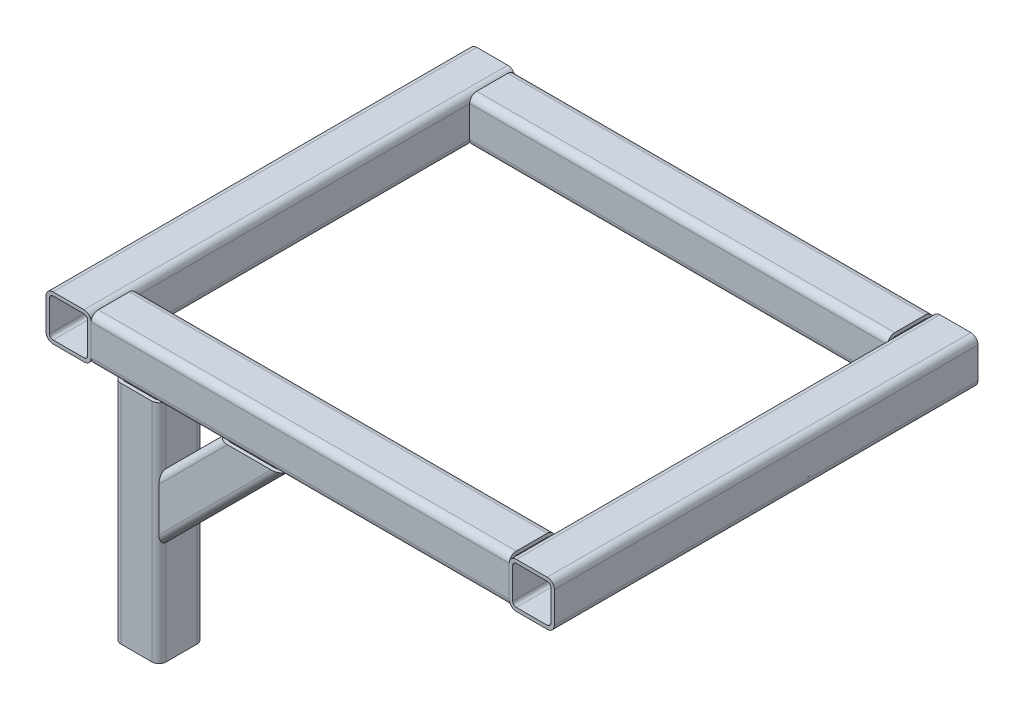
ISO-10303-21;
HEADER;
FILE_DESCRIPTION(('STEP AP214'),'2;1');
FILE_NAME('part.step','',(''),(''),'','','');
FILE_SCHEMA(('AUTOMOTIVE_DESIGN { 1 0 10303 214 1 1 1 1 }'));
ENDSEC;
DATA;
#1=APPLICATION_CONTEXT('core data for automotive mechanical design processes');
#2=APPLICATION_PROTOCOL_DEFINITION('international standard','automotive_design',2000,#1);
#3=PRODUCT_CONTEXT('',#1,'mechanical');
#4=PRODUCT('Part','Part','',(#3));
#5=PRODUCT_RELATED_PRODUCT_CATEGORY('part','',(#4));
#6=PRODUCT_DEFINITION_FORMATION('','',#4);
#7=PRODUCT_DEFINITION_CONTEXT('part definition',#1,'design');
#8=PRODUCT_DEFINITION('design','',#6,#7);
#9=PRODUCT_DEFINITION_SHAPE('','',#8);
#10=(LENGTH_UNIT() NAMED_UNIT(*) SI_UNIT(.MILLI.,.METRE.));
#11=(NAMED_UNIT(*) PLANE_ANGLE_UNIT() SI_UNIT($,.RADIAN.));
#12=(NAMED_UNIT(*) SI_UNIT($,.STERADIAN.) SOLID_ANGLE_UNIT());
#13=UNCERTAINTY_MEASURE_WITH_UNIT(LENGTH_MEASURE(1.E-05),#10,'distance_accuracy_value','');
#14=(GEOMETRIC_REPRESENTATION_CONTEXT(3) GLOBAL_UNCERTAINTY_ASSIGNED_CONTEXT((#13)) GLOBAL_UNIT_ASSIGNED_CONTEXT((#10,
#11,#12)) REPRESENTATION_CONTEXT('',''));
#15=CARTESIAN_POINT('',(0.,0.,0.));
#16=DIRECTION('',(0.,0.,1.));
#17=DIRECTION('',(1.,0.,0.));
#18=AXIS2_PLACEMENT_3D('',#15,#16,#17);
#19=CARTESIAN_POINT('',(437.4,487.4,375.));
#20=DIRECTION('',(0.,0.,-1.));
#21=DIRECTION('',(-1.,0.,0.));
#22=AXIS2_PLACEMENT_3D('',#19,#20,#21);
#23=CYLINDRICAL_SURFACE('',#22,12.6);
#24=CARTESIAN_POINT('',(437.4,487.4,-375.));
#25=DIRECTION('',(0.,0.,-1.));
#26=DIRECTION('',(-1.,0.,0.));
#27=AXIS2_PLACEMENT_3D('',#24,#25,#26);
#28=CIRCLE('',#27,12.6);
#29=CARTESIAN_POINT('',(437.4,500.,-375.));
#30=VERTEX_POINT('',#29);
#31=CARTESIAN_POINT('',(450.,487.4,-375.));
#32=VERTEX_POINT('',#31);
#33=EDGE_CURVE('E221',#30,#32,#28,.T.);
#34=ORIENTED_EDGE('',*,*,#33,.F.);
#35=DIRECTION('',(0.,0.,-1.));
#36=VECTOR('',#35,1.);
#37=CARTESIAN_POINT('',(437.4,500.,375.));
#38=LINE('',#37,#36);
#39=CARTESIAN_POINT('',(437.4,500.,375.));
#40=VERTEX_POINT('',#39);
#41=EDGE_CURVE('E303',#40,#30,#38,.T.);
#42=ORIENTED_EDGE('',*,*,#41,.F.);
#43=CARTESIAN_POINT('',(437.4,487.4,375.));
#44=DIRECTION('',(0.,0.,1.));
#45=DIRECTION('',(1.,0.,0.));
#46=AXIS2_PLACEMENT_3D('',#43,#44,#45);
#47=CIRCLE('',#46,12.6);
#48=CARTESIAN_POINT('',(450.,487.4,375.));
#49=VERTEX_POINT('',#48);
#50=EDGE_CURVE('E214',#49,#40,#47,.T.);
#51=ORIENTED_EDGE('',*,*,#50,.F.);
#52=DIRECTION('',(0.,0.,-1.));
#53=VECTOR('',#52,1.);
#54=CARTESIAN_POINT('',(450.,487.4,375.));
#55=LINE('',#54,#53);
#56=EDGE_CURVE('E83',#49,#32,#55,.T.);
#57=ORIENTED_EDGE('',*,*,#56,.T.);
#58=EDGE_LOOP('',(#34,#42,#51,#57));
#59=FACE_BOUND('',#58,.T.);
#60=ADVANCED_FACE('F77',(#59),#23,.T.);
#61=CARTESIAN_POINT('',(437.4,500.,375.));
#62=DIRECTION('',(0.,-1.,0.));
#63=DIRECTION('',(1.,0.,0.));
#64=AXIS2_PLACEMENT_3D('',#61,#62,#63);
#65=PLANE('',#64);
#66=DIRECTION('',(1.,0.,0.));
#67=VECTOR('',#66,1.);
#68=CARTESIAN_POINT('',(437.4,500.,-375.));
#69=LINE('',#68,#67);
#70=CARTESIAN_POINT('',(382.6,500.,-375.));
#71=VERTEX_POINT('',#70);
#72=EDGE_CURVE('E222',#71,#30,#69,.T.);
#73=ORIENTED_EDGE('',*,*,#72,.F.);
#74=DIRECTION('',(0.,0.,-1.));
#75=VECTOR('',#74,1.);
#76=CARTESIAN_POINT('',(382.6,500.,375.));
#77=LINE('',#76,#75);
#78=CARTESIAN_POINT('',(382.6,500.,375.));
#79=VERTEX_POINT('',#78);
#80=EDGE_CURVE('E302',#79,#71,#77,.T.);
#81=ORIENTED_EDGE('',*,*,#80,.F.);
#82=DIRECTION('',(-1.,0.,0.));
#83=VECTOR('',#82,1.);
#84=CARTESIAN_POINT('',(437.4,500.,375.));
#85=LINE('',#84,#83);
#86=EDGE_CURVE('E319',#40,#79,#85,.T.);
#87=ORIENTED_EDGE('',*,*,#86,.F.);
#88=ORIENTED_EDGE('',*,*,#41,.T.);
#89=EDGE_LOOP('',(#73,#81,#87,#88));
#90=FACE_BOUND('',#89,.T.);
#91=ADVANCED_FACE('F313',(#90),#65,.F.);
#92=CARTESIAN_POINT('',(382.6,487.4,375.));
#93=DIRECTION('',(0.,0.,-1.));
#94=DIRECTION('',(-1.,0.,0.));
#95=AXIS2_PLACEMENT_3D('',#92,#93,#94);
#96=CYLINDRICAL_SURFACE('',#95,12.6);
#97=CARTESIAN_POINT('',(382.6,487.4,-375.));
#98=DIRECTION('',(0.,0.,-1.));
#99=DIRECTION('',(-1.,0.,0.));
#100=AXIS2_PLACEMENT_3D('',#97,#98,#99);
#101=CIRCLE('',#100,12.6);
#102=CARTESIAN_POINT('',(370.,487.4,-375.));
#103=VERTEX_POINT('',#102);
#104=EDGE_CURVE('E13',#103,#71,#101,.T.);
#105=ORIENTED_EDGE('',*,*,#104,.F.);
#106=DIRECTION('',(0.,0.,-1.));
#107=VECTOR('',#106,1.);
#108=CARTESIAN_POINT('',(370.,487.4,375.));
#109=LINE('',#108,#107);
#110=CARTESIAN_POINT('',(370.,487.4,375.));
#111=VERTEX_POINT('',#110);
#112=EDGE_CURVE('E298',#111,#103,#109,.T.);
#113=ORIENTED_EDGE('',*,*,#112,.F.);
#114=CARTESIAN_POINT('',(382.6,487.4,375.));
#115=DIRECTION('',(0.,0.,1.));
#116=DIRECTION('',(1.,0.,0.));
#117=AXIS2_PLACEMENT_3D('',#114,#115,#116);
#118=CIRCLE('',#117,12.6);
#119=EDGE_CURVE('E320',#79,#111,#118,.T.);
#120=ORIENTED_EDGE('',*,*,#119,.F.);
#121=ORIENTED_EDGE('',*,*,#80,.T.);
#122=EDGE_LOOP('',(#105,#113,#120,#121));
#123=FACE_BOUND('',#122,.T.);
#124=ADVANCED_FACE('F314',(#123),#96,.T.);
#125=CARTESIAN_POINT('',(370.,432.6,375.));
#126=DIRECTION('',(1.,0.,0.));
#127=DIRECTION('',(0.,1.,0.));
#128=AXIS2_PLACEMENT_3D('',#125,#126,#127);
#129=PLANE('',#128);
#130=DIRECTION('',(0.,1.,0.));
#131=VECTOR('',#130,1.);
#132=CARTESIAN_POINT('',(370.,432.6,-375.));
#133=LINE('',#132,#131);
#134=CARTESIAN_POINT('',(370.,432.6,-375.));
#135=VERTEX_POINT('',#134);
#136=EDGE_CURVE('E89',#135,#103,#133,.T.);
#137=ORIENTED_EDGE('',*,*,#136,.F.);
#138=DIRECTION('',(0.,0.,-1.));
#139=VECTOR('',#138,1.);
#140=CARTESIAN_POINT('',(370.,432.6,375.));
#141=LINE('',#140,#139);
#142=CARTESIAN_POINT('',(370.,432.6,375.));
#143=VERTEX_POINT('',#142);
#144=EDGE_CURVE('E299',#143,#135,#141,.T.);
#145=ORIENTED_EDGE('',*,*,#144,.F.);
#146=DIRECTION('',(0.,-1.,0.));
#147=VECTOR('',#146,1.);
#148=CARTESIAN_POINT('',(370.,432.6,375.));
#149=LINE('',#148,#147);
#150=EDGE_CURVE('E317',#111,#143,#149,.T.);
#151=ORIENTED_EDGE('',*,*,#150,.F.);
#152=ORIENTED_EDGE('',*,*,#112,.T.);
#153=EDGE_LOOP('',(#137,#145,#151,#152));
#154=FACE_BOUND('',#153,.T.);
#155=ADVANCED_FACE('F329',(#154),#129,.F.);
#156=CARTESIAN_POINT('',(382.6,432.6,375.));
#157=DIRECTION('',(0.,0.,-1.));
#158=DIRECTION('',(-1.,0.,0.));
#159=AXIS2_PLACEMENT_3D('',#156,#157,#158);
#160=CYLINDRICAL_SURFACE('',#159,12.6);
#161=CARTESIAN_POINT('',(382.6,432.6,-375.));
#162=DIRECTION('',(0.,0.,-1.));
#163=DIRECTION('',(-1.,0.,0.));
#164=AXIS2_PLACEMENT_3D('',#161,#162,#163);
#165=CIRCLE('',#164,12.6);
#166=CARTESIAN_POINT('',(382.6,420.,-375.));
#167=VERTEX_POINT('',#166);
#168=EDGE_CURVE('E239',#167,#135,#165,.T.);
#169=ORIENTED_EDGE('',*,*,#168,.F.);
#170=DIRECTION('',(0.,0.,-1.));
#171=VECTOR('',#170,1.);
#172=CARTESIAN_POINT('',(382.6,420.,375.));
#173=LINE('',#172,#171);
#174=CARTESIAN_POINT('',(382.6,420.,375.));
#175=VERTEX_POINT('',#174);
#176=EDGE_CURVE('E291',#175,#167,#173,.T.);
#177=ORIENTED_EDGE('',*,*,#176,.F.);
#178=CARTESIAN_POINT('',(382.6,432.6,375.));
#179=DIRECTION('',(0.,0.,1.));
#180=DIRECTION('',(1.,0.,0.));
#181=AXIS2_PLACEMENT_3D('',#178,#179,#180);
#182=CIRCLE('',#181,12.6);
#183=EDGE_CURVE('E229',#143,#175,#182,.T.);
#184=ORIENTED_EDGE('',*,*,#183,.F.);
#185=ORIENTED_EDGE('',*,*,#144,.T.);
#186=EDGE_LOOP('',(#169,#177,#184,#185));
#187=FACE_BOUND('',#186,.T.);
#188=ADVANCED_FACE('F327',(#187),#160,.T.);
#189=CARTESIAN_POINT('',(382.6,420.,375.));
#190=DIRECTION('',(0.,1.,0.));
#191=DIRECTION('',(-1.,0.,0.));
#192=AXIS2_PLACEMENT_3D('',#189,#190,#191);
#193=PLANE('',#192);
#194=DIRECTION('',(-1.,0.,0.));
#195=VECTOR('',#194,1.);
#196=CARTESIAN_POINT('',(382.6,420.,-375.));
#197=LINE('',#196,#195);
#198=CARTESIAN_POINT('',(437.4,420.,-375.));
#199=VERTEX_POINT('',#198);
#200=EDGE_CURVE('E241',#199,#167,#197,.T.);
#201=ORIENTED_EDGE('',*,*,#200,.F.);
#202=DIRECTION('',(0.,0.,-1.));
#203=VECTOR('',#202,1.);
#204=CARTESIAN_POINT('',(437.4,420.,375.));
#205=LINE('',#204,#203);
#206=CARTESIAN_POINT('',(437.4,420.,375.));
#207=VERTEX_POINT('',#206);
#208=EDGE_CURVE('E292',#207,#199,#205,.T.);
#209=ORIENTED_EDGE('',*,*,#208,.F.);
#210=DIRECTION('',(1.,0.,0.));
#211=VECTOR('',#210,1.);
#212=CARTESIAN_POINT('',(382.6,420.,375.));
#213=LINE('',#212,#211);
#214=EDGE_CURVE('E219',#175,#207,#213,.T.);
#215=ORIENTED_EDGE('',*,*,#214,.F.);
#216=ORIENTED_EDGE('',*,*,#176,.T.);
#217=EDGE_LOOP('',(#201,#209,#215,#216));
#218=FACE_BOUND('',#217,.T.);
#219=ADVANCED_FACE('F335',(#218),#193,.F.);
#220=CARTESIAN_POINT('',(437.4,432.6,375.));
#221=DIRECTION('',(0.,0.,-1.));
#222=DIRECTION('',(-1.,0.,0.));
#223=AXIS2_PLACEMENT_3D('',#220,#221,#222);
#224=CYLINDRICAL_SURFACE('',#223,12.6);
#225=CARTESIAN_POINT('',(437.4,432.6,-375.));
#226=DIRECTION('',(0.,0.,-1.));
#227=DIRECTION('',(-1.,0.,0.));
#228=AXIS2_PLACEMENT_3D('',#225,#226,#227);
#229=CIRCLE('',#228,12.6);
#230=CARTESIAN_POINT('',(450.,432.6,-375.));
#231=VERTEX_POINT('',#230);
#232=EDGE_CURVE('E201',#231,#199,#229,.T.);
#233=ORIENTED_EDGE('',*,*,#232,.F.);
#234=DIRECTION('',(0.,0.,-1.));
#235=VECTOR('',#234,1.);
#236=CARTESIAN_POINT('',(450.,432.6,375.));
#237=LINE('',#236,#235);
#238=CARTESIAN_POINT('',(450.,432.6,375.));
#239=VERTEX_POINT('',#238);
#240=EDGE_CURVE('E195',#239,#231,#237,.T.);
#241=ORIENTED_EDGE('',*,*,#240,.F.);
#242=CARTESIAN_POINT('',(437.4,432.6,375.));
#243=DIRECTION('',(0.,0.,1.));
#244=DIRECTION('',(1.,0.,0.));
#245=AXIS2_PLACEMENT_3D('',#242,#243,#244);
#246=CIRCLE('',#245,12.6);
#247=EDGE_CURVE('E199',#207,#239,#246,.T.);
#248=ORIENTED_EDGE('',*,*,#247,.F.);
#249=ORIENTED_EDGE('',*,*,#208,.T.);
#250=EDGE_LOOP('',(#233,#241,#248,#249));
#251=FACE_BOUND('',#250,.T.);
#252=ADVANCED_FACE('F197',(#251),#224,.T.);
#253=CARTESIAN_POINT('',(382.6,487.4,375.));
#254=DIRECTION('',(0.,0.,-1.));
#255=DIRECTION('',(-1.,0.,0.));
#256=AXIS2_PLACEMENT_3D('',#253,#254,#255);
#257=CYLINDRICAL_SURFACE('',#256,6.3);
#258=DIRECTION('',(0.,0.,-1.));
#259=VECTOR('',#258,1.);
#260=CARTESIAN_POINT('',(376.3,487.4,375.));
#261=LINE('',#260,#259);
#262=CARTESIAN_POINT('',(376.3,487.4,375.));
#263=VERTEX_POINT('',#262);
#264=CARTESIAN_POINT('',(376.3,487.4,-375.));
#265=VERTEX_POINT('',#264);
#266=EDGE_CURVE('E249',#263,#265,#261,.T.);
#267=ORIENTED_EDGE('',*,*,#266,.T.);
#268=CARTESIAN_POINT('',(382.6,487.4,-375.));
#269=DIRECTION('',(0.,0.,-1.));
#270=DIRECTION('',(-1.,0.,0.));
#271=AXIS2_PLACEMENT_3D('',#268,#269,#270);
#272=CIRCLE('',#271,6.3);
#273=CARTESIAN_POINT('',(382.599999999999,493.7,-375.));
#274=VERTEX_POINT('',#273);
#275=EDGE_CURVE('E127',#265,#274,#272,.T.);
#276=ORIENTED_EDGE('',*,*,#275,.T.);
#277=DIRECTION('',(0.,0.,-1.));
#278=VECTOR('',#277,1.);
#279=CARTESIAN_POINT('',(382.6,493.7,375.));
#280=LINE('',#279,#278);
#281=CARTESIAN_POINT('',(382.6,493.7,375.));
#282=VERTEX_POINT('',#281);
#283=EDGE_CURVE('E253',#282,#274,#280,.T.);
#284=ORIENTED_EDGE('',*,*,#283,.F.);
#285=CARTESIAN_POINT('',(382.6,487.4,375.));
#286=DIRECTION('',(0.,0.,1.));
#287=DIRECTION('',(1.,0.,0.));
#288=AXIS2_PLACEMENT_3D('',#285,#286,#287);
#289=CIRCLE('',#288,6.3);
#290=EDGE_CURVE('E247',#282,#263,#289,.T.);
#291=ORIENTED_EDGE('',*,*,#290,.T.);
#292=EDGE_LOOP('',(#267,#276,#284,#291));
#293=FACE_BOUND('',#292,.T.);
#294=ADVANCED_FACE('F338',(#293),#257,.F.);
#295=CARTESIAN_POINT('',(437.4,493.7,375.));
#296=DIRECTION('',(0.,-1.,0.));
#297=DIRECTION('',(1.,0.,0.));
#298=AXIS2_PLACEMENT_3D('',#295,#296,#297);
#299=PLANE('',#298);
#300=ORIENTED_EDGE('',*,*,#283,.T.);
#301=DIRECTION('',(1.,0.,0.));
#302=VECTOR('',#301,1.);
#303=CARTESIAN_POINT('',(437.4,493.7,-375.));
#304=LINE('',#303,#302);
#305=CARTESIAN_POINT('',(437.4,493.7,-375.));
#306=VERTEX_POINT('',#305);
#307=EDGE_CURVE('E97',#274,#306,#304,.T.);
#308=ORIENTED_EDGE('',*,*,#307,.T.);
#309=DIRECTION('',(0.,0.,-1.));
#310=VECTOR('',#309,1.);
#311=CARTESIAN_POINT('',(437.4,493.7,375.));
#312=LINE('',#311,#310);
#313=CARTESIAN_POINT('',(437.4,493.7,375.));
#314=VERTEX_POINT('',#313);
#315=EDGE_CURVE('E258',#314,#306,#312,.T.);
#316=ORIENTED_EDGE('',*,*,#315,.F.);
#317=DIRECTION('',(-1.,0.,0.));
#318=VECTOR('',#317,1.);
#319=CARTESIAN_POINT('',(437.4,493.7,375.));
#320=LINE('',#319,#318);
#321=EDGE_CURVE('E250',#314,#282,#320,.T.);
#322=ORIENTED_EDGE('',*,*,#321,.T.);
#323=EDGE_LOOP('',(#300,#308,#316,#322));
#324=FACE_BOUND('',#323,.T.);
#325=ADVANCED_FACE('F379',(#324),#299,.T.);
#326=CARTESIAN_POINT('',(437.4,487.4,375.));
#327=DIRECTION('',(0.,0.,-1.));
#328=DIRECTION('',(-1.,0.,0.));
#329=AXIS2_PLACEMENT_3D('',#326,#327,#328);
#330=CYLINDRICAL_SURFACE('',#329,6.29999999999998);
#331=ORIENTED_EDGE('',*,*,#315,.T.);
#332=CARTESIAN_POINT('',(437.4,487.4,-375.));
#333=DIRECTION('',(0.,0.,-1.));
#334=DIRECTION('',(-1.,0.,0.));
#335=AXIS2_PLACEMENT_3D('',#332,#333,#334);
#336=CIRCLE('',#335,6.29999999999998);
#337=CARTESIAN_POINT('',(443.7,487.4,-375.));
#338=VERTEX_POINT('',#337);
#339=EDGE_CURVE('E252',#306,#338,#336,.T.);
#340=ORIENTED_EDGE('',*,*,#339,.T.);
#341=DIRECTION('',(0.,0.,-1.));
#342=VECTOR('',#341,1.);
#343=CARTESIAN_POINT('',(443.7,487.4,375.));
#344=LINE('',#343,#342);
#345=CARTESIAN_POINT('',(443.7,487.4,375.));
#346=VERTEX_POINT('',#345);
#347=EDGE_CURVE('E261',#346,#338,#344,.T.);
#348=ORIENTED_EDGE('',*,*,#347,.F.);
#349=CARTESIAN_POINT('',(437.4,487.4,375.));
#350=DIRECTION('',(0.,0.,1.));
#351=DIRECTION('',(1.,0.,0.));
#352=AXIS2_PLACEMENT_3D('',#349,#350,#351);
#353=CIRCLE('',#352,6.29999999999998);
#354=EDGE_CURVE('E254',#346,#314,#353,.T.);
#355=ORIENTED_EDGE('',*,*,#354,.T.);
#356=EDGE_LOOP('',(#331,#340,#348,#355));
#357=FACE_BOUND('',#356,.T.);
#358=ADVANCED_FACE('F388',(#357),#330,.F.);
#359=CARTESIAN_POINT('',(443.7,487.4,375.));
#360=DIRECTION('',(-1.,0.,0.));
#361=DIRECTION('',(0.,-1.,0.));
#362=AXIS2_PLACEMENT_3D('',#359,#360,#361);
#363=PLANE('',#362);
#364=ORIENTED_EDGE('',*,*,#347,.T.);
#365=DIRECTION('',(0.,-1.,0.));
#366=VECTOR('',#365,1.);
#367=CARTESIAN_POINT('',(443.7,487.4,-375.));
#368=LINE('',#367,#366);
#369=CARTESIAN_POINT('',(443.7,432.6,-375.));
#370=VERTEX_POINT('',#369);
#371=EDGE_CURVE('E260',#338,#370,#368,.T.);
#372=ORIENTED_EDGE('',*,*,#371,.T.);
#373=DIRECTION('',(0.,0.,-1.));
#374=VECTOR('',#373,1.);
#375=CARTESIAN_POINT('',(443.7,432.6,375.));
#376=LINE('',#375,#374);
#377=CARTESIAN_POINT('',(443.7,432.6,375.));
#378=VERTEX_POINT('',#377);
#379=EDGE_CURVE('E266',#378,#370,#376,.T.);
#380=ORIENTED_EDGE('',*,*,#379,.F.);
#381=DIRECTION('',(0.,1.,0.));
#382=VECTOR('',#381,1.);
#383=CARTESIAN_POINT('',(443.7,487.4,375.));
#384=LINE('',#383,#382);
#385=EDGE_CURVE('E257',#378,#346,#384,.T.);
#386=ORIENTED_EDGE('',*,*,#385,.T.);
#387=EDGE_LOOP('',(#364,#372,#380,#386));
#388=FACE_BOUND('',#387,.T.);
#389=ADVANCED_FACE('F399',(#388),#363,.T.);
#390=CARTESIAN_POINT('',(437.4,432.6,375.));
#391=DIRECTION('',(0.,0.,-1.));
#392=DIRECTION('',(-1.,0.,0.));
#393=AXIS2_PLACEMENT_3D('',#390,#391,#392);
#394=CYLINDRICAL_SURFACE('',#393,6.30000000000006);
#395=ORIENTED_EDGE('',*,*,#379,.T.);
#396=CARTESIAN_POINT('',(437.4,432.6,-375.));
#397=DIRECTION('',(0.,0.,-1.));
#398=DIRECTION('',(-1.,0.,0.));
#399=AXIS2_PLACEMENT_3D('',#396,#397,#398);
#400=CIRCLE('',#399,6.30000000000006);
#401=CARTESIAN_POINT('',(437.400000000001,426.3,-375.));
#402=VERTEX_POINT('',#401);
#403=EDGE_CURVE('E265',#370,#402,#400,.T.);
#404=ORIENTED_EDGE('',*,*,#403,.T.);
#405=DIRECTION('',(0.,0.,-1.));
#406=VECTOR('',#405,1.);
#407=CARTESIAN_POINT('',(437.4,426.3,375.));
#408=LINE('',#407,#406);
#409=CARTESIAN_POINT('',(437.400000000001,426.3,375.));
#410=VERTEX_POINT('',#409);
#411=EDGE_CURVE('E271',#410,#402,#408,.T.);
#412=ORIENTED_EDGE('',*,*,#411,.F.);
#413=CARTESIAN_POINT('',(437.4,432.6,375.));
#414=DIRECTION('',(0.,0.,1.));
#415=DIRECTION('',(1.,0.,0.));
#416=AXIS2_PLACEMENT_3D('',#413,#414,#415);
#417=CIRCLE('',#416,6.30000000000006);
#418=EDGE_CURVE('E264',#410,#378,#417,.T.);
#419=ORIENTED_EDGE('',*,*,#418,.T.);
#420=EDGE_LOOP('',(#395,#404,#412,#419));
#421=FACE_BOUND('',#420,.T.);
#422=ADVANCED_FACE('F407',(#421),#394,.F.);
#423=CARTESIAN_POINT('',(382.6,426.3,375.));
#424=DIRECTION('',(0.,1.,0.));
#425=DIRECTION('',(-1.,0.,0.));
#426=AXIS2_PLACEMENT_3D('',#423,#424,#425);
#427=PLANE('',#426);
#428=ORIENTED_EDGE('',*,*,#411,.T.);
#429=DIRECTION('',(-1.,0.,0.));
#430=VECTOR('',#429,1.);
#431=CARTESIAN_POINT('',(382.6,426.3,-375.));
#432=LINE('',#431,#430);
#433=CARTESIAN_POINT('',(382.6,426.3,-375.));
#434=VERTEX_POINT('',#433);
#435=EDGE_CURVE('E270',#402,#434,#432,.T.);
#436=ORIENTED_EDGE('',*,*,#435,.T.);
#437=DIRECTION('',(0.,0.,-1.));
#438=VECTOR('',#437,1.);
#439=CARTESIAN_POINT('',(382.6,426.3,375.));
#440=LINE('',#439,#438);
#441=CARTESIAN_POINT('',(382.6,426.3,375.));
#442=VERTEX_POINT('',#441);
#443=EDGE_CURVE('E274',#442,#434,#440,.T.);
#444=ORIENTED_EDGE('',*,*,#443,.F.);
#445=DIRECTION('',(1.,0.,0.));
#446=VECTOR('',#445,1.);
#447=CARTESIAN_POINT('',(382.6,426.3,375.));
#448=LINE('',#447,#446);
#449=EDGE_CURVE('E269',#442,#410,#448,.T.);
#450=ORIENTED_EDGE('',*,*,#449,.T.);
#451=EDGE_LOOP('',(#428,#436,#444,#450));
#452=FACE_BOUND('',#451,.T.);
#453=ADVANCED_FACE('F419',(#452),#427,.T.);
#454=CARTESIAN_POINT('',(382.6,432.6,375.));
#455=DIRECTION('',(0.,0.,-1.));
#456=DIRECTION('',(-1.,0.,0.));
#457=AXIS2_PLACEMENT_3D('',#454,#455,#456);
#458=CYLINDRICAL_SURFACE('',#457,6.3);
#459=ORIENTED_EDGE('',*,*,#443,.T.);
#460=CARTESIAN_POINT('',(382.6,432.6,-375.));
#461=DIRECTION('',(0.,0.,-1.));
#462=DIRECTION('',(-1.,0.,0.));
#463=AXIS2_PLACEMENT_3D('',#460,#461,#462);
#464=CIRCLE('',#463,6.3);
#465=CARTESIAN_POINT('',(376.3,432.6,-375.));
#466=VERTEX_POINT('',#465);
#467=EDGE_CURVE('E275',#434,#466,#464,.T.);
#468=ORIENTED_EDGE('',*,*,#467,.T.);
#469=DIRECTION('',(0.,0.,-1.));
#470=VECTOR('',#469,1.);
#471=CARTESIAN_POINT('',(376.3,432.6,375.));
#472=LINE('',#471,#470);
#473=CARTESIAN_POINT('',(376.3,432.6,375.));
#474=VERTEX_POINT('',#473);
#475=EDGE_CURVE('E231',#474,#466,#472,.T.);
#476=ORIENTED_EDGE('',*,*,#475,.F.);
#477=CARTESIAN_POINT('',(382.6,432.6,375.));
#478=DIRECTION('',(0.,0.,1.));
#479=DIRECTION('',(1.,0.,0.));
#480=AXIS2_PLACEMENT_3D('',#477,#478,#479);
#481=CIRCLE('',#480,6.3);
#482=EDGE_CURVE('E273',#474,#442,#481,.T.);
#483=ORIENTED_EDGE('',*,*,#482,.T.);
#484=EDGE_LOOP('',(#459,#468,#476,#483));
#485=FACE_BOUND('',#484,.T.);
#486=ADVANCED_FACE('F429',(#485),#458,.F.);
#487=CARTESIAN_POINT('',(376.3,432.6,375.));
#488=DIRECTION('',(1.,0.,0.));
#489=DIRECTION('',(0.,1.,0.));
#490=AXIS2_PLACEMENT_3D('',#487,#488,#489);
#491=PLANE('',#490);
#492=ORIENTED_EDGE('',*,*,#475,.T.);
#493=DIRECTION('',(0.,1.,0.));
#494=VECTOR('',#493,1.);
#495=CARTESIAN_POINT('',(376.3,432.6,-375.));
#496=LINE('',#495,#494);
#497=EDGE_CURVE('E123',#466,#265,#496,.T.);
#498=ORIENTED_EDGE('',*,*,#497,.T.);
#499=ORIENTED_EDGE('',*,*,#266,.F.);
#500=DIRECTION('',(0.,-1.,0.));
#501=VECTOR('',#500,1.);
#502=CARTESIAN_POINT('',(376.3,432.6,375.));
#503=LINE('',#502,#501);
#504=EDGE_CURVE('E208',#263,#474,#503,.T.);
#505=ORIENTED_EDGE('',*,*,#504,.T.);
#506=EDGE_LOOP('',(#492,#498,#499,#505));
#507=FACE_BOUND('',#506,.T.);
#508=ADVANCED_FACE('F439',(#507),#491,.T.);
#509=CARTESIAN_POINT('',(450.,487.4,375.));
#510=DIRECTION('',(-1.,0.,0.));
#511=DIRECTION('',(0.,-1.,0.));
#512=AXIS2_PLACEMENT_3D('',#509,#510,#511);
#513=PLANE('',#512);
#514=DIRECTION('',(0.,-1.,0.));
#515=VECTOR('',#514,1.);
#516=CARTESIAN_POINT('',(450.,487.4,-375.));
#517=LINE('',#516,#515);
#518=EDGE_CURVE('E234',#32,#231,#517,.T.);
#519=ORIENTED_EDGE('',*,*,#518,.F.);
#520=ORIENTED_EDGE('',*,*,#56,.F.);
#521=DIRECTION('',(0.,1.,0.));
#522=VECTOR('',#521,1.);
#523=CARTESIAN_POINT('',(450.,487.4,375.));
#524=LINE('',#523,#522);
#525=EDGE_CURVE('E210',#239,#49,#524,.T.);
#526=ORIENTED_EDGE('',*,*,#525,.F.);
#527=ORIENTED_EDGE('',*,*,#240,.T.);
#528=EDGE_LOOP('',(#519,#520,#526,#527));
#529=FACE_BOUND('',#528,.T.);
#530=ADVANCED_FACE('F211',(#529),#513,.F.);
#531=CARTESIAN_POINT('',(450.,420.,375.));
#532=DIRECTION('',(0.,0.,1.));
#533=DIRECTION('',(1.,0.,0.));
#534=AXIS2_PLACEMENT_3D('',#531,#532,#533);
#535=PLANE('',#534);
#536=ORIENTED_EDGE('',*,*,#290,.F.);
#537=ORIENTED_EDGE('',*,*,#321,.F.);
#538=ORIENTED_EDGE('',*,*,#354,.F.);
#539=ORIENTED_EDGE('',*,*,#385,.F.);
#540=ORIENTED_EDGE('',*,*,#418,.F.);
#541=ORIENTED_EDGE('',*,*,#449,.F.);
#542=ORIENTED_EDGE('',*,*,#482,.F.);
#543=ORIENTED_EDGE('',*,*,#504,.F.);
#544=EDGE_LOOP('',(#536,#537,#538,#539,#540,#541,#542,#543));
#545=FACE_BOUND('',#544,.T.);
#546=ORIENTED_EDGE('',*,*,#525,.T.);
#547=ORIENTED_EDGE('',*,*,#50,.T.);
#548=ORIENTED_EDGE('',*,*,#86,.T.);
#549=ORIENTED_EDGE('',*,*,#119,.T.);
#550=ORIENTED_EDGE('',*,*,#150,.T.);
#551=ORIENTED_EDGE('',*,*,#183,.T.);
#552=ORIENTED_EDGE('',*,*,#214,.T.);
#553=ORIENTED_EDGE('',*,*,#247,.T.);
#554=EDGE_LOOP('',(#546,#547,#548,#549,#550,#551,#552,#553));
#555=FACE_BOUND('',#554,.T.);
#556=ADVANCED_FACE('F217',(#545,#555),#535,.T.);
#557=CARTESIAN_POINT('',(450.,500.,-375.));
#558=DIRECTION('',(0.,0.,-1.));
#559=DIRECTION('',(-1.,0.,0.));
#560=AXIS2_PLACEMENT_3D('',#557,#558,#559);
#561=PLANE('',#560);
#562=ORIENTED_EDGE('',*,*,#275,.F.);
#563=ORIENTED_EDGE('',*,*,#497,.F.);
#564=ORIENTED_EDGE('',*,*,#467,.F.);
#565=ORIENTED_EDGE('',*,*,#435,.F.);
#566=ORIENTED_EDGE('',*,*,#403,.F.);
#567=ORIENTED_EDGE('',*,*,#371,.F.);
#568=ORIENTED_EDGE('',*,*,#339,.F.);
#569=ORIENTED_EDGE('',*,*,#307,.F.);
#570=EDGE_LOOP('',(#562,#563,#564,#565,#566,#567,#568,#569));
#571=FACE_BOUND('',#570,.T.);
#572=ORIENTED_EDGE('',*,*,#72,.T.);
#573=ORIENTED_EDGE('',*,*,#33,.T.);
#574=ORIENTED_EDGE('',*,*,#518,.T.);
#575=ORIENTED_EDGE('',*,*,#232,.T.);
#576=ORIENTED_EDGE('',*,*,#200,.T.);
#577=ORIENTED_EDGE('',*,*,#168,.T.);
#578=ORIENTED_EDGE('',*,*,#136,.T.);
#579=ORIENTED_EDGE('',*,*,#104,.T.);
#580=EDGE_LOOP('',(#572,#573,#574,#575,#576,#577,#578,#579));
#581=FACE_BOUND('',#580,.T.);
#582=ADVANCED_FACE('F82',(#571,#581),#561,.T.);
#583=CLOSED_SHELL('',(#60,#91,#124,#155,#188,#219,#252,#294,#325,#358,#389,#422,#453,#486,#508,
#530,#556,#582));
#584=MANIFOLD_SOLID_BREP('B2',#583);
#585=CARTESIAN_POINT('',(450.,487.4,-307.6));
#586=DIRECTION('',(-1.,0.,0.));
#587=DIRECTION('',(0.,0.,1.));
#588=AXIS2_PLACEMENT_3D('',#585,#586,#587);
#589=CYLINDRICAL_SURFACE('',#588,6.3);
#590=DIRECTION('',(-1.,0.,0.));
#591=VECTOR('',#590,1.);
#592=CARTESIAN_POINT('',(450.,493.7,-307.6));
#593=LINE('',#592,#591);
#594=CARTESIAN_POINT('',(370.,493.7,-307.6));
#595=VERTEX_POINT('',#594);
#596=CARTESIAN_POINT('',(-370.,493.7,-307.599999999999));
#597=VERTEX_POINT('',#596);
#598=EDGE_CURVE('E710',#595,#597,#593,.T.);
#599=ORIENTED_EDGE('',*,*,#598,.F.);
#600=CARTESIAN_POINT('',(370.,487.4,-307.6));
#601=DIRECTION('',(1.,0.,0.));
#602=DIRECTION('',(0.,1.,0.));
#603=AXIS2_PLACEMENT_3D('',#600,#601,#602);
#604=CIRCLE('',#603,6.3);
#605=CARTESIAN_POINT('',(370.,487.4,-301.3));
#606=VERTEX_POINT('',#605);
#607=EDGE_CURVE('E785',#595,#606,#604,.T.);
#608=ORIENTED_EDGE('',*,*,#607,.T.);
#609=DIRECTION('',(-1.,0.,0.));
#610=VECTOR('',#609,1.);
#611=CARTESIAN_POINT('',(450.,487.4,-301.3));
#612=LINE('',#611,#610);
#613=CARTESIAN_POINT('',(-370.,487.4,-301.3));
#614=VERTEX_POINT('',#613);
#615=EDGE_CURVE('E692',#606,#614,#612,.T.);
#616=ORIENTED_EDGE('',*,*,#615,.T.);
#617=CARTESIAN_POINT('',(-370.,487.4,-307.6));
#618=DIRECTION('',(-1.,0.,0.));
#619=DIRECTION('',(0.,-1.,0.));
#620=AXIS2_PLACEMENT_3D('',#617,#618,#619);
#621=CIRCLE('',#620,6.3);
#622=EDGE_CURVE('E760',#614,#597,#621,.T.);
#623=ORIENTED_EDGE('',*,*,#622,.T.);
#624=EDGE_LOOP('',(#599,#608,#616,#623));
#625=FACE_BOUND('',#624,.T.);
#626=ADVANCED_FACE('F555',(#625),#589,.F.);
#627=CARTESIAN_POINT('',(450.,493.7,-362.4));
#628=DIRECTION('',(0.,-1.,0.));
#629=DIRECTION('',(0.,0.,-1.));
#630=AXIS2_PLACEMENT_3D('',#627,#628,#629);
#631=PLANE('',#630);
#632=DIRECTION('',(-1.,0.,0.));
#633=VECTOR('',#632,1.);
#634=CARTESIAN_POINT('',(450.,493.7,-362.4));
#635=LINE('',#634,#633);
#636=CARTESIAN_POINT('',(370.,493.7,-362.4));
#637=VERTEX_POINT('',#636);
#638=CARTESIAN_POINT('',(-370.,493.7,-362.4));
#639=VERTEX_POINT('',#638);
#640=EDGE_CURVE('E704',#637,#639,#635,.T.);
#641=ORIENTED_EDGE('',*,*,#640,.F.);
#642=DIRECTION('',(0.,0.,1.));
#643=VECTOR('',#642,1.);
#644=CARTESIAN_POINT('',(370.,493.7,-362.4));
#645=LINE('',#644,#643);
#646=EDGE_CURVE('E790',#637,#595,#645,.T.);
#647=ORIENTED_EDGE('',*,*,#646,.T.);
#648=ORIENTED_EDGE('',*,*,#598,.T.);
#649=DIRECTION('',(0.,0.,-1.));
#650=VECTOR('',#649,1.);
#651=CARTESIAN_POINT('',(-370.,493.7,-362.4));
#652=LINE('',#651,#650);
#653=EDGE_CURVE('E754',#597,#639,#652,.T.);
#654=ORIENTED_EDGE('',*,*,#653,.T.);
#655=EDGE_LOOP('',(#641,#647,#648,#654));
#656=FACE_BOUND('',#655,.T.);
#657=ADVANCED_FACE('F833',(#656),#631,.T.);
#658=CARTESIAN_POINT('',(450.,487.4,-362.4));
#659=DIRECTION('',(-1.,0.,0.));
#660=DIRECTION('',(0.,0.,1.));
#661=AXIS2_PLACEMENT_3D('',#658,#659,#660);
#662=CYLINDRICAL_SURFACE('',#661,6.29999999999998);
#663=DIRECTION('',(-1.,0.,0.));
#664=VECTOR('',#663,1.);
#665=CARTESIAN_POINT('',(450.,487.4,-368.7));
#666=LINE('',#665,#664);
#667=CARTESIAN_POINT('',(370.,487.4,-368.7));
#668=VERTEX_POINT('',#667);
#669=CARTESIAN_POINT('',(-370.,487.4,-368.7));
#670=VERTEX_POINT('',#669);
#671=EDGE_CURVE('E703',#668,#670,#666,.T.);
#672=ORIENTED_EDGE('',*,*,#671,.F.);
#673=CARTESIAN_POINT('',(370.,487.4,-362.4));
#674=DIRECTION('',(1.,0.,0.));
#675=DIRECTION('',(0.,1.,0.));
#676=AXIS2_PLACEMENT_3D('',#673,#674,#675);
#677=CIRCLE('',#676,6.29999999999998);
#678=EDGE_CURVE('E788',#668,#637,#677,.T.);
#679=ORIENTED_EDGE('',*,*,#678,.T.);
#680=ORIENTED_EDGE('',*,*,#640,.T.);
#681=CARTESIAN_POINT('',(-370.,487.4,-362.4));
#682=DIRECTION('',(-1.,0.,0.));
#683=DIRECTION('',(0.,-1.,0.));
#684=AXIS2_PLACEMENT_3D('',#681,#682,#683);
#685=CIRCLE('',#684,6.29999999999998);
#686=EDGE_CURVE('E753',#639,#670,#685,.T.);
#687=ORIENTED_EDGE('',*,*,#686,.T.);
#688=EDGE_LOOP('',(#672,#679,#680,#687));
#689=FACE_BOUND('',#688,.T.);
#690=ADVANCED_FACE('F828',(#689),#662,.F.);
#691=CARTESIAN_POINT('',(450.,487.4,-368.7));
#692=DIRECTION('',(0.,0.,1.));
#693=DIRECTION('',(0.,-1.,0.));
#694=AXIS2_PLACEMENT_3D('',#691,#692,#693);
#695=PLANE('',#694);
#696=DIRECTION('',(-1.,0.,0.));
#697=VECTOR('',#696,1.);
#698=CARTESIAN_POINT('',(450.,432.6,-368.7));
#699=LINE('',#698,#697);
#700=CARTESIAN_POINT('',(370.,432.6,-368.7));
#701=VERTEX_POINT('',#700);
#702=CARTESIAN_POINT('',(-370.,432.6,-368.7));
#703=VERTEX_POINT('',#702);
#704=EDGE_CURVE('E701',#701,#703,#699,.T.);
#705=ORIENTED_EDGE('',*,*,#704,.F.);
#706=DIRECTION('',(0.,1.,0.));
#707=VECTOR('',#706,1.);
#708=CARTESIAN_POINT('',(370.,487.4,-368.7));
#709=LINE('',#708,#707);
#710=EDGE_CURVE('E795',#701,#668,#709,.T.);
#711=ORIENTED_EDGE('',*,*,#710,.T.);
#712=ORIENTED_EDGE('',*,*,#671,.T.);
#713=DIRECTION('',(0.,-1.,0.));
#714=VECTOR('',#713,1.);
#715=CARTESIAN_POINT('',(-370.,487.4,-368.7));
#716=LINE('',#715,#714);
#717=EDGE_CURVE('E746',#670,#703,#716,.T.);
#718=ORIENTED_EDGE('',*,*,#717,.T.);
#719=EDGE_LOOP('',(#705,#711,#712,#718));
#720=FACE_BOUND('',#719,.T.);
#721=ADVANCED_FACE('F830',(#720),#695,.T.);
#722=CARTESIAN_POINT('',(450.,432.6,-362.4));
#723=DIRECTION('',(-1.,0.,0.));
#724=DIRECTION('',(0.,0.,1.));
#725=AXIS2_PLACEMENT_3D('',#722,#723,#724);
#726=CYLINDRICAL_SURFACE('',#725,6.30000000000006);
#727=DIRECTION('',(-1.,0.,0.));
#728=VECTOR('',#727,1.);
#729=CARTESIAN_POINT('',(450.,426.3,-362.4));
#730=LINE('',#729,#728);
#731=CARTESIAN_POINT('',(370.,426.3,-362.4));
#732=VERTEX_POINT('',#731);
#733=CARTESIAN_POINT('',(-370.,426.3,-362.4));
#734=VERTEX_POINT('',#733);
#735=EDGE_CURVE('E699',#732,#734,#730,.T.);
#736=ORIENTED_EDGE('',*,*,#735,.F.);
#737=CARTESIAN_POINT('',(370.,432.6,-362.4));
#738=DIRECTION('',(1.,0.,0.));
#739=DIRECTION('',(0.,1.,0.));
#740=AXIS2_PLACEMENT_3D('',#737,#738,#739);
#741=CIRCLE('',#740,6.30000000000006);
#742=EDGE_CURVE('E796',#732,#701,#741,.T.);
#743=ORIENTED_EDGE('',*,*,#742,.T.);
#744=ORIENTED_EDGE('',*,*,#704,.T.);
#745=CARTESIAN_POINT('',(-370.,432.6,-362.4));
#746=DIRECTION('',(-1.,0.,0.));
#747=DIRECTION('',(0.,-1.,0.));
#748=AXIS2_PLACEMENT_3D('',#745,#746,#747);
#749=CIRCLE('',#748,6.30000000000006);
#750=EDGE_CURVE('E745',#703,#734,#749,.T.);
#751=ORIENTED_EDGE('',*,*,#750,.T.);
#752=EDGE_LOOP('',(#736,#743,#744,#751));
#753=FACE_BOUND('',#752,.T.);
#754=ADVANCED_FACE('F825',(#753),#726,.F.);
#755=CARTESIAN_POINT('',(450.,426.3,-307.6));
#756=DIRECTION('',(0.,1.,0.));
#757=DIRECTION('',(0.,0.,1.));
#758=AXIS2_PLACEMENT_3D('',#755,#756,#757);
#759=PLANE('',#758);
#760=DIRECTION('',(-1.,0.,0.));
#761=VECTOR('',#760,1.);
#762=CARTESIAN_POINT('',(450.,426.3,-307.6));
#763=LINE('',#762,#761);
#764=CARTESIAN_POINT('',(370.,426.3,-307.6));
#765=VERTEX_POINT('',#764);
#766=CARTESIAN_POINT('',(-370.,426.3,-307.6));
#767=VERTEX_POINT('',#766);
#768=EDGE_CURVE('E700',#765,#767,#763,.T.);
#769=ORIENTED_EDGE('',*,*,#768,.F.);
#770=DIRECTION('',(0.,0.,-1.));
#771=VECTOR('',#770,1.);
#772=CARTESIAN_POINT('',(370.,426.3,-307.6));
#773=LINE('',#772,#771);
#774=EDGE_CURVE('E798',#765,#732,#773,.T.);
#775=ORIENTED_EDGE('',*,*,#774,.T.);
#776=ORIENTED_EDGE('',*,*,#735,.T.);
#777=DIRECTION('',(0.,0.,1.));
#778=VECTOR('',#777,1.);
#779=CARTESIAN_POINT('',(-370.,426.3,-307.6));
#780=LINE('',#779,#778);
#781=EDGE_CURVE('E742',#734,#767,#780,.T.);
#782=ORIENTED_EDGE('',*,*,#781,.T.);
#783=EDGE_LOOP('',(#769,#775,#776,#782));
#784=FACE_BOUND('',#783,.T.);
#785=ADVANCED_FACE('F817',(#784),#759,.T.);
#786=CARTESIAN_POINT('',(450.,432.6,-307.6));
#787=DIRECTION('',(-1.,0.,0.));
#788=DIRECTION('',(0.,0.,1.));
#789=AXIS2_PLACEMENT_3D('',#786,#787,#788);
#790=CYLINDRICAL_SURFACE('',#789,6.3);
#791=DIRECTION('',(-1.,0.,0.));
#792=VECTOR('',#791,1.);
#793=CARTESIAN_POINT('',(450.,432.6,-301.3));
#794=LINE('',#793,#792);
#795=CARTESIAN_POINT('',(370.,432.6,-301.3));
#796=VERTEX_POINT('',#795);
#797=CARTESIAN_POINT('',(-370.,432.6,-301.3));
#798=VERTEX_POINT('',#797);
#799=EDGE_CURVE('E695',#796,#798,#794,.T.);
#800=ORIENTED_EDGE('',*,*,#799,.F.);
#801=CARTESIAN_POINT('',(370.,432.6,-307.6));
#802=DIRECTION('',(1.,0.,0.));
#803=DIRECTION('',(0.,1.,0.));
#804=AXIS2_PLACEMENT_3D('',#801,#802,#803);
#805=CIRCLE('',#804,6.3);
#806=EDGE_CURVE('E802',#796,#765,#805,.T.);
#807=ORIENTED_EDGE('',*,*,#806,.T.);
#808=ORIENTED_EDGE('',*,*,#768,.T.);
#809=CARTESIAN_POINT('',(-370.,432.6,-307.6));
#810=DIRECTION('',(-1.,0.,0.));
#811=DIRECTION('',(0.,-1.,0.));
#812=AXIS2_PLACEMENT_3D('',#809,#810,#811);
#813=CIRCLE('',#812,6.3);
#814=EDGE_CURVE('E738',#767,#798,#813,.T.);
#815=ORIENTED_EDGE('',*,*,#814,.T.);
#816=EDGE_LOOP('',(#800,#807,#808,#815));
#817=FACE_BOUND('',#816,.T.);
#818=ADVANCED_FACE('F811',(#817),#790,.F.);
#819=CARTESIAN_POINT('',(450.,432.6,-301.3));
#820=DIRECTION('',(0.,0.,-1.));
#821=DIRECTION('',(0.,1.,0.));
#822=AXIS2_PLACEMENT_3D('',#819,#820,#821);
#823=PLANE('',#822);
#824=ORIENTED_EDGE('',*,*,#615,.F.);
#825=DIRECTION('',(0.,-1.,0.));
#826=VECTOR('',#825,1.);
#827=CARTESIAN_POINT('',(370.,432.6,-301.3));
#828=LINE('',#827,#826);
#829=EDGE_CURVE('E567',#606,#796,#828,.T.);
#830=ORIENTED_EDGE('',*,*,#829,.T.);
#831=ORIENTED_EDGE('',*,*,#799,.T.);
#832=DIRECTION('',(0.,1.,0.));
#833=VECTOR('',#832,1.);
#834=CARTESIAN_POINT('',(-370.,432.6,-301.3));
#835=LINE('',#834,#833);
#836=EDGE_CURVE('E732',#798,#614,#835,.T.);
#837=ORIENTED_EDGE('',*,*,#836,.T.);
#838=EDGE_LOOP('',(#824,#830,#831,#837));
#839=FACE_BOUND('',#838,.T.);
#840=ADVANCED_FACE('F806',(#839),#823,.T.);
#841=CARTESIAN_POINT('',(-370.,432.6,-375.));
#842=DIRECTION('',(-1.,0.,0.));
#843=DIRECTION('',(0.,-1.,0.));
#844=AXIS2_PLACEMENT_3D('',#841,#842,#843);
#845=PLANE('',#844);
#846=ORIENTED_EDGE('',*,*,#836,.F.);
#847=ORIENTED_EDGE('',*,*,#814,.F.);
#848=ORIENTED_EDGE('',*,*,#781,.F.);
#849=ORIENTED_EDGE('',*,*,#750,.F.);
#850=ORIENTED_EDGE('',*,*,#717,.F.);
#851=ORIENTED_EDGE('',*,*,#686,.F.);
#852=ORIENTED_EDGE('',*,*,#653,.F.);
#853=ORIENTED_EDGE('',*,*,#622,.F.);
#854=EDGE_LOOP('',(#846,#847,#848,#849,#850,#851,#852,#853));
#855=FACE_BOUND('',#854,.T.);
#856=CARTESIAN_POINT('',(-370.,487.4,-307.6));
#857=DIRECTION('',(-1.,0.,0.));
#858=DIRECTION('',(0.,-1.,0.));
#859=AXIS2_PLACEMENT_3D('',#856,#857,#858);
#860=CIRCLE('',#859,12.6);
#861=CARTESIAN_POINT('',(-370.,487.4,-295.));
#862=VERTEX_POINT('',#861);
#863=CARTESIAN_POINT('',(-370.,500.,-307.6));
#864=VERTEX_POINT('',#863);
#865=EDGE_CURVE('E694',#862,#864,#860,.T.);
#866=ORIENTED_EDGE('',*,*,#865,.T.);
#867=DIRECTION('',(0.,0.,1.));
#868=VECTOR('',#867,1.);
#869=CARTESIAN_POINT('',(-370.,500.,-375.));
#870=LINE('',#869,#868);
#871=CARTESIAN_POINT('',(-370.,500.,-362.4));
#872=VERTEX_POINT('',#871);
#873=EDGE_CURVE('E683',#872,#864,#870,.T.);
#874=ORIENTED_EDGE('',*,*,#873,.F.);
#875=CARTESIAN_POINT('',(-370.,487.4,-362.4));
#876=DIRECTION('',(-1.,0.,0.));
#877=DIRECTION('',(0.,-1.,0.));
#878=AXIS2_PLACEMENT_3D('',#875,#876,#877);
#879=CIRCLE('',#878,12.6);
#880=CARTESIAN_POINT('',(-370.,487.4,-375.));
#881=VERTEX_POINT('',#880);
#882=EDGE_CURVE('E718',#872,#881,#879,.T.);
#883=ORIENTED_EDGE('',*,*,#882,.T.);
#884=DIRECTION('',(0.,-1.,0.));
#885=VECTOR('',#884,1.);
#886=CARTESIAN_POINT('',(-370.,487.4,-375.));
#887=LINE('',#886,#885);
#888=CARTESIAN_POINT('',(-370.,432.6,-375.));
#889=VERTEX_POINT('',#888);
#890=EDGE_CURVE('E558',#881,#889,#887,.T.);
#891=ORIENTED_EDGE('',*,*,#890,.T.);
#892=CARTESIAN_POINT('',(-370.,432.6,-362.4));
#893=DIRECTION('',(-1.,0.,0.));
#894=DIRECTION('',(0.,-1.,0.));
#895=AXIS2_PLACEMENT_3D('',#892,#893,#894);
#896=CIRCLE('',#895,12.6);
#897=CARTESIAN_POINT('',(-370.,420.,-362.4));
#898=VERTEX_POINT('',#897);
#899=EDGE_CURVE('E720',#889,#898,#896,.T.);
#900=ORIENTED_EDGE('',*,*,#899,.T.);
#901=DIRECTION('',(0.,0.,1.));
#902=VECTOR('',#901,1.);
#903=CARTESIAN_POINT('',(-370.,420.,-375.));
#904=LINE('',#903,#902);
#905=CARTESIAN_POINT('',(-370.,420.,-307.599999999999));
#906=VERTEX_POINT('',#905);
#907=EDGE_CURVE('E731',#898,#906,#904,.T.);
#908=ORIENTED_EDGE('',*,*,#907,.T.);
#909=CARTESIAN_POINT('',(-370.,432.6,-307.6));
#910=DIRECTION('',(-1.,0.,0.));
#911=DIRECTION('',(0.,-1.,0.));
#912=AXIS2_PLACEMENT_3D('',#909,#910,#911);
#913=CIRCLE('',#912,12.6);
#914=CARTESIAN_POINT('',(-370.,432.6,-295.));
#915=VERTEX_POINT('',#914);
#916=EDGE_CURVE('E759',#906,#915,#913,.T.);
#917=ORIENTED_EDGE('',*,*,#916,.T.);
#918=DIRECTION('',(0.,1.,0.));
#919=VECTOR('',#918,1.);
#920=CARTESIAN_POINT('',(-370.,432.6,-295.));
#921=LINE('',#920,#919);
#922=EDGE_CURVE('E763',#915,#862,#921,.T.);
#923=ORIENTED_EDGE('',*,*,#922,.T.);
#924=EDGE_LOOP('',(#866,#874,#883,#891,#900,#908,#917,#923));
#925=FACE_BOUND('',#924,.T.);
#926=ADVANCED_FACE('F714',(#855,#925),#845,.T.);
#927=CARTESIAN_POINT('',(450.,487.4,-362.4));
#928=DIRECTION('',(-1.,0.,0.));
#929=DIRECTION('',(0.,0.,1.));
#930=AXIS2_PLACEMENT_3D('',#927,#928,#929);
#931=CYLINDRICAL_SURFACE('',#930,12.6);
#932=CARTESIAN_POINT('',(370.,487.4,-362.4));
#933=DIRECTION('',(1.,0.,0.));
#934=DIRECTION('',(0.,1.,0.));
#935=AXIS2_PLACEMENT_3D('',#932,#933,#934);
#936=CIRCLE('',#935,12.6);
#937=CARTESIAN_POINT('',(370.,487.4,-375.));
#938=VERTEX_POINT('',#937);
#939=CARTESIAN_POINT('',(370.,500.,-362.4));
#940=VERTEX_POINT('',#939);
#941=EDGE_CURVE('E80',#938,#940,#936,.T.);
#942=ORIENTED_EDGE('',*,*,#941,.F.);
#943=DIRECTION('',(-1.,0.,0.));
#944=VECTOR('',#943,1.);
#945=CARTESIAN_POINT('',(450.,487.4,-375.));
#946=LINE('',#945,#944);
#947=EDGE_CURVE('E708',#938,#881,#946,.T.);
#948=ORIENTED_EDGE('',*,*,#947,.T.);
#949=ORIENTED_EDGE('',*,*,#882,.F.);
#950=DIRECTION('',(-1.,0.,0.));
#951=VECTOR('',#950,1.);
#952=CARTESIAN_POINT('',(450.,500.,-362.4));
#953=LINE('',#952,#951);
#954=EDGE_CURVE('E682',#940,#872,#953,.T.);
#955=ORIENTED_EDGE('',*,*,#954,.F.);
#956=EDGE_LOOP('',(#942,#948,#949,#955));
#957=FACE_BOUND('',#956,.T.);
#958=ADVANCED_FACE('F864',(#957),#931,.T.);
#959=CARTESIAN_POINT('',(450.,500.,-362.4));
#960=DIRECTION('',(0.,-1.,0.));
#961=DIRECTION('',(0.,0.,-1.));
#962=AXIS2_PLACEMENT_3D('',#959,#960,#961);
#963=PLANE('',#962);
#964=DIRECTION('',(0.,0.,-1.));
#965=VECTOR('',#964,1.);
#966=CARTESIAN_POINT('',(370.,500.,375.));
#967=LINE('',#966,#965);
#968=CARTESIAN_POINT('',(370.,500.,-307.6));
#969=VERTEX_POINT('',#968);
#970=EDGE_CURVE('E662',#969,#940,#967,.T.);
#971=ORIENTED_EDGE('',*,*,#970,.T.);
#972=ORIENTED_EDGE('',*,*,#954,.T.);
#973=ORIENTED_EDGE('',*,*,#873,.T.);
#974=DIRECTION('',(-1.,0.,0.));
#975=VECTOR('',#974,1.);
#976=CARTESIAN_POINT('',(450.,500.,-307.6));
#977=LINE('',#976,#975);
#978=EDGE_CURVE('E674',#969,#864,#977,.T.);
#979=ORIENTED_EDGE('',*,*,#978,.F.);
#980=EDGE_LOOP('',(#971,#972,#973,#979));
#981=FACE_BOUND('',#980,.T.);
#982=ADVANCED_FACE('F681',(#981),#963,.F.);
#983=CARTESIAN_POINT('',(450.,487.4,-307.6));
#984=DIRECTION('',(-1.,0.,0.));
#985=DIRECTION('',(0.,0.,1.));
#986=AXIS2_PLACEMENT_3D('',#983,#984,#985);
#987=CYLINDRICAL_SURFACE('',#986,12.6);
#988=CARTESIAN_POINT('',(370.,487.4,-307.6));
#989=DIRECTION('',(1.,0.,0.));
#990=DIRECTION('',(0.,1.,0.));
#991=AXIS2_PLACEMENT_3D('',#988,#989,#990);
#992=CIRCLE('',#991,12.6);
#993=CARTESIAN_POINT('',(370.,487.4,-295.));
#994=VERTEX_POINT('',#993);
#995=EDGE_CURVE('E661',#969,#994,#992,.T.);
#996=ORIENTED_EDGE('',*,*,#995,.F.);
#997=ORIENTED_EDGE('',*,*,#978,.T.);
#998=ORIENTED_EDGE('',*,*,#865,.F.);
#999=DIRECTION('',(-1.,0.,0.));
#1000=VECTOR('',#999,1.);
#1001=CARTESIAN_POINT('',(450.,487.4,-295.));
#1002=LINE('',#1001,#1000);
#1003=EDGE_CURVE('E680',#994,#862,#1002,.T.);
#1004=ORIENTED_EDGE('',*,*,#1003,.F.);
#1005=EDGE_LOOP('',(#996,#997,#998,#1004));
#1006=FACE_BOUND('',#1005,.T.);
#1007=ADVANCED_FACE('F671',(#1006),#987,.T.);
#1008=CARTESIAN_POINT('',(450.,432.6,-295.));
#1009=DIRECTION('',(0.,0.,-1.));
#1010=DIRECTION('',(0.,1.,0.));
#1011=AXIS2_PLACEMENT_3D('',#1008,#1009,#1010);
#1012=PLANE('',#1011);
#1013=DIRECTION('',(0.,-1.,0.));
#1014=VECTOR('',#1013,1.);
#1015=CARTESIAN_POINT('',(370.,432.6,-295.));
#1016=LINE('',#1015,#1014);
#1017=CARTESIAN_POINT('',(370.,432.6,-295.));
#1018=VERTEX_POINT('',#1017);
#1019=EDGE_CURVE('E676',#994,#1018,#1016,.T.);
#1020=ORIENTED_EDGE('',*,*,#1019,.F.);
#1021=ORIENTED_EDGE('',*,*,#1003,.T.);
#1022=ORIENTED_EDGE('',*,*,#922,.F.);
#1023=DIRECTION('',(-1.,0.,0.));
#1024=VECTOR('',#1023,1.);
#1025=CARTESIAN_POINT('',(450.,432.6,-295.));
#1026=LINE('',#1025,#1024);
#1027=EDGE_CURVE('E689',#1018,#915,#1026,.T.);
#1028=ORIENTED_EDGE('',*,*,#1027,.F.);
#1029=EDGE_LOOP('',(#1020,#1021,#1022,#1028));
#1030=FACE_BOUND('',#1029,.T.);
#1031=ADVANCED_FACE('F777',(#1030),#1012,.F.);
#1032=CARTESIAN_POINT('',(450.,432.6,-307.6));
#1033=DIRECTION('',(-1.,0.,0.));
#1034=DIRECTION('',(0.,0.,1.));
#1035=AXIS2_PLACEMENT_3D('',#1032,#1033,#1034);
#1036=CYLINDRICAL_SURFACE('',#1035,12.6);
#1037=CARTESIAN_POINT('',(370.,432.6,-307.6));
#1038=DIRECTION('',(1.,0.,0.));
#1039=DIRECTION('',(0.,1.,0.));
#1040=AXIS2_PLACEMENT_3D('',#1037,#1038,#1039);
#1041=CIRCLE('',#1040,12.6);
#1042=CARTESIAN_POINT('',(370.,420.,-307.6));
#1043=VERTEX_POINT('',#1042);
#1044=EDGE_CURVE('E776',#1018,#1043,#1041,.T.);
#1045=ORIENTED_EDGE('',*,*,#1044,.F.);
#1046=ORIENTED_EDGE('',*,*,#1027,.T.);
#1047=ORIENTED_EDGE('',*,*,#916,.F.);
#1048=DIRECTION('',(-1.,0.,0.));
#1049=VECTOR('',#1048,1.);
#1050=CARTESIAN_POINT('',(450.,420.,-307.6));
#1051=LINE('',#1050,#1049);
#1052=EDGE_CURVE('E769',#1043,#906,#1051,.T.);
#1053=ORIENTED_EDGE('',*,*,#1052,.F.);
#1054=EDGE_LOOP('',(#1045,#1046,#1047,#1053));
#1055=FACE_BOUND('',#1054,.T.);
#1056=ADVANCED_FACE('F773',(#1055),#1036,.T.);
#1057=CARTESIAN_POINT('',(450.,420.,-307.6));
#1058=DIRECTION('',(0.,1.,0.));
#1059=DIRECTION('',(0.,0.,1.));
#1060=AXIS2_PLACEMENT_3D('',#1057,#1058,#1059);
#1061=PLANE('',#1060);
#1062=DIRECTION('',(0.,0.,-1.));
#1063=VECTOR('',#1062,1.);
#1064=CARTESIAN_POINT('',(370.,420.,375.));
#1065=LINE('',#1064,#1063);
#1066=CARTESIAN_POINT('',(370.,420.,-362.4));
#1067=VERTEX_POINT('',#1066);
#1068=EDGE_CURVE('E668',#1043,#1067,#1065,.T.);
#1069=ORIENTED_EDGE('',*,*,#1068,.F.);
#1070=ORIENTED_EDGE('',*,*,#1052,.T.);
#1071=ORIENTED_EDGE('',*,*,#907,.F.);
#1072=DIRECTION('',(-1.,0.,0.));
#1073=VECTOR('',#1072,1.);
#1074=CARTESIAN_POINT('',(450.,420.,-362.4));
#1075=LINE('',#1074,#1073);
#1076=EDGE_CURVE('E727',#1067,#898,#1075,.T.);
#1077=ORIENTED_EDGE('',*,*,#1076,.F.);
#1078=EDGE_LOOP('',(#1069,#1070,#1071,#1077));
#1079=FACE_BOUND('',#1078,.T.);
#1080=ADVANCED_FACE('F876',(#1079),#1061,.F.);
#1081=CARTESIAN_POINT('',(450.,432.6,-362.4));
#1082=DIRECTION('',(-1.,0.,0.));
#1083=DIRECTION('',(0.,0.,1.));
#1084=AXIS2_PLACEMENT_3D('',#1081,#1082,#1083);
#1085=CYLINDRICAL_SURFACE('',#1084,12.6);
#1086=CARTESIAN_POINT('',(370.,432.6,-362.4));
#1087=DIRECTION('',(1.,0.,0.));
#1088=DIRECTION('',(0.,1.,0.));
#1089=AXIS2_PLACEMENT_3D('',#1086,#1087,#1088);
#1090=CIRCLE('',#1089,12.6);
#1091=CARTESIAN_POINT('',(370.,432.6,-375.));
#1092=VERTEX_POINT('',#1091);
#1093=EDGE_CURVE('E679',#1067,#1092,#1090,.T.);
#1094=ORIENTED_EDGE('',*,*,#1093,.F.);
#1095=ORIENTED_EDGE('',*,*,#1076,.T.);
#1096=ORIENTED_EDGE('',*,*,#899,.F.);
#1097=DIRECTION('',(-1.,0.,0.));
#1098=VECTOR('',#1097,1.);
#1099=CARTESIAN_POINT('',(450.,432.6,-375.));
#1100=LINE('',#1099,#1098);
#1101=EDGE_CURVE('E730',#1092,#889,#1100,.T.);
#1102=ORIENTED_EDGE('',*,*,#1101,.F.);
#1103=EDGE_LOOP('',(#1094,#1095,#1096,#1102));
#1104=FACE_BOUND('',#1103,.T.);
#1105=ADVANCED_FACE('F728',(#1104),#1085,.T.);
#1106=CARTESIAN_POINT('',(450.,487.4,-375.));
#1107=DIRECTION('',(0.,0.,1.));
#1108=DIRECTION('',(0.,-1.,0.));
#1109=AXIS2_PLACEMENT_3D('',#1106,#1107,#1108);
#1110=PLANE('',#1109);
#1111=DIRECTION('',(0.,1.,0.));
#1112=VECTOR('',#1111,1.);
#1113=CARTESIAN_POINT('',(370.,487.4,-375.));
#1114=LINE('',#1113,#1112);
#1115=EDGE_CURVE('E575',#1092,#938,#1114,.T.);
#1116=ORIENTED_EDGE('',*,*,#1115,.F.);
#1117=ORIENTED_EDGE('',*,*,#1101,.T.);
#1118=ORIENTED_EDGE('',*,*,#890,.F.);
#1119=ORIENTED_EDGE('',*,*,#947,.F.);
#1120=EDGE_LOOP('',(#1116,#1117,#1118,#1119));
#1121=FACE_BOUND('',#1120,.T.);
#1122=ADVANCED_FACE('F836',(#1121),#1110,.F.);
#1123=CARTESIAN_POINT('',(370.,432.6,375.));
#1124=DIRECTION('',(1.,0.,0.));
#1125=DIRECTION('',(0.,1.,0.));
#1126=AXIS2_PLACEMENT_3D('',#1123,#1124,#1125);
#1127=PLANE('',#1126);
#1128=ORIENTED_EDGE('',*,*,#607,.F.);
#1129=ORIENTED_EDGE('',*,*,#646,.F.);
#1130=ORIENTED_EDGE('',*,*,#678,.F.);
#1131=ORIENTED_EDGE('',*,*,#710,.F.);
#1132=ORIENTED_EDGE('',*,*,#742,.F.);
#1133=ORIENTED_EDGE('',*,*,#774,.F.);
#1134=ORIENTED_EDGE('',*,*,#806,.F.);
#1135=ORIENTED_EDGE('',*,*,#829,.F.);
#1136=EDGE_LOOP('',(#1128,#1129,#1130,#1131,#1132,#1133,#1134,#1135));
#1137=FACE_BOUND('',#1136,.T.);
#1138=ORIENTED_EDGE('',*,*,#1044,.T.);
#1139=ORIENTED_EDGE('',*,*,#1068,.T.);
#1140=ORIENTED_EDGE('',*,*,#1093,.T.);
#1141=ORIENTED_EDGE('',*,*,#1115,.T.);
#1142=ORIENTED_EDGE('',*,*,#941,.T.);
#1143=ORIENTED_EDGE('',*,*,#970,.F.);
#1144=ORIENTED_EDGE('',*,*,#995,.T.);
#1145=ORIENTED_EDGE('',*,*,#1019,.T.);
#1146=EDGE_LOOP('',(#1138,#1139,#1140,#1141,#1142,#1143,#1144,#1145));
#1147=FACE_BOUND('',#1146,.T.);
#1148=ADVANCED_FACE('F664',(#1137,#1147),#1127,.T.);
#1149=CLOSED_SHELL('',(#626,#657,#690,#721,#754,#785,#818,#840,#926,#958,#982,#1007,#1031,#1056,
#1080,#1105,#1122,#1148));
#1150=MANIFOLD_SOLID_BREP('B7',#1149);
#1151=CARTESIAN_POINT('',(-450.,487.4,307.6));
#1152=DIRECTION('',(1.,0.,0.));
#1153=DIRECTION('',(0.,0.,-1.));
#1154=AXIS2_PLACEMENT_3D('',#1151,#1152,#1153);
#1155=CYLINDRICAL_SURFACE('',#1154,6.3);
#1156=DIRECTION('',(1.,0.,0.));
#1157=VECTOR('',#1156,1.);
#1158=CARTESIAN_POINT('',(-450.,487.4,301.3));
#1159=LINE('',#1158,#1157);
#1160=CARTESIAN_POINT('',(-370.,487.4,301.3));
#1161=VERTEX_POINT('',#1160);
#1162=CARTESIAN_POINT('',(370.,487.4,301.3));
#1163=VERTEX_POINT('',#1162);
#1164=EDGE_CURVE('E1176',#1161,#1163,#1159,.T.);
#1165=ORIENTED_EDGE('',*,*,#1164,.T.);
#1166=CARTESIAN_POINT('',(370.,487.4,307.6));
#1167=DIRECTION('',(1.,0.,0.));
#1168=DIRECTION('',(0.,1.,0.));
#1169=AXIS2_PLACEMENT_3D('',#1166,#1167,#1168);
#1170=CIRCLE('',#1169,6.3);
#1171=CARTESIAN_POINT('',(370.,493.7,307.6));
#1172=VERTEX_POINT('',#1171);
#1173=EDGE_CURVE('E1266',#1163,#1172,#1170,.T.);
#1174=ORIENTED_EDGE('',*,*,#1173,.T.);
#1175=DIRECTION('',(1.,0.,0.));
#1176=VECTOR('',#1175,1.);
#1177=CARTESIAN_POINT('',(-450.,493.7,307.6));
#1178=LINE('',#1177,#1176);
#1179=CARTESIAN_POINT('',(-370.,493.7,307.6));
#1180=VERTEX_POINT('',#1179);
#1181=EDGE_CURVE('E1197',#1180,#1172,#1178,.T.);
#1182=ORIENTED_EDGE('',*,*,#1181,.F.);
#1183=CARTESIAN_POINT('',(-370.,487.4,307.6));
#1184=DIRECTION('',(-1.,0.,0.));
#1185=DIRECTION('',(0.,-1.,0.));
#1186=AXIS2_PLACEMENT_3D('',#1183,#1184,#1185);
#1187=CIRCLE('',#1186,6.3);
#1188=EDGE_CURVE('E1225',#1180,#1161,#1187,.T.);
#1189=ORIENTED_EDGE('',*,*,#1188,.T.);
#1190=EDGE_LOOP('',(#1165,#1174,#1182,#1189));
#1191=FACE_BOUND('',#1190,.T.);
#1192=ADVANCED_FACE('F1025',(#1191),#1155,.F.);
#1193=CARTESIAN_POINT('',(-450.,493.7,362.4));
#1194=DIRECTION('',(0.,-1.,0.));
#1195=DIRECTION('',(0.,0.,-1.));
#1196=AXIS2_PLACEMENT_3D('',#1193,#1194,#1195);
#1197=PLANE('',#1196);
#1198=ORIENTED_EDGE('',*,*,#1181,.T.);
#1199=DIRECTION('',(0.,0.,1.));
#1200=VECTOR('',#1199,1.);
#1201=CARTESIAN_POINT('',(370.,493.7,362.4));
#1202=LINE('',#1201,#1200);
#1203=CARTESIAN_POINT('',(370.,493.7,362.4));
#1204=VERTEX_POINT('',#1203);
#1205=EDGE_CURVE('E1038',#1172,#1204,#1202,.T.);
#1206=ORIENTED_EDGE('',*,*,#1205,.T.);
#1207=DIRECTION('',(1.,0.,0.));
#1208=VECTOR('',#1207,1.);
#1209=CARTESIAN_POINT('',(-450.,493.7,362.4));
#1210=LINE('',#1209,#1208);
#1211=CARTESIAN_POINT('',(-370.,493.7,362.4));
#1212=VERTEX_POINT('',#1211);
#1213=EDGE_CURVE('E1196',#1212,#1204,#1210,.T.);
#1214=ORIENTED_EDGE('',*,*,#1213,.F.);
#1215=DIRECTION('',(0.,0.,-1.));
#1216=VECTOR('',#1215,1.);
#1217=CARTESIAN_POINT('',(-370.,493.7,362.4));
#1218=LINE('',#1217,#1216);
#1219=EDGE_CURVE('E1224',#1212,#1180,#1218,.T.);
#1220=ORIENTED_EDGE('',*,*,#1219,.T.);
#1221=EDGE_LOOP('',(#1198,#1206,#1214,#1220));
#1222=FACE_BOUND('',#1221,.T.);
#1223=ADVANCED_FACE('F1305',(#1222),#1197,.T.);
#1224=CARTESIAN_POINT('',(-450.,487.4,362.4));
#1225=DIRECTION('',(1.,0.,0.));
#1226=DIRECTION('',(0.,0.,-1.));
#1227=AXIS2_PLACEMENT_3D('',#1224,#1225,#1226);
#1228=CYLINDRICAL_SURFACE('',#1227,6.29999999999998);
#1229=ORIENTED_EDGE('',*,*,#1213,.T.);
#1230=CARTESIAN_POINT('',(370.,487.4,362.4));
#1231=DIRECTION('',(1.,0.,0.));
#1232=DIRECTION('',(0.,1.,0.));
#1233=AXIS2_PLACEMENT_3D('',#1230,#1231,#1232);
#1234=CIRCLE('',#1233,6.29999999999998);
#1235=CARTESIAN_POINT('',(370.,487.4,368.7));
#1236=VERTEX_POINT('',#1235);
#1237=EDGE_CURVE('E1264',#1204,#1236,#1234,.T.);
#1238=ORIENTED_EDGE('',*,*,#1237,.T.);
#1239=DIRECTION('',(1.,0.,0.));
#1240=VECTOR('',#1239,1.);
#1241=CARTESIAN_POINT('',(-450.,487.4,368.7));
#1242=LINE('',#1241,#1240);
#1243=CARTESIAN_POINT('',(-370.,487.4,368.7));
#1244=VERTEX_POINT('',#1243);
#1245=EDGE_CURVE('E1191',#1244,#1236,#1242,.T.);
#1246=ORIENTED_EDGE('',*,*,#1245,.F.);
#1247=CARTESIAN_POINT('',(-370.,487.4,362.4));
#1248=DIRECTION('',(-1.,0.,0.));
#1249=DIRECTION('',(0.,-1.,0.));
#1250=AXIS2_PLACEMENT_3D('',#1247,#1248,#1249);
#1251=CIRCLE('',#1250,6.29999999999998);
#1252=EDGE_CURVE('E1226',#1244,#1212,#1251,.T.);
#1253=ORIENTED_EDGE('',*,*,#1252,.T.);
#1254=EDGE_LOOP('',(#1229,#1238,#1246,#1253));
#1255=FACE_BOUND('',#1254,.T.);
#1256=ADVANCED_FACE('F1310',(#1255),#1228,.F.);
#1257=CARTESIAN_POINT('',(-450.,487.4,368.7));
#1258=DIRECTION('',(0.,0.,-1.));
#1259=DIRECTION('',(0.,1.,0.));
#1260=AXIS2_PLACEMENT_3D('',#1257,#1258,#1259);
#1261=PLANE('',#1260);
#1262=ORIENTED_EDGE('',*,*,#1245,.T.);
#1263=DIRECTION('',(0.,-1.,0.));
#1264=VECTOR('',#1263,1.);
#1265=CARTESIAN_POINT('',(370.,487.4,368.7));
#1266=LINE('',#1265,#1264);
#1267=CARTESIAN_POINT('',(370.,432.6,368.7));
#1268=VERTEX_POINT('',#1267);
#1269=EDGE_CURVE('E1265',#1236,#1268,#1266,.T.);
#1270=ORIENTED_EDGE('',*,*,#1269,.T.);
#1271=DIRECTION('',(1.,0.,0.));
#1272=VECTOR('',#1271,1.);
#1273=CARTESIAN_POINT('',(-450.,432.6,368.7));
#1274=LINE('',#1273,#1272);
#1275=CARTESIAN_POINT('',(-370.,432.6,368.7));
#1276=VERTEX_POINT('',#1275);
#1277=EDGE_CURVE('E1189',#1276,#1268,#1274,.T.);
#1278=ORIENTED_EDGE('',*,*,#1277,.F.);
#1279=DIRECTION('',(0.,1.,0.));
#1280=VECTOR('',#1279,1.);
#1281=CARTESIAN_POINT('',(-370.,487.4,368.7));
#1282=LINE('',#1281,#1280);
#1283=EDGE_CURVE('E1234',#1276,#1244,#1282,.T.);
#1284=ORIENTED_EDGE('',*,*,#1283,.T.);
#1285=EDGE_LOOP('',(#1262,#1270,#1278,#1284));
#1286=FACE_BOUND('',#1285,.T.);
#1287=ADVANCED_FACE('F1321',(#1286),#1261,.T.);
#1288=CARTESIAN_POINT('',(-450.,432.6,362.4));
#1289=DIRECTION('',(1.,0.,0.));
#1290=DIRECTION('',(0.,0.,-1.));
#1291=AXIS2_PLACEMENT_3D('',#1288,#1289,#1290);
#1292=CYLINDRICAL_SURFACE('',#1291,6.30000000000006);
#1293=ORIENTED_EDGE('',*,*,#1277,.T.);
#1294=CARTESIAN_POINT('',(370.,432.6,362.4));
#1295=DIRECTION('',(1.,0.,0.));
#1296=DIRECTION('',(0.,1.,0.));
#1297=AXIS2_PLACEMENT_3D('',#1294,#1295,#1296);
#1298=CIRCLE('',#1297,6.30000000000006);
#1299=CARTESIAN_POINT('',(370.,426.3,362.4));
#1300=VERTEX_POINT('',#1299);
#1301=EDGE_CURVE('E1257',#1268,#1300,#1298,.T.);
#1302=ORIENTED_EDGE('',*,*,#1301,.T.);
#1303=DIRECTION('',(1.,0.,0.));
#1304=VECTOR('',#1303,1.);
#1305=CARTESIAN_POINT('',(-450.,426.3,362.4));
#1306=LINE('',#1305,#1304);
#1307=CARTESIAN_POINT('',(-370.,426.3,362.400000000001));
#1308=VERTEX_POINT('',#1307);
#1309=EDGE_CURVE('E1187',#1308,#1300,#1306,.T.);
#1310=ORIENTED_EDGE('',*,*,#1309,.F.);
#1311=CARTESIAN_POINT('',(-370.,432.6,362.4));
#1312=DIRECTION('',(-1.,0.,0.));
#1313=DIRECTION('',(0.,-1.,0.));
#1314=AXIS2_PLACEMENT_3D('',#1311,#1312,#1313);
#1315=CIRCLE('',#1314,6.30000000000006);
#1316=EDGE_CURVE('E1233',#1308,#1276,#1315,.T.);
#1317=ORIENTED_EDGE('',*,*,#1316,.T.);
#1318=EDGE_LOOP('',(#1293,#1302,#1310,#1317));
#1319=FACE_BOUND('',#1318,.T.);
#1320=ADVANCED_FACE('F1322',(#1319),#1292,.F.);
#1321=CARTESIAN_POINT('',(-450.,426.3,307.6));
#1322=DIRECTION('',(0.,1.,0.));
#1323=DIRECTION('',(0.,0.,1.));
#1324=AXIS2_PLACEMENT_3D('',#1321,#1322,#1323);
#1325=PLANE('',#1324);
#1326=ORIENTED_EDGE('',*,*,#1309,.T.);
#1327=DIRECTION('',(0.,0.,-1.));
#1328=VECTOR('',#1327,1.);
#1329=CARTESIAN_POINT('',(370.,426.3,307.6));
#1330=LINE('',#1329,#1328);
#1331=CARTESIAN_POINT('',(370.,426.3,307.6));
#1332=VERTEX_POINT('',#1331);
#1333=EDGE_CURVE('E1256',#1300,#1332,#1330,.T.);
#1334=ORIENTED_EDGE('',*,*,#1333,.T.);
#1335=DIRECTION('',(1.,0.,0.));
#1336=VECTOR('',#1335,1.);
#1337=CARTESIAN_POINT('',(-450.,426.3,307.6));
#1338=LINE('',#1337,#1336);
#1339=CARTESIAN_POINT('',(-370.,426.3,307.6));
#1340=VERTEX_POINT('',#1339);
#1341=EDGE_CURVE('E1183',#1340,#1332,#1338,.T.);
#1342=ORIENTED_EDGE('',*,*,#1341,.F.);
#1343=DIRECTION('',(0.,0.,1.));
#1344=VECTOR('',#1343,1.);
#1345=CARTESIAN_POINT('',(-370.,426.3,307.6));
#1346=LINE('',#1345,#1344);
#1347=EDGE_CURVE('E1237',#1340,#1308,#1346,.T.);
#1348=ORIENTED_EDGE('',*,*,#1347,.T.);
#1349=EDGE_LOOP('',(#1326,#1334,#1342,#1348));
#1350=FACE_BOUND('',#1349,.T.);
#1351=ADVANCED_FACE('F1317',(#1350),#1325,.T.);
#1352=CARTESIAN_POINT('',(-450.,432.6,307.6));
#1353=DIRECTION('',(1.,0.,0.));
#1354=DIRECTION('',(0.,0.,-1.));
#1355=AXIS2_PLACEMENT_3D('',#1352,#1353,#1354);
#1356=CYLINDRICAL_SURFACE('',#1355,6.3);
#1357=ORIENTED_EDGE('',*,*,#1341,.T.);
#1358=CARTESIAN_POINT('',(370.,432.6,307.6));
#1359=DIRECTION('',(1.,0.,0.));
#1360=DIRECTION('',(0.,1.,0.));
#1361=AXIS2_PLACEMENT_3D('',#1358,#1359,#1360);
#1362=CIRCLE('',#1361,6.3);
#1363=CARTESIAN_POINT('',(370.,432.6,301.3));
#1364=VERTEX_POINT('',#1363);
#1365=EDGE_CURVE('E1253',#1332,#1364,#1362,.T.);
#1366=ORIENTED_EDGE('',*,*,#1365,.T.);
#1367=DIRECTION('',(1.,0.,0.));
#1368=VECTOR('',#1367,1.);
#1369=CARTESIAN_POINT('',(-450.,432.6,301.3));
#1370=LINE('',#1369,#1368);
#1371=CARTESIAN_POINT('',(-370.,432.6,301.3));
#1372=VERTEX_POINT('',#1371);
#1373=EDGE_CURVE('E1177',#1372,#1364,#1370,.T.);
#1374=ORIENTED_EDGE('',*,*,#1373,.F.);
#1375=CARTESIAN_POINT('',(-370.,432.6,307.6));
#1376=DIRECTION('',(-1.,0.,0.));
#1377=DIRECTION('',(0.,-1.,0.));
#1378=AXIS2_PLACEMENT_3D('',#1375,#1376,#1377);
#1379=CIRCLE('',#1378,6.3);
#1380=EDGE_CURVE('E1240',#1372,#1340,#1379,.T.);
#1381=ORIENTED_EDGE('',*,*,#1380,.T.);
#1382=EDGE_LOOP('',(#1357,#1366,#1374,#1381));
#1383=FACE_BOUND('',#1382,.T.);
#1384=ADVANCED_FACE('F1314',(#1383),#1356,.F.);
#1385=CARTESIAN_POINT('',(-450.,432.6,301.3));
#1386=DIRECTION('',(0.,0.,1.));
#1387=DIRECTION('',(0.,-1.,0.));
#1388=AXIS2_PLACEMENT_3D('',#1385,#1386,#1387);
#1389=PLANE('',#1388);
#1390=ORIENTED_EDGE('',*,*,#1373,.T.);
#1391=DIRECTION('',(0.,1.,0.));
#1392=VECTOR('',#1391,1.);
#1393=CARTESIAN_POINT('',(370.,432.6,301.3));
#1394=LINE('',#1393,#1392);
#1395=EDGE_CURVE('E1247',#1364,#1163,#1394,.T.);
#1396=ORIENTED_EDGE('',*,*,#1395,.T.);
#1397=ORIENTED_EDGE('',*,*,#1164,.F.);
#1398=DIRECTION('',(0.,-1.,0.));
#1399=VECTOR('',#1398,1.);
#1400=CARTESIAN_POINT('',(-370.,432.6,301.3));
#1401=LINE('',#1400,#1399);
#1402=EDGE_CURVE('E1214',#1161,#1372,#1401,.T.);
#1403=ORIENTED_EDGE('',*,*,#1402,.T.);
#1404=EDGE_LOOP('',(#1390,#1396,#1397,#1403));
#1405=FACE_BOUND('',#1404,.T.);
#1406=ADVANCED_FACE('F1315',(#1405),#1389,.T.);
#1407=CARTESIAN_POINT('',(-370.,432.6,-375.));
#1408=DIRECTION('',(-1.,0.,0.));
#1409=DIRECTION('',(0.,-1.,0.));
#1410=AXIS2_PLACEMENT_3D('',#1407,#1408,#1409);
#1411=PLANE('',#1410);
#1412=ORIENTED_EDGE('',*,*,#1219,.F.);
#1413=ORIENTED_EDGE('',*,*,#1252,.F.);
#1414=ORIENTED_EDGE('',*,*,#1283,.F.);
#1415=ORIENTED_EDGE('',*,*,#1316,.F.);
#1416=ORIENTED_EDGE('',*,*,#1347,.F.);
#1417=ORIENTED_EDGE('',*,*,#1380,.F.);
#1418=ORIENTED_EDGE('',*,*,#1402,.F.);
#1419=ORIENTED_EDGE('',*,*,#1188,.F.);
#1420=EDGE_LOOP('',(#1412,#1413,#1414,#1415,#1416,#1417,#1418,#1419));
#1421=FACE_BOUND('',#1420,.T.);
#1422=CARTESIAN_POINT('',(-370.,487.4,307.6));
#1423=DIRECTION('',(-1.,0.,0.));
#1424=DIRECTION('',(0.,-1.,0.));
#1425=AXIS2_PLACEMENT_3D('',#1422,#1423,#1424);
#1426=CIRCLE('',#1425,12.6);
#1427=CARTESIAN_POINT('',(-370.,500.,307.6));
#1428=VERTEX_POINT('',#1427);
#1429=CARTESIAN_POINT('',(-370.,487.4,295.));
#1430=VERTEX_POINT('',#1429);
#1431=EDGE_CURVE('E1181',#1428,#1430,#1426,.T.);
#1432=ORIENTED_EDGE('',*,*,#1431,.T.);
#1433=DIRECTION('',(0.,-1.,0.));
#1434=VECTOR('',#1433,1.);
#1435=CARTESIAN_POINT('',(-370.,432.6,295.));
#1436=LINE('',#1435,#1434);
#1437=CARTESIAN_POINT('',(-370.,432.6,295.));
#1438=VERTEX_POINT('',#1437);
#1439=EDGE_CURVE('E1220',#1430,#1438,#1436,.T.);
#1440=ORIENTED_EDGE('',*,*,#1439,.T.);
#1441=CARTESIAN_POINT('',(-370.,432.6,307.6));
#1442=DIRECTION('',(-1.,0.,0.));
#1443=DIRECTION('',(0.,-1.,0.));
#1444=AXIS2_PLACEMENT_3D('',#1441,#1442,#1443);
#1445=CIRCLE('',#1444,12.6);
#1446=CARTESIAN_POINT('',(-370.,420.,307.6));
#1447=VERTEX_POINT('',#1446);
#1448=EDGE_CURVE('E1217',#1438,#1447,#1445,.T.);
#1449=ORIENTED_EDGE('',*,*,#1448,.T.);
#1450=DIRECTION('',(0.,0.,1.));
#1451=VECTOR('',#1450,1.);
#1452=CARTESIAN_POINT('',(-370.,420.,-375.));
#1453=LINE('',#1452,#1451);
#1454=CARTESIAN_POINT('',(-370.,420.,362.4));
#1455=VERTEX_POINT('',#1454);
#1456=EDGE_CURVE('E1246',#1447,#1455,#1453,.T.);
#1457=ORIENTED_EDGE('',*,*,#1456,.T.);
#1458=CARTESIAN_POINT('',(-370.,432.6,362.4));
#1459=DIRECTION('',(-1.,0.,0.));
#1460=DIRECTION('',(0.,-1.,0.));
#1461=AXIS2_PLACEMENT_3D('',#1458,#1459,#1460);
#1462=CIRCLE('',#1461,12.6);
#1463=CARTESIAN_POINT('',(-370.,432.6,375.));
#1464=VERTEX_POINT('',#1463);
#1465=EDGE_CURVE('E1160',#1455,#1464,#1462,.T.);
#1466=ORIENTED_EDGE('',*,*,#1465,.T.);
#1467=DIRECTION('',(0.,1.,0.));
#1468=VECTOR('',#1467,1.);
#1469=CARTESIAN_POINT('',(-370.,487.4,375.));
#1470=LINE('',#1469,#1468);
#1471=CARTESIAN_POINT('',(-370.,487.4,375.));
#1472=VERTEX_POINT('',#1471);
#1473=EDGE_CURVE('E1031',#1464,#1472,#1470,.T.);
#1474=ORIENTED_EDGE('',*,*,#1473,.T.);
#1475=CARTESIAN_POINT('',(-370.,487.4,362.4));
#1476=DIRECTION('',(-1.,0.,0.));
#1477=DIRECTION('',(0.,-1.,0.));
#1478=AXIS2_PLACEMENT_3D('',#1475,#1476,#1477);
#1479=CIRCLE('',#1478,12.6);
#1480=CARTESIAN_POINT('',(-370.,500.,362.400000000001));
#1481=VERTEX_POINT('',#1480);
#1482=EDGE_CURVE('E1204',#1472,#1481,#1479,.T.);
#1483=ORIENTED_EDGE('',*,*,#1482,.T.);
#1484=DIRECTION('',(0.,0.,1.));
#1485=VECTOR('',#1484,1.);
#1486=CARTESIAN_POINT('',(-370.,500.,-375.));
#1487=LINE('',#1486,#1485);
#1488=EDGE_CURVE('E1248',#1428,#1481,#1487,.T.);
#1489=ORIENTED_EDGE('',*,*,#1488,.F.);
#1490=EDGE_LOOP('',(#1432,#1440,#1449,#1457,#1466,#1474,#1483,#1489));
#1491=FACE_BOUND('',#1490,.T.);
#1492=ADVANCED_FACE('F1202',(#1421,#1491),#1411,.T.);
#1493=CARTESIAN_POINT('',(-450.,487.4,362.4));
#1494=DIRECTION('',(1.,0.,0.));
#1495=DIRECTION('',(0.,0.,-1.));
#1496=AXIS2_PLACEMENT_3D('',#1493,#1494,#1495);
#1497=CYLINDRICAL_SURFACE('',#1496,12.6);
#1498=CARTESIAN_POINT('',(370.,487.4,362.4));
#1499=DIRECTION('',(1.,0.,0.));
#1500=DIRECTION('',(0.,1.,0.));
#1501=AXIS2_PLACEMENT_3D('',#1498,#1499,#1500);
#1502=CIRCLE('',#1501,12.6);
#1503=CARTESIAN_POINT('',(370.,500.,362.4));
#1504=VERTEX_POINT('',#1503);
#1505=CARTESIAN_POINT('',(370.,487.4,375.));
#1506=VERTEX_POINT('',#1505);
#1507=EDGE_CURVE('E549',#1504,#1506,#1502,.T.);
#1508=ORIENTED_EDGE('',*,*,#1507,.F.);
#1509=DIRECTION('',(1.,0.,0.));
#1510=VECTOR('',#1509,1.);
#1511=CARTESIAN_POINT('',(-450.,500.,362.4));
#1512=LINE('',#1511,#1510);
#1513=EDGE_CURVE('E1174',#1481,#1504,#1512,.T.);
#1514=ORIENTED_EDGE('',*,*,#1513,.F.);
#1515=ORIENTED_EDGE('',*,*,#1482,.F.);
#1516=DIRECTION('',(1.,0.,0.));
#1517=VECTOR('',#1516,1.);
#1518=CARTESIAN_POINT('',(-450.,487.4,375.));
#1519=LINE('',#1518,#1517);
#1520=EDGE_CURVE('E1161',#1472,#1506,#1519,.T.);
#1521=ORIENTED_EDGE('',*,*,#1520,.T.);
#1522=EDGE_LOOP('',(#1508,#1514,#1515,#1521));
#1523=FACE_BOUND('',#1522,.T.);
#1524=ADVANCED_FACE('F1215',(#1523),#1497,.T.);
#1525=CARTESIAN_POINT('',(-450.,500.,362.4));
#1526=DIRECTION('',(0.,-1.,0.));
#1527=DIRECTION('',(0.,0.,-1.));
#1528=AXIS2_PLACEMENT_3D('',#1525,#1526,#1527);
#1529=PLANE('',#1528);
#1530=DIRECTION('',(0.,0.,-1.));
#1531=VECTOR('',#1530,1.);
#1532=CARTESIAN_POINT('',(370.,500.,375.));
#1533=LINE('',#1532,#1531);
#1534=CARTESIAN_POINT('',(370.,500.,307.6));
#1535=VERTEX_POINT('',#1534);
#1536=EDGE_CURVE('E1044',#1504,#1535,#1533,.T.);
#1537=ORIENTED_EDGE('',*,*,#1536,.T.);
#1538=DIRECTION('',(1.,0.,0.));
#1539=VECTOR('',#1538,1.);
#1540=CARTESIAN_POINT('',(-450.,500.,307.6));
#1541=LINE('',#1540,#1539);
#1542=EDGE_CURVE('E1172',#1428,#1535,#1541,.T.);
#1543=ORIENTED_EDGE('',*,*,#1542,.F.);
#1544=ORIENTED_EDGE('',*,*,#1488,.T.);
#1545=ORIENTED_EDGE('',*,*,#1513,.T.);
#1546=EDGE_LOOP('',(#1537,#1543,#1544,#1545));
#1547=FACE_BOUND('',#1546,.T.);
#1548=ADVANCED_FACE('F1277',(#1547),#1529,.F.);
#1549=CARTESIAN_POINT('',(-450.,487.4,307.6));
#1550=DIRECTION('',(1.,0.,0.));
#1551=DIRECTION('',(0.,0.,-1.));
#1552=AXIS2_PLACEMENT_3D('',#1549,#1550,#1551);
#1553=CYLINDRICAL_SURFACE('',#1552,12.6);
#1554=CARTESIAN_POINT('',(370.,487.4,307.6));
#1555=DIRECTION('',(1.,0.,0.));
#1556=DIRECTION('',(0.,1.,0.));
#1557=AXIS2_PLACEMENT_3D('',#1554,#1555,#1556);
#1558=CIRCLE('',#1557,12.6);
#1559=CARTESIAN_POINT('',(370.,487.4,295.));
#1560=VERTEX_POINT('',#1559);
#1561=EDGE_CURVE('E1142',#1560,#1535,#1558,.T.);
#1562=ORIENTED_EDGE('',*,*,#1561,.F.);
#1563=DIRECTION('',(1.,0.,0.));
#1564=VECTOR('',#1563,1.);
#1565=CARTESIAN_POINT('',(-450.,487.4,295.));
#1566=LINE('',#1565,#1564);
#1567=EDGE_CURVE('E1166',#1430,#1560,#1566,.T.);
#1568=ORIENTED_EDGE('',*,*,#1567,.F.);
#1569=ORIENTED_EDGE('',*,*,#1431,.F.);
#1570=ORIENTED_EDGE('',*,*,#1542,.T.);
#1571=EDGE_LOOP('',(#1562,#1568,#1569,#1570));
#1572=FACE_BOUND('',#1571,.T.);
#1573=ADVANCED_FACE('F1281',(#1572),#1553,.T.);
#1574=CARTESIAN_POINT('',(-450.,432.6,295.));
#1575=DIRECTION('',(0.,0.,1.));
#1576=DIRECTION('',(0.,-1.,0.));
#1577=AXIS2_PLACEMENT_3D('',#1574,#1575,#1576);
#1578=PLANE('',#1577);
#1579=DIRECTION('',(0.,1.,0.));
#1580=VECTOR('',#1579,1.);
#1581=CARTESIAN_POINT('',(370.,432.6,295.));
#1582=LINE('',#1581,#1580);
#1583=CARTESIAN_POINT('',(370.,432.6,295.));
#1584=VERTEX_POINT('',#1583);
#1585=EDGE_CURVE('E1275',#1584,#1560,#1582,.T.);
#1586=ORIENTED_EDGE('',*,*,#1585,.F.);
#1587=DIRECTION('',(1.,0.,0.));
#1588=VECTOR('',#1587,1.);
#1589=CARTESIAN_POINT('',(-450.,432.6,295.));
#1590=LINE('',#1589,#1588);
#1591=EDGE_CURVE('E1158',#1438,#1584,#1590,.T.);
#1592=ORIENTED_EDGE('',*,*,#1591,.F.);
#1593=ORIENTED_EDGE('',*,*,#1439,.F.);
#1594=ORIENTED_EDGE('',*,*,#1567,.T.);
#1595=EDGE_LOOP('',(#1586,#1592,#1593,#1594));
#1596=FACE_BOUND('',#1595,.T.);
#1597=ADVANCED_FACE('F1287',(#1596),#1578,.F.);
#1598=CARTESIAN_POINT('',(-450.,432.6,307.6));
#1599=DIRECTION('',(1.,0.,0.));
#1600=DIRECTION('',(0.,0.,-1.));
#1601=AXIS2_PLACEMENT_3D('',#1598,#1599,#1600);
#1602=CYLINDRICAL_SURFACE('',#1601,12.6);
#1603=CARTESIAN_POINT('',(370.,432.6,307.6));
#1604=DIRECTION('',(1.,0.,0.));
#1605=DIRECTION('',(0.,1.,0.));
#1606=AXIS2_PLACEMENT_3D('',#1603,#1604,#1605);
#1607=CIRCLE('',#1606,12.6);
#1608=CARTESIAN_POINT('',(370.,420.,307.6));
#1609=VERTEX_POINT('',#1608);
#1610=EDGE_CURVE('E1274',#1609,#1584,#1607,.T.);
#1611=ORIENTED_EDGE('',*,*,#1610,.F.);
#1612=DIRECTION('',(1.,0.,0.));
#1613=VECTOR('',#1612,1.);
#1614=CARTESIAN_POINT('',(-450.,420.,307.6));
#1615=LINE('',#1614,#1613);
#1616=EDGE_CURVE('E1152',#1447,#1609,#1615,.T.);
#1617=ORIENTED_EDGE('',*,*,#1616,.F.);
#1618=ORIENTED_EDGE('',*,*,#1448,.F.);
#1619=ORIENTED_EDGE('',*,*,#1591,.T.);
#1620=EDGE_LOOP('',(#1611,#1617,#1618,#1619));
#1621=FACE_BOUND('',#1620,.T.);
#1622=ADVANCED_FACE('F1292',(#1621),#1602,.T.);
#1623=CARTESIAN_POINT('',(-450.,420.,307.6));
#1624=DIRECTION('',(0.,1.,0.));
#1625=DIRECTION('',(0.,0.,1.));
#1626=AXIS2_PLACEMENT_3D('',#1623,#1624,#1625);
#1627=PLANE('',#1626);
#1628=DIRECTION('',(0.,0.,-1.));
#1629=VECTOR('',#1628,1.);
#1630=CARTESIAN_POINT('',(370.,420.,375.));
#1631=LINE('',#1630,#1629);
#1632=CARTESIAN_POINT('',(370.,420.,362.4));
#1633=VERTEX_POINT('',#1632);
#1634=EDGE_CURVE('E1138',#1633,#1609,#1631,.T.);
#1635=ORIENTED_EDGE('',*,*,#1634,.F.);
#1636=DIRECTION('',(1.,0.,0.));
#1637=VECTOR('',#1636,1.);
#1638=CARTESIAN_POINT('',(-450.,420.,362.4));
#1639=LINE('',#1638,#1637);
#1640=EDGE_CURVE('E1151',#1455,#1633,#1639,.T.);
#1641=ORIENTED_EDGE('',*,*,#1640,.F.);
#1642=ORIENTED_EDGE('',*,*,#1456,.F.);
#1643=ORIENTED_EDGE('',*,*,#1616,.T.);
#1644=EDGE_LOOP('',(#1635,#1641,#1642,#1643));
#1645=FACE_BOUND('',#1644,.T.);
#1646=ADVANCED_FACE('F1147',(#1645),#1627,.F.);
#1647=CARTESIAN_POINT('',(-450.,432.6,362.4));
#1648=DIRECTION('',(1.,0.,0.));
#1649=DIRECTION('',(0.,0.,-1.));
#1650=AXIS2_PLACEMENT_3D('',#1647,#1648,#1649);
#1651=CYLINDRICAL_SURFACE('',#1650,12.6);
#1652=CARTESIAN_POINT('',(370.,432.6,362.4));
#1653=DIRECTION('',(1.,0.,0.));
#1654=DIRECTION('',(0.,1.,0.));
#1655=AXIS2_PLACEMENT_3D('',#1652,#1653,#1654);
#1656=CIRCLE('',#1655,12.6);
#1657=CARTESIAN_POINT('',(370.,432.6,375.));
#1658=VERTEX_POINT('',#1657);
#1659=EDGE_CURVE('E1131',#1658,#1633,#1656,.T.);
#1660=ORIENTED_EDGE('',*,*,#1659,.F.);
#1661=DIRECTION('',(1.,0.,0.));
#1662=VECTOR('',#1661,1.);
#1663=CARTESIAN_POINT('',(-450.,432.6,375.));
#1664=LINE('',#1663,#1662);
#1665=EDGE_CURVE('E1159',#1464,#1658,#1664,.T.);
#1666=ORIENTED_EDGE('',*,*,#1665,.F.);
#1667=ORIENTED_EDGE('',*,*,#1465,.F.);
#1668=ORIENTED_EDGE('',*,*,#1640,.T.);
#1669=EDGE_LOOP('',(#1660,#1666,#1667,#1668));
#1670=FACE_BOUND('',#1669,.T.);
#1671=ADVANCED_FACE('F1157',(#1670),#1651,.T.);
#1672=CARTESIAN_POINT('',(-450.,487.4,375.));
#1673=DIRECTION('',(0.,0.,-1.));
#1674=DIRECTION('',(0.,1.,0.));
#1675=AXIS2_PLACEMENT_3D('',#1672,#1673,#1674);
#1676=PLANE('',#1675);
#1677=DIRECTION('',(0.,-1.,0.));
#1678=VECTOR('',#1677,1.);
#1679=CARTESIAN_POINT('',(370.,487.4,375.));
#1680=LINE('',#1679,#1678);
#1681=EDGE_CURVE('E1139',#1506,#1658,#1680,.T.);
#1682=ORIENTED_EDGE('',*,*,#1681,.F.);
#1683=ORIENTED_EDGE('',*,*,#1520,.F.);
#1684=ORIENTED_EDGE('',*,*,#1473,.F.);
#1685=ORIENTED_EDGE('',*,*,#1665,.T.);
#1686=EDGE_LOOP('',(#1682,#1683,#1684,#1685));
#1687=FACE_BOUND('',#1686,.T.);
#1688=ADVANCED_FACE('F1213',(#1687),#1676,.F.);
#1689=CARTESIAN_POINT('',(370.,432.6,375.));
#1690=DIRECTION('',(1.,0.,0.));
#1691=DIRECTION('',(0.,1.,0.));
#1692=AXIS2_PLACEMENT_3D('',#1689,#1690,#1691);
#1693=PLANE('',#1692);
#1694=ORIENTED_EDGE('',*,*,#1365,.F.);
#1695=ORIENTED_EDGE('',*,*,#1333,.F.);
#1696=ORIENTED_EDGE('',*,*,#1301,.F.);
#1697=ORIENTED_EDGE('',*,*,#1269,.F.);
#1698=ORIENTED_EDGE('',*,*,#1237,.F.);
#1699=ORIENTED_EDGE('',*,*,#1205,.F.);
#1700=ORIENTED_EDGE('',*,*,#1173,.F.);
#1701=ORIENTED_EDGE('',*,*,#1395,.F.);
#1702=EDGE_LOOP('',(#1694,#1695,#1696,#1697,#1698,#1699,#1700,#1701));
#1703=FACE_BOUND('',#1702,.T.);
#1704=ORIENTED_EDGE('',*,*,#1610,.T.);
#1705=ORIENTED_EDGE('',*,*,#1585,.T.);
#1706=ORIENTED_EDGE('',*,*,#1561,.T.);
#1707=ORIENTED_EDGE('',*,*,#1536,.F.);
#1708=ORIENTED_EDGE('',*,*,#1507,.T.);
#1709=ORIENTED_EDGE('',*,*,#1681,.T.);
#1710=ORIENTED_EDGE('',*,*,#1659,.T.);
#1711=ORIENTED_EDGE('',*,*,#1634,.T.);
#1712=EDGE_LOOP('',(#1704,#1705,#1706,#1707,#1708,#1709,#1710,#1711));
#1713=FACE_BOUND('',#1712,.T.);
#1714=ADVANCED_FACE('F1134',(#1703,#1713),#1693,.T.);
#1715=CLOSED_SHELL('',(#1192,#1223,#1256,#1287,#1320,#1351,#1384,#1406,#1492,#1524,#1548,#1573,
#1597,#1622,#1646,#1671,#1688,#1714));
#1716=MANIFOLD_SOLID_BREP('B75',#1715);
#1717=CARTESIAN_POINT('',(-437.4,487.4,-375.));
#1718=DIRECTION('',(0.,0.,1.));
#1719=DIRECTION('',(1.,0.,0.));
#1720=AXIS2_PLACEMENT_3D('',#1717,#1718,#1719);
#1721=CYLINDRICAL_SURFACE('',#1720,12.6);
#1722=CARTESIAN_POINT('',(-437.4,487.4,375.));
#1723=DIRECTION('',(0.,0.,1.));
#1724=DIRECTION('',(1.,0.,0.));
#1725=AXIS2_PLACEMENT_3D('',#1722,#1723,#1724);
#1726=CIRCLE('',#1725,12.6);
#1727=CARTESIAN_POINT('',(-437.4,500.,375.));
#1728=VERTEX_POINT('',#1727);
#1729=CARTESIAN_POINT('',(-450.,487.4,375.));
#1730=VERTEX_POINT('',#1729);
#1731=EDGE_CURVE('E1639',#1728,#1730,#1726,.T.);
#1732=ORIENTED_EDGE('',*,*,#1731,.F.);
#1733=DIRECTION('',(0.,0.,1.));
#1734=VECTOR('',#1733,1.);
#1735=CARTESIAN_POINT('',(-437.4,500.,-375.));
#1736=LINE('',#1735,#1734);
#1737=CARTESIAN_POINT('',(-437.4,500.,-375.));
#1738=VERTEX_POINT('',#1737);
#1739=EDGE_CURVE('E1719',#1738,#1728,#1736,.T.);
#1740=ORIENTED_EDGE('',*,*,#1739,.F.);
#1741=CARTESIAN_POINT('',(-437.4,487.4,-375.));
#1742=DIRECTION('',(0.,0.,-1.));
#1743=DIRECTION('',(-1.,0.,0.));
#1744=AXIS2_PLACEMENT_3D('',#1741,#1742,#1743);
#1745=CIRCLE('',#1744,12.6);
#1746=CARTESIAN_POINT('',(-450.,487.4,-375.));
#1747=VERTEX_POINT('',#1746);
#1748=EDGE_CURVE('E1633',#1747,#1738,#1745,.T.);
#1749=ORIENTED_EDGE('',*,*,#1748,.F.);
#1750=DIRECTION('',(0.,0.,1.));
#1751=VECTOR('',#1750,1.);
#1752=CARTESIAN_POINT('',(-450.,487.4,-375.));
#1753=LINE('',#1752,#1751);
#1754=EDGE_CURVE('E1499',#1747,#1730,#1753,.T.);
#1755=ORIENTED_EDGE('',*,*,#1754,.T.);
#1756=EDGE_LOOP('',(#1732,#1740,#1749,#1755));
#1757=FACE_BOUND('',#1756,.T.);
#1758=ADVANCED_FACE('F1498',(#1757),#1721,.T.);
#1759=CARTESIAN_POINT('',(-437.4,500.,-375.));
#1760=DIRECTION('',(0.,-1.,0.));
#1761=DIRECTION('',(1.,0.,0.));
#1762=AXIS2_PLACEMENT_3D('',#1759,#1760,#1761);
#1763=PLANE('',#1762);
#1764=DIRECTION('',(-1.,0.,0.));
#1765=VECTOR('',#1764,1.);
#1766=CARTESIAN_POINT('',(-437.4,500.,375.));
#1767=LINE('',#1766,#1765);
#1768=CARTESIAN_POINT('',(-382.6,500.,375.));
#1769=VERTEX_POINT('',#1768);
#1770=EDGE_CURVE('E1640',#1769,#1728,#1767,.T.);
#1771=ORIENTED_EDGE('',*,*,#1770,.F.);
#1772=DIRECTION('',(0.,0.,1.));
#1773=VECTOR('',#1772,1.);
#1774=CARTESIAN_POINT('',(-382.6,500.,-375.));
#1775=LINE('',#1774,#1773);
#1776=CARTESIAN_POINT('',(-382.6,500.,-375.));
#1777=VERTEX_POINT('',#1776);
#1778=EDGE_CURVE('E1716',#1777,#1769,#1775,.T.);
#1779=ORIENTED_EDGE('',*,*,#1778,.F.);
#1780=DIRECTION('',(1.,0.,0.));
#1781=VECTOR('',#1780,1.);
#1782=CARTESIAN_POINT('',(-437.4,500.,-375.));
#1783=LINE('',#1782,#1781);
#1784=EDGE_CURVE('E1738',#1738,#1777,#1783,.T.);
#1785=ORIENTED_EDGE('',*,*,#1784,.F.);
#1786=ORIENTED_EDGE('',*,*,#1739,.T.);
#1787=EDGE_LOOP('',(#1771,#1779,#1785,#1786));
#1788=FACE_BOUND('',#1787,.T.);
#1789=ADVANCED_FACE('F1726',(#1788),#1763,.F.);
#1790=CARTESIAN_POINT('',(-382.6,487.4,-375.));
#1791=DIRECTION('',(0.,0.,1.));
#1792=DIRECTION('',(1.,0.,0.));
#1793=AXIS2_PLACEMENT_3D('',#1790,#1791,#1792);
#1794=CYLINDRICAL_SURFACE('',#1793,12.6);
#1795=CARTESIAN_POINT('',(-382.6,487.4,375.));
#1796=DIRECTION('',(0.,0.,1.));
#1797=DIRECTION('',(1.,0.,0.));
#1798=AXIS2_PLACEMENT_3D('',#1795,#1796,#1797);
#1799=CIRCLE('',#1798,12.6);
#1800=CARTESIAN_POINT('',(-370.,487.4,375.));
#1801=VERTEX_POINT('',#1800);
#1802=EDGE_CURVE('E1022',#1801,#1769,#1799,.T.);
#1803=ORIENTED_EDGE('',*,*,#1802,.F.);
#1804=DIRECTION('',(0.,0.,1.));
#1805=VECTOR('',#1804,1.);
#1806=CARTESIAN_POINT('',(-370.,487.4,-375.));
#1807=LINE('',#1806,#1805);
#1808=CARTESIAN_POINT('',(-370.,487.4,-375.));
#1809=VERTEX_POINT('',#1808);
#1810=EDGE_CURVE('E1712',#1809,#1801,#1807,.T.);
#1811=ORIENTED_EDGE('',*,*,#1810,.F.);
#1812=CARTESIAN_POINT('',(-382.6,487.4,-375.));
#1813=DIRECTION('',(0.,0.,-1.));
#1814=DIRECTION('',(-1.,0.,0.));
#1815=AXIS2_PLACEMENT_3D('',#1812,#1813,#1814);
#1816=CIRCLE('',#1815,12.6);
#1817=EDGE_CURVE('E1734',#1777,#1809,#1816,.T.);
#1818=ORIENTED_EDGE('',*,*,#1817,.F.);
#1819=ORIENTED_EDGE('',*,*,#1778,.T.);
#1820=EDGE_LOOP('',(#1803,#1811,#1818,#1819));
#1821=FACE_BOUND('',#1820,.T.);
#1822=ADVANCED_FACE('F1727',(#1821),#1794,.T.);
#1823=CARTESIAN_POINT('',(-370.,432.6,-375.));
#1824=DIRECTION('',(-1.,0.,0.));
#1825=DIRECTION('',(0.,-1.,0.));
#1826=AXIS2_PLACEMENT_3D('',#1823,#1824,#1825);
#1827=PLANE('',#1826);
#1828=DIRECTION('',(0.,1.,0.));
#1829=VECTOR('',#1828,1.);
#1830=CARTESIAN_POINT('',(-370.,432.6,375.));
#1831=LINE('',#1830,#1829);
#1832=CARTESIAN_POINT('',(-370.,432.6,375.));
#1833=VERTEX_POINT('',#1832);
#1834=EDGE_CURVE('E1509',#1833,#1801,#1831,.T.);
#1835=ORIENTED_EDGE('',*,*,#1834,.F.);
#1836=DIRECTION('',(0.,0.,1.));
#1837=VECTOR('',#1836,1.);
#1838=CARTESIAN_POINT('',(-370.,432.6,-375.));
#1839=LINE('',#1838,#1837);
#1840=CARTESIAN_POINT('',(-370.,432.6,-375.));
#1841=VERTEX_POINT('',#1840);
#1842=EDGE_CURVE('E1711',#1841,#1833,#1839,.T.);
#1843=ORIENTED_EDGE('',*,*,#1842,.F.);
#1844=DIRECTION('',(0.,-1.,0.));
#1845=VECTOR('',#1844,1.);
#1846=CARTESIAN_POINT('',(-370.,432.6,-375.));
#1847=LINE('',#1846,#1845);
#1848=EDGE_CURVE('E1735',#1809,#1841,#1847,.T.);
#1849=ORIENTED_EDGE('',*,*,#1848,.F.);
#1850=ORIENTED_EDGE('',*,*,#1810,.T.);
#1851=EDGE_LOOP('',(#1835,#1843,#1849,#1850));
#1852=FACE_BOUND('',#1851,.T.);
#1853=ADVANCED_FACE('F1746',(#1852),#1827,.F.);
#1854=CARTESIAN_POINT('',(-382.6,432.6,-375.));
#1855=DIRECTION('',(0.,0.,1.));
#1856=DIRECTION('',(1.,0.,0.));
#1857=AXIS2_PLACEMENT_3D('',#1854,#1855,#1856);
#1858=CYLINDRICAL_SURFACE('',#1857,12.6);
#1859=CARTESIAN_POINT('',(-382.6,432.6,375.));
#1860=DIRECTION('',(0.,0.,1.));
#1861=DIRECTION('',(1.,0.,0.));
#1862=AXIS2_PLACEMENT_3D('',#1859,#1860,#1861);
#1863=CIRCLE('',#1862,12.6);
#1864=CARTESIAN_POINT('',(-382.6,420.,375.));
#1865=VERTEX_POINT('',#1864);
#1866=EDGE_CURVE('E1653',#1865,#1833,#1863,.T.);
#1867=ORIENTED_EDGE('',*,*,#1866,.F.);
#1868=DIRECTION('',(0.,0.,1.));
#1869=VECTOR('',#1868,1.);
#1870=CARTESIAN_POINT('',(-382.6,420.,-375.));
#1871=LINE('',#1870,#1869);
#1872=CARTESIAN_POINT('',(-382.6,420.,-375.));
#1873=VERTEX_POINT('',#1872);
#1874=EDGE_CURVE('E1706',#1873,#1865,#1871,.T.);
#1875=ORIENTED_EDGE('',*,*,#1874,.F.);
#1876=CARTESIAN_POINT('',(-382.6,432.6,-375.));
#1877=DIRECTION('',(0.,0.,-1.));
#1878=DIRECTION('',(-1.,0.,0.));
#1879=AXIS2_PLACEMENT_3D('',#1876,#1877,#1878);
#1880=CIRCLE('',#1879,12.6);
#1881=EDGE_CURVE('E1645',#1841,#1873,#1880,.T.);
#1882=ORIENTED_EDGE('',*,*,#1881,.F.);
#1883=ORIENTED_EDGE('',*,*,#1842,.T.);
#1884=EDGE_LOOP('',(#1867,#1875,#1882,#1883));
#1885=FACE_BOUND('',#1884,.T.);
#1886=ADVANCED_FACE('F1744',(#1885),#1858,.T.);
#1887=CARTESIAN_POINT('',(-382.6,420.,-375.));
#1888=DIRECTION('',(0.,1.,0.));
#1889=DIRECTION('',(-1.,0.,0.));
#1890=AXIS2_PLACEMENT_3D('',#1887,#1888,#1889);
#1891=PLANE('',#1890);
#1892=DIRECTION('',(1.,0.,0.));
#1893=VECTOR('',#1892,1.);
#1894=CARTESIAN_POINT('',(-382.6,420.,375.));
#1895=LINE('',#1894,#1893);
#1896=CARTESIAN_POINT('',(-437.4,420.,375.));
#1897=VERTEX_POINT('',#1896);
#1898=EDGE_CURVE('E1660',#1897,#1865,#1895,.T.);
#1899=ORIENTED_EDGE('',*,*,#1898,.F.);
#1900=DIRECTION('',(0.,0.,1.));
#1901=VECTOR('',#1900,1.);
#1902=CARTESIAN_POINT('',(-437.4,420.,-375.));
#1903=LINE('',#1902,#1901);
#1904=CARTESIAN_POINT('',(-437.4,420.,-375.));
#1905=VERTEX_POINT('',#1904);
#1906=EDGE_CURVE('E1710',#1905,#1897,#1903,.T.);
#1907=ORIENTED_EDGE('',*,*,#1906,.F.);
#1908=DIRECTION('',(-1.,0.,0.));
#1909=VECTOR('',#1908,1.);
#1910=CARTESIAN_POINT('',(-382.6,420.,-375.));
#1911=LINE('',#1910,#1909);
#1912=EDGE_CURVE('E1636',#1873,#1905,#1911,.T.);
#1913=ORIENTED_EDGE('',*,*,#1912,.F.);
#1914=ORIENTED_EDGE('',*,*,#1874,.T.);
#1915=EDGE_LOOP('',(#1899,#1907,#1913,#1914));
#1916=FACE_BOUND('',#1915,.T.);
#1917=ADVANCED_FACE('F1748',(#1916),#1891,.F.);
#1918=CARTESIAN_POINT('',(-437.4,432.6,-375.));
#1919=DIRECTION('',(0.,0.,1.));
#1920=DIRECTION('',(1.,0.,0.));
#1921=AXIS2_PLACEMENT_3D('',#1918,#1919,#1920);
#1922=CYLINDRICAL_SURFACE('',#1921,12.6);
#1923=CARTESIAN_POINT('',(-437.4,432.6,375.));
#1924=DIRECTION('',(0.,0.,1.));
#1925=DIRECTION('',(1.,0.,0.));
#1926=AXIS2_PLACEMENT_3D('',#1923,#1924,#1925);
#1927=CIRCLE('',#1926,12.6);
#1928=CARTESIAN_POINT('',(-450.,432.6,375.));
#1929=VERTEX_POINT('',#1928);
#1930=EDGE_CURVE('E1618',#1929,#1897,#1927,.T.);
#1931=ORIENTED_EDGE('',*,*,#1930,.F.);
#1932=DIRECTION('',(0.,0.,1.));
#1933=VECTOR('',#1932,1.);
#1934=CARTESIAN_POINT('',(-450.,432.6,-375.));
#1935=LINE('',#1934,#1933);
#1936=CARTESIAN_POINT('',(-450.,432.6,-375.));
#1937=VERTEX_POINT('',#1936);
#1938=EDGE_CURVE('E1612',#1937,#1929,#1935,.T.);
#1939=ORIENTED_EDGE('',*,*,#1938,.F.);
#1940=CARTESIAN_POINT('',(-437.4,432.6,-375.));
#1941=DIRECTION('',(0.,0.,-1.));
#1942=DIRECTION('',(-1.,0.,0.));
#1943=AXIS2_PLACEMENT_3D('',#1940,#1941,#1942);
#1944=CIRCLE('',#1943,12.6);
#1945=EDGE_CURVE('E1619',#1905,#1937,#1944,.T.);
#1946=ORIENTED_EDGE('',*,*,#1945,.F.);
#1947=ORIENTED_EDGE('',*,*,#1906,.T.);
#1948=EDGE_LOOP('',(#1931,#1939,#1946,#1947));
#1949=FACE_BOUND('',#1948,.T.);
#1950=ADVANCED_FACE('F1611',(#1949),#1922,.T.);
#1951=CARTESIAN_POINT('',(-382.6,487.4,-375.));
#1952=DIRECTION('',(0.,0.,1.));
#1953=DIRECTION('',(1.,0.,0.));
#1954=AXIS2_PLACEMENT_3D('',#1951,#1952,#1953);
#1955=CYLINDRICAL_SURFACE('',#1954,6.3);
#1956=DIRECTION('',(0.,0.,1.));
#1957=VECTOR('',#1956,1.);
#1958=CARTESIAN_POINT('',(-376.3,487.4,-375.));
#1959=LINE('',#1958,#1957);
#1960=CARTESIAN_POINT('',(-376.3,487.4,-375.));
#1961=VERTEX_POINT('',#1960);
#1962=CARTESIAN_POINT('',(-376.3,487.4,375.));
#1963=VERTEX_POINT('',#1962);
#1964=EDGE_CURVE('E1662',#1961,#1963,#1959,.T.);
#1965=ORIENTED_EDGE('',*,*,#1964,.T.);
#1966=CARTESIAN_POINT('',(-382.6,487.4,375.));
#1967=DIRECTION('',(0.,0.,1.));
#1968=DIRECTION('',(1.,0.,0.));
#1969=AXIS2_PLACEMENT_3D('',#1966,#1967,#1968);
#1970=CIRCLE('',#1969,6.3);
#1971=CARTESIAN_POINT('',(-382.599999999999,493.7,375.));
#1972=VERTEX_POINT('',#1971);
#1973=EDGE_CURVE('E1545',#1963,#1972,#1970,.T.);
#1974=ORIENTED_EDGE('',*,*,#1973,.T.);
#1975=DIRECTION('',(0.,0.,1.));
#1976=VECTOR('',#1975,1.);
#1977=CARTESIAN_POINT('',(-382.6,493.7,-375.));
#1978=LINE('',#1977,#1976);
#1979=CARTESIAN_POINT('',(-382.6,493.7,-375.));
#1980=VERTEX_POINT('',#1979);
#1981=EDGE_CURVE('E1670',#1980,#1972,#1978,.T.);
#1982=ORIENTED_EDGE('',*,*,#1981,.F.);
#1983=CARTESIAN_POINT('',(-382.6,487.4,-375.));
#1984=DIRECTION('',(0.,0.,-1.));
#1985=DIRECTION('',(-1.,0.,0.));
#1986=AXIS2_PLACEMENT_3D('',#1983,#1984,#1985);
#1987=CIRCLE('',#1986,6.3);
#1988=EDGE_CURVE('E1661',#1980,#1961,#1987,.T.);
#1989=ORIENTED_EDGE('',*,*,#1988,.T.);
#1990=EDGE_LOOP('',(#1965,#1974,#1982,#1989));
#1991=FACE_BOUND('',#1990,.T.);
#1992=ADVANCED_FACE('F1754',(#1991),#1955,.F.);
#1993=CARTESIAN_POINT('',(-437.4,493.7,-375.));
#1994=DIRECTION('',(0.,-1.,0.));
#1995=DIRECTION('',(1.,0.,0.));
#1996=AXIS2_PLACEMENT_3D('',#1993,#1994,#1995);
#1997=PLANE('',#1996);
#1998=ORIENTED_EDGE('',*,*,#1981,.T.);
#1999=DIRECTION('',(-1.,0.,0.));
#2000=VECTOR('',#1999,1.);
#2001=CARTESIAN_POINT('',(-437.4,493.7,375.));
#2002=LINE('',#2001,#2000);
#2003=CARTESIAN_POINT('',(-437.4,493.7,375.));
#2004=VERTEX_POINT('',#2003);
#2005=EDGE_CURVE('E1515',#1972,#2004,#2002,.T.);
#2006=ORIENTED_EDGE('',*,*,#2005,.T.);
#2007=DIRECTION('',(0.,0.,1.));
#2008=VECTOR('',#2007,1.);
#2009=CARTESIAN_POINT('',(-437.4,493.7,-375.));
#2010=LINE('',#2009,#2008);
#2011=CARTESIAN_POINT('',(-437.4,493.7,-375.));
#2012=VERTEX_POINT('',#2011);
#2013=EDGE_CURVE('E1671',#2012,#2004,#2010,.T.);
#2014=ORIENTED_EDGE('',*,*,#2013,.F.);
#2015=DIRECTION('',(1.,0.,0.));
#2016=VECTOR('',#2015,1.);
#2017=CARTESIAN_POINT('',(-437.4,493.7,-375.));
#2018=LINE('',#2017,#2016);
#2019=EDGE_CURVE('E1667',#2012,#1980,#2018,.T.);
#2020=ORIENTED_EDGE('',*,*,#2019,.T.);
#2021=EDGE_LOOP('',(#1998,#2006,#2014,#2020));
#2022=FACE_BOUND('',#2021,.T.);
#2023=ADVANCED_FACE('F1798',(#2022),#1997,.T.);
#2024=CARTESIAN_POINT('',(-437.4,487.4,-375.));
#2025=DIRECTION('',(0.,0.,1.));
#2026=DIRECTION('',(1.,0.,0.));
#2027=AXIS2_PLACEMENT_3D('',#2024,#2025,#2026);
#2028=CYLINDRICAL_SURFACE('',#2027,6.29999999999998);
#2029=ORIENTED_EDGE('',*,*,#2013,.T.);
#2030=CARTESIAN_POINT('',(-437.4,487.4,375.));
#2031=DIRECTION('',(0.,0.,1.));
#2032=DIRECTION('',(1.,0.,0.));
#2033=AXIS2_PLACEMENT_3D('',#2030,#2031,#2032);
#2034=CIRCLE('',#2033,6.29999999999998);
#2035=CARTESIAN_POINT('',(-443.7,487.4,375.));
#2036=VERTEX_POINT('',#2035);
#2037=EDGE_CURVE('E1666',#2004,#2036,#2034,.T.);
#2038=ORIENTED_EDGE('',*,*,#2037,.T.);
#2039=DIRECTION('',(0.,0.,1.));
#2040=VECTOR('',#2039,1.);
#2041=CARTESIAN_POINT('',(-443.7,487.4,-375.));
#2042=LINE('',#2041,#2040);
#2043=CARTESIAN_POINT('',(-443.7,487.4,-375.));
#2044=VERTEX_POINT('',#2043);
#2045=EDGE_CURVE('E1677',#2044,#2036,#2042,.T.);
#2046=ORIENTED_EDGE('',*,*,#2045,.F.);
#2047=CARTESIAN_POINT('',(-437.4,487.4,-375.));
#2048=DIRECTION('',(0.,0.,-1.));
#2049=DIRECTION('',(-1.,0.,0.));
#2050=AXIS2_PLACEMENT_3D('',#2047,#2048,#2049);
#2051=CIRCLE('',#2050,6.29999999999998);
#2052=EDGE_CURVE('E1674',#2044,#2012,#2051,.T.);
#2053=ORIENTED_EDGE('',*,*,#2052,.T.);
#2054=EDGE_LOOP('',(#2029,#2038,#2046,#2053));
#2055=FACE_BOUND('',#2054,.T.);
#2056=ADVANCED_FACE('F1806',(#2055),#2028,.F.);
#2057=CARTESIAN_POINT('',(-443.7,487.4,-375.));
#2058=DIRECTION('',(1.,0.,0.));
#2059=DIRECTION('',(0.,1.,0.));
#2060=AXIS2_PLACEMENT_3D('',#2057,#2058,#2059);
#2061=PLANE('',#2060);
#2062=ORIENTED_EDGE('',*,*,#2045,.T.);
#2063=DIRECTION('',(0.,-1.,0.));
#2064=VECTOR('',#2063,1.);
#2065=CARTESIAN_POINT('',(-443.7,487.4,375.));
#2066=LINE('',#2065,#2064);
#2067=CARTESIAN_POINT('',(-443.7,432.6,375.));
#2068=VERTEX_POINT('',#2067);
#2069=EDGE_CURVE('E1675',#2036,#2068,#2066,.T.);
#2070=ORIENTED_EDGE('',*,*,#2069,.T.);
#2071=DIRECTION('',(0.,0.,1.));
#2072=VECTOR('',#2071,1.);
#2073=CARTESIAN_POINT('',(-443.7,432.6,-375.));
#2074=LINE('',#2073,#2072);
#2075=CARTESIAN_POINT('',(-443.7,432.6,-375.));
#2076=VERTEX_POINT('',#2075);
#2077=EDGE_CURVE('E1682',#2076,#2068,#2074,.T.);
#2078=ORIENTED_EDGE('',*,*,#2077,.F.);
#2079=DIRECTION('',(0.,1.,0.));
#2080=VECTOR('',#2079,1.);
#2081=CARTESIAN_POINT('',(-443.7,487.4,-375.));
#2082=LINE('',#2081,#2080);
#2083=EDGE_CURVE('E1676',#2076,#2044,#2082,.T.);
#2084=ORIENTED_EDGE('',*,*,#2083,.T.);
#2085=EDGE_LOOP('',(#2062,#2070,#2078,#2084));
#2086=FACE_BOUND('',#2085,.T.);
#2087=ADVANCED_FACE('F1817',(#2086),#2061,.T.);
#2088=CARTESIAN_POINT('',(-437.4,432.6,-375.));
#2089=DIRECTION('',(0.,0.,1.));
#2090=DIRECTION('',(1.,0.,0.));
#2091=AXIS2_PLACEMENT_3D('',#2088,#2089,#2090);
#2092=CYLINDRICAL_SURFACE('',#2091,6.30000000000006);
#2093=ORIENTED_EDGE('',*,*,#2077,.T.);
#2094=CARTESIAN_POINT('',(-437.4,432.6,375.));
#2095=DIRECTION('',(0.,0.,1.));
#2096=DIRECTION('',(1.,0.,0.));
#2097=AXIS2_PLACEMENT_3D('',#2094,#2095,#2096);
#2098=CIRCLE('',#2097,6.30000000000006);
#2099=CARTESIAN_POINT('',(-437.400000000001,426.3,375.));
#2100=VERTEX_POINT('',#2099);
#2101=EDGE_CURVE('E1679',#2068,#2100,#2098,.T.);
#2102=ORIENTED_EDGE('',*,*,#2101,.T.);
#2103=DIRECTION('',(0.,0.,1.));
#2104=VECTOR('',#2103,1.);
#2105=CARTESIAN_POINT('',(-437.4,426.3,-375.));
#2106=LINE('',#2105,#2104);
#2107=CARTESIAN_POINT('',(-437.400000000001,426.3,-375.));
#2108=VERTEX_POINT('',#2107);
#2109=EDGE_CURVE('E1690',#2108,#2100,#2106,.T.);
#2110=ORIENTED_EDGE('',*,*,#2109,.F.);
#2111=CARTESIAN_POINT('',(-437.4,432.6,-375.));
#2112=DIRECTION('',(0.,0.,-1.));
#2113=DIRECTION('',(-1.,0.,0.));
#2114=AXIS2_PLACEMENT_3D('',#2111,#2112,#2113);
#2115=CIRCLE('',#2114,6.30000000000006);
#2116=EDGE_CURVE('E1683',#2108,#2076,#2115,.T.);
#2117=ORIENTED_EDGE('',*,*,#2116,.T.);
#2118=EDGE_LOOP('',(#2093,#2102,#2110,#2117));
#2119=FACE_BOUND('',#2118,.T.);
#2120=ADVANCED_FACE('F1828',(#2119),#2092,.F.);
#2121=CARTESIAN_POINT('',(-382.6,426.3,-375.));
#2122=DIRECTION('',(0.,1.,0.));
#2123=DIRECTION('',(-1.,0.,0.));
#2124=AXIS2_PLACEMENT_3D('',#2121,#2122,#2123);
#2125=PLANE('',#2124);
#2126=ORIENTED_EDGE('',*,*,#2109,.T.);
#2127=DIRECTION('',(1.,0.,0.));
#2128=VECTOR('',#2127,1.);
#2129=CARTESIAN_POINT('',(-382.6,426.3,375.));
#2130=LINE('',#2129,#2128);
#2131=CARTESIAN_POINT('',(-382.6,426.3,375.));
#2132=VERTEX_POINT('',#2131);
#2133=EDGE_CURVE('E1681',#2100,#2132,#2130,.T.);
#2134=ORIENTED_EDGE('',*,*,#2133,.T.);
#2135=DIRECTION('',(0.,0.,1.));
#2136=VECTOR('',#2135,1.);
#2137=CARTESIAN_POINT('',(-382.6,426.3,-375.));
#2138=LINE('',#2137,#2136);
#2139=CARTESIAN_POINT('',(-382.6,426.3,-375.));
#2140=VERTEX_POINT('',#2139);
#2141=EDGE_CURVE('E1691',#2140,#2132,#2138,.T.);
#2142=ORIENTED_EDGE('',*,*,#2141,.F.);
#2143=DIRECTION('',(-1.,0.,0.));
#2144=VECTOR('',#2143,1.);
#2145=CARTESIAN_POINT('',(-382.6,426.3,-375.));
#2146=LINE('',#2145,#2144);
#2147=EDGE_CURVE('E1688',#2140,#2108,#2146,.T.);
#2148=ORIENTED_EDGE('',*,*,#2147,.T.);
#2149=EDGE_LOOP('',(#2126,#2134,#2142,#2148));
#2150=FACE_BOUND('',#2149,.T.);
#2151=ADVANCED_FACE('F1839',(#2150),#2125,.T.);
#2152=CARTESIAN_POINT('',(-382.6,432.6,-375.));
#2153=DIRECTION('',(0.,0.,1.));
#2154=DIRECTION('',(1.,0.,0.));
#2155=AXIS2_PLACEMENT_3D('',#2152,#2153,#2154);
#2156=CYLINDRICAL_SURFACE('',#2155,6.3);
#2157=ORIENTED_EDGE('',*,*,#2141,.T.);
#2158=CARTESIAN_POINT('',(-382.6,432.6,375.));
#2159=DIRECTION('',(0.,0.,1.));
#2160=DIRECTION('',(1.,0.,0.));
#2161=AXIS2_PLACEMENT_3D('',#2158,#2159,#2160);
#2162=CIRCLE('',#2161,6.3);
#2163=CARTESIAN_POINT('',(-376.3,432.6,375.));
#2164=VERTEX_POINT('',#2163);
#2165=EDGE_CURVE('E1686',#2132,#2164,#2162,.T.);
#2166=ORIENTED_EDGE('',*,*,#2165,.T.);
#2167=DIRECTION('',(0.,0.,1.));
#2168=VECTOR('',#2167,1.);
#2169=CARTESIAN_POINT('',(-376.3,432.6,-375.));
#2170=LINE('',#2169,#2168);
#2171=CARTESIAN_POINT('',(-376.3,432.6,-375.));
#2172=VERTEX_POINT('',#2171);
#2173=EDGE_CURVE('E1648',#2172,#2164,#2170,.T.);
#2174=ORIENTED_EDGE('',*,*,#2173,.F.);
#2175=CARTESIAN_POINT('',(-382.6,432.6,-375.));
#2176=DIRECTION('',(0.,0.,-1.));
#2177=DIRECTION('',(-1.,0.,0.));
#2178=AXIS2_PLACEMENT_3D('',#2175,#2176,#2177);
#2179=CIRCLE('',#2178,6.3);
#2180=EDGE_CURVE('E1687',#2172,#2140,#2179,.T.);
#2181=ORIENTED_EDGE('',*,*,#2180,.T.);
#2182=EDGE_LOOP('',(#2157,#2166,#2174,#2181));
#2183=FACE_BOUND('',#2182,.T.);
#2184=ADVANCED_FACE('F1848',(#2183),#2156,.F.);
#2185=CARTESIAN_POINT('',(-376.3,432.6,-375.));
#2186=DIRECTION('',(-1.,0.,0.));
#2187=DIRECTION('',(0.,-1.,0.));
#2188=AXIS2_PLACEMENT_3D('',#2185,#2186,#2187);
#2189=PLANE('',#2188);
#2190=ORIENTED_EDGE('',*,*,#2173,.T.);
#2191=DIRECTION('',(0.,1.,0.));
#2192=VECTOR('',#2191,1.);
#2193=CARTESIAN_POINT('',(-376.3,432.6,375.));
#2194=LINE('',#2193,#2192);
#2195=EDGE_CURVE('E1540',#2164,#1963,#2194,.T.);
#2196=ORIENTED_EDGE('',*,*,#2195,.T.);
#2197=ORIENTED_EDGE('',*,*,#1964,.F.);
#2198=DIRECTION('',(0.,-1.,0.));
#2199=VECTOR('',#2198,1.);
#2200=CARTESIAN_POINT('',(-376.3,432.6,-375.));
#2201=LINE('',#2200,#2199);
#2202=EDGE_CURVE('E1623',#1961,#2172,#2201,.T.);
#2203=ORIENTED_EDGE('',*,*,#2202,.T.);
#2204=EDGE_LOOP('',(#2190,#2196,#2197,#2203));
#2205=FACE_BOUND('',#2204,.T.);
#2206=ADVANCED_FACE('F1856',(#2205),#2189,.T.);
#2207=CARTESIAN_POINT('',(-450.,487.4,-375.));
#2208=DIRECTION('',(1.,0.,0.));
#2209=DIRECTION('',(0.,1.,0.));
#2210=AXIS2_PLACEMENT_3D('',#2207,#2208,#2209);
#2211=PLANE('',#2210);
#2212=DIRECTION('',(0.,-1.,0.));
#2213=VECTOR('',#2212,1.);
#2214=CARTESIAN_POINT('',(-450.,487.4,375.));
#2215=LINE('',#2214,#2213);
#2216=EDGE_CURVE('E1652',#1730,#1929,#2215,.T.);
#2217=ORIENTED_EDGE('',*,*,#2216,.F.);
#2218=ORIENTED_EDGE('',*,*,#1754,.F.);
#2219=DIRECTION('',(0.,1.,0.));
#2220=VECTOR('',#2219,1.);
#2221=CARTESIAN_POINT('',(-450.,487.4,-375.));
#2222=LINE('',#2221,#2220);
#2223=EDGE_CURVE('E1624',#1937,#1747,#2222,.T.);
#2224=ORIENTED_EDGE('',*,*,#2223,.F.);
#2225=ORIENTED_EDGE('',*,*,#1938,.T.);
#2226=EDGE_LOOP('',(#2217,#2218,#2224,#2225));
#2227=FACE_BOUND('',#2226,.T.);
#2228=ADVANCED_FACE('F1627',(#2227),#2211,.F.);
#2229=CARTESIAN_POINT('',(-450.,420.,-375.));
#2230=DIRECTION('',(0.,0.,-1.));
#2231=DIRECTION('',(-1.,0.,0.));
#2232=AXIS2_PLACEMENT_3D('',#2229,#2230,#2231);
#2233=PLANE('',#2232);
#2234=ORIENTED_EDGE('',*,*,#1988,.F.);
#2235=ORIENTED_EDGE('',*,*,#2019,.F.);
#2236=ORIENTED_EDGE('',*,*,#2052,.F.);
#2237=ORIENTED_EDGE('',*,*,#2083,.F.);
#2238=ORIENTED_EDGE('',*,*,#2116,.F.);
#2239=ORIENTED_EDGE('',*,*,#2147,.F.);
#2240=ORIENTED_EDGE('',*,*,#2180,.F.);
#2241=ORIENTED_EDGE('',*,*,#2202,.F.);
#2242=EDGE_LOOP('',(#2234,#2235,#2236,#2237,#2238,#2239,#2240,#2241));
#2243=FACE_BOUND('',#2242,.T.);
#2244=ORIENTED_EDGE('',*,*,#2223,.T.);
#2245=ORIENTED_EDGE('',*,*,#1748,.T.);
#2246=ORIENTED_EDGE('',*,*,#1784,.T.);
#2247=ORIENTED_EDGE('',*,*,#1817,.T.);
#2248=ORIENTED_EDGE('',*,*,#1848,.T.);
#2249=ORIENTED_EDGE('',*,*,#1881,.T.);
#2250=ORIENTED_EDGE('',*,*,#1912,.T.);
#2251=ORIENTED_EDGE('',*,*,#1945,.T.);
#2252=EDGE_LOOP('',(#2244,#2245,#2246,#2247,#2248,#2249,#2250,#2251));
#2253=FACE_BOUND('',#2252,.T.);
#2254=ADVANCED_FACE('F1634',(#2243,#2253),#2233,.T.);
#2255=CARTESIAN_POINT('',(-450.,500.,375.));
#2256=DIRECTION('',(0.,0.,1.));
#2257=DIRECTION('',(1.,0.,0.));
#2258=AXIS2_PLACEMENT_3D('',#2255,#2256,#2257);
#2259=PLANE('',#2258);
#2260=ORIENTED_EDGE('',*,*,#1973,.F.);
#2261=ORIENTED_EDGE('',*,*,#2195,.F.);
#2262=ORIENTED_EDGE('',*,*,#2165,.F.);
#2263=ORIENTED_EDGE('',*,*,#2133,.F.);
#2264=ORIENTED_EDGE('',*,*,#2101,.F.);
#2265=ORIENTED_EDGE('',*,*,#2069,.F.);
#2266=ORIENTED_EDGE('',*,*,#2037,.F.);
#2267=ORIENTED_EDGE('',*,*,#2005,.F.);
#2268=EDGE_LOOP('',(#2260,#2261,#2262,#2263,#2264,#2265,#2266,#2267));
#2269=FACE_BOUND('',#2268,.T.);
#2270=ORIENTED_EDGE('',*,*,#1770,.T.);
#2271=ORIENTED_EDGE('',*,*,#1731,.T.);
#2272=ORIENTED_EDGE('',*,*,#2216,.T.);
#2273=ORIENTED_EDGE('',*,*,#1930,.T.);
#2274=ORIENTED_EDGE('',*,*,#1898,.T.);
#2275=ORIENTED_EDGE('',*,*,#1866,.T.);
#2276=ORIENTED_EDGE('',*,*,#1834,.T.);
#2277=ORIENTED_EDGE('',*,*,#1802,.T.);
#2278=EDGE_LOOP('',(#2270,#2271,#2272,#2273,#2274,#2275,#2276,#2277));
#2279=FACE_BOUND('',#2278,.T.);
#2280=ADVANCED_FACE('F1496',(#2269,#2279),#2259,.T.);
#2281=CLOSED_SHELL('',(#1758,#1789,#1822,#1853,#1886,#1917,#1950,#1992,#2023,#2056,#2087,#2120,
#2151,#2184,#2206,#2228,#2254,#2280));
#2282=MANIFOLD_SOLID_BREP('B542',#2281);
#2283=CARTESIAN_POINT('',(-317.4,500.,362.4));
#2284=DIRECTION('',(0.,-1.,0.));
#2285=DIRECTION('',(1.,0.,0.));
#2286=AXIS2_PLACEMENT_3D('',#2283,#2284,#2285);
#2287=CYLINDRICAL_SURFACE('',#2286,12.6);
#2288=CARTESIAN_POINT('',(-317.4,420.,362.4));
#2289=DIRECTION('',(0.,1.,0.));
#2290=DIRECTION('',(0.,0.,1.));
#2291=AXIS2_PLACEMENT_3D('',#2288,#2289,#2290);
#2292=CIRCLE('',#2291,12.6);
#2293=CARTESIAN_POINT('',(-330.,420.,362.4));
#2294=VERTEX_POINT('',#2293);
#2295=CARTESIAN_POINT('',(-317.4,420.,375.));
#2296=VERTEX_POINT('',#2295);
#2297=EDGE_CURVE('E1976',#2294,#2296,#2292,.T.);
#2298=ORIENTED_EDGE('',*,*,#2297,.F.);
#2299=DIRECTION('',(0.,-1.,0.));
#2300=VECTOR('',#2299,1.);
#2301=CARTESIAN_POINT('',(-330.,500.,362.4));
#2302=LINE('',#2301,#2300);
#2303=CARTESIAN_POINT('',(-330.,20.,362.4));
#2304=VERTEX_POINT('',#2303);
#2305=EDGE_CURVE('E2116',#2294,#2304,#2302,.T.);
#2306=ORIENTED_EDGE('',*,*,#2305,.T.);
#2307=CARTESIAN_POINT('',(-317.4,20.,362.4));
#2308=DIRECTION('',(0.,1.,0.));
#2309=DIRECTION('',(0.707106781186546,0.,-0.707106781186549));
#2310=AXIS2_PLACEMENT_3D('',#2307,#2308,#2309);
#2311=CIRCLE('',#2310,12.6);
#2312=CARTESIAN_POINT('',(-317.4,20.,375.));
#2313=VERTEX_POINT('',#2312);
#2314=EDGE_CURVE('E2117',#2304,#2313,#2311,.T.);
#2315=ORIENTED_EDGE('',*,*,#2314,.T.);
#2316=DIRECTION('',(0.,-1.,0.));
#2317=VECTOR('',#2316,1.);
#2318=CARTESIAN_POINT('',(-317.4,500.,375.));
#2319=LINE('',#2318,#2317);
#2320=EDGE_CURVE('E2136',#2296,#2313,#2319,.T.);
#2321=ORIENTED_EDGE('',*,*,#2320,.F.);
#2322=EDGE_LOOP('',(#2298,#2306,#2315,#2321));
#2323=FACE_BOUND('',#2322,.T.);
#2324=ADVANCED_FACE('F1970',(#2323),#2287,.T.);
#2325=CARTESIAN_POINT('',(-317.4,500.,375.));
#2326=DIRECTION('',(0.,0.,-1.));
#2327=DIRECTION('',(-1.,0.,0.));
#2328=AXIS2_PLACEMENT_3D('',#2325,#2326,#2327);
#2329=PLANE('',#2328);
#2330=DIRECTION('',(1.,0.,0.));
#2331=VECTOR('',#2330,1.);
#2332=CARTESIAN_POINT('',(-450.,420.,375.));
#2333=LINE('',#2332,#2331);
#2334=CARTESIAN_POINT('',(-262.6,420.,375.));
#2335=VERTEX_POINT('',#2334);
#2336=EDGE_CURVE('E1493',#2296,#2335,#2333,.T.);
#2337=ORIENTED_EDGE('',*,*,#2336,.F.);
#2338=ORIENTED_EDGE('',*,*,#2320,.T.);
#2339=DIRECTION('',(1.,0.,0.));
#2340=VECTOR('',#2339,1.);
#2341=CARTESIAN_POINT('',(-317.4,20.,375.));
#2342=LINE('',#2341,#2340);
#2343=CARTESIAN_POINT('',(-262.6,20.,375.));
#2344=VERTEX_POINT('',#2343);
#2345=EDGE_CURVE('E2134',#2313,#2344,#2342,.T.);
#2346=ORIENTED_EDGE('',*,*,#2345,.T.);
#2347=DIRECTION('',(0.,-1.,0.));
#2348=VECTOR('',#2347,1.);
#2349=CARTESIAN_POINT('',(-262.6,500.,375.));
#2350=LINE('',#2349,#2348);
#2351=EDGE_CURVE('E2133',#2335,#2344,#2350,.T.);
#2352=ORIENTED_EDGE('',*,*,#2351,.F.);
#2353=EDGE_LOOP('',(#2337,#2338,#2346,#2352));
#2354=FACE_BOUND('',#2353,.T.);
#2355=ADVANCED_FACE('F2220',(#2354),#2329,.F.);
#2356=CARTESIAN_POINT('',(-262.6,500.,362.4));
#2357=DIRECTION('',(0.,-1.,0.));
#2358=DIRECTION('',(1.,0.,0.));
#2359=AXIS2_PLACEMENT_3D('',#2356,#2357,#2358);
#2360=CYLINDRICAL_SURFACE('',#2359,12.6);
#2361=CARTESIAN_POINT('',(-262.6,420.,362.4));
#2362=DIRECTION('',(0.,1.,0.));
#2363=DIRECTION('',(0.,0.,1.));
#2364=AXIS2_PLACEMENT_3D('',#2361,#2362,#2363);
#2365=CIRCLE('',#2364,12.6);
#2366=CARTESIAN_POINT('',(-250.,420.,362.4));
#2367=VERTEX_POINT('',#2366);
#2368=EDGE_CURVE('E2157',#2335,#2367,#2365,.T.);
#2369=ORIENTED_EDGE('',*,*,#2368,.F.);
#2370=ORIENTED_EDGE('',*,*,#2351,.T.);
#2371=CARTESIAN_POINT('',(-262.6,20.,362.4));
#2372=DIRECTION('',(0.,1.,0.));
#2373=DIRECTION('',(0.707106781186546,0.,-0.707106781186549));
#2374=AXIS2_PLACEMENT_3D('',#2371,#2372,#2373);
#2375=CIRCLE('',#2374,12.6);
#2376=CARTESIAN_POINT('',(-250.,20.,362.4));
#2377=VERTEX_POINT('',#2376);
#2378=EDGE_CURVE('E2135',#2344,#2377,#2375,.T.);
#2379=ORIENTED_EDGE('',*,*,#2378,.T.);
#2380=DIRECTION('',(0.,-1.,0.));
#2381=VECTOR('',#2380,1.);
#2382=CARTESIAN_POINT('',(-250.,500.,362.4));
#2383=LINE('',#2382,#2381);
#2384=EDGE_CURVE('E2127',#2367,#2377,#2383,.T.);
#2385=ORIENTED_EDGE('',*,*,#2384,.F.);
#2386=EDGE_LOOP('',(#2369,#2370,#2379,#2385));
#2387=FACE_BOUND('',#2386,.T.);
#2388=ADVANCED_FACE('F2219',(#2387),#2360,.T.);
#2389=CARTESIAN_POINT('',(-250.,500.,307.6));
#2390=DIRECTION('',(-1.,0.,0.));
#2391=DIRECTION('',(0.,0.,1.));
#2392=AXIS2_PLACEMENT_3D('',#2389,#2390,#2391);
#2393=PLANE('',#2392);
#2394=DIRECTION('',(0.,0.,-1.));
#2395=VECTOR('',#2394,1.);
#2396=CARTESIAN_POINT('',(-250.,420.,307.6));
#2397=LINE('',#2396,#2395);
#2398=CARTESIAN_POINT('',(-250.,420.,307.6));
#2399=VERTEX_POINT('',#2398);
#2400=EDGE_CURVE('E2160',#2367,#2399,#2397,.T.);
#2401=ORIENTED_EDGE('',*,*,#2400,.F.);
#2402=ORIENTED_EDGE('',*,*,#2384,.T.);
#2403=DIRECTION('',(0.,0.,-1.));
#2404=VECTOR('',#2403,1.);
#2405=CARTESIAN_POINT('',(-250.,20.,307.6));
#2406=LINE('',#2405,#2404);
#2407=CARTESIAN_POINT('',(-250.,20.,307.6));
#2408=VERTEX_POINT('',#2407);
#2409=EDGE_CURVE('E2129',#2377,#2408,#2406,.T.);
#2410=ORIENTED_EDGE('',*,*,#2409,.T.);
#2411=DIRECTION('',(0.,-1.,0.));
#2412=VECTOR('',#2411,1.);
#2413=CARTESIAN_POINT('',(-250.,500.,307.6));
#2414=LINE('',#2413,#2412);
#2415=EDGE_CURVE('E2128',#2399,#2408,#2414,.T.);
#2416=ORIENTED_EDGE('',*,*,#2415,.F.);
#2417=EDGE_LOOP('',(#2401,#2402,#2410,#2416));
#2418=FACE_BOUND('',#2417,.T.);
#2419=ADVANCED_FACE('F2222',(#2418),#2393,.F.);
#2420=CARTESIAN_POINT('',(-262.6,500.,307.6));
#2421=DIRECTION('',(0.,-1.,0.));
#2422=DIRECTION('',(1.,0.,0.));
#2423=AXIS2_PLACEMENT_3D('',#2420,#2421,#2422);
#2424=CYLINDRICAL_SURFACE('',#2423,12.6);
#2425=CARTESIAN_POINT('',(-262.6,420.,307.6));
#2426=DIRECTION('',(0.,1.,0.));
#2427=DIRECTION('',(0.,0.,1.));
#2428=AXIS2_PLACEMENT_3D('',#2425,#2426,#2427);
#2429=CIRCLE('',#2428,12.6);
#2430=CARTESIAN_POINT('',(-262.6,420.,295.));
#2431=VERTEX_POINT('',#2430);
#2432=EDGE_CURVE('E2142',#2399,#2431,#2429,.T.);
#2433=ORIENTED_EDGE('',*,*,#2432,.F.);
#2434=ORIENTED_EDGE('',*,*,#2415,.T.);
#2435=CARTESIAN_POINT('',(-262.6,20.,307.6));
#2436=DIRECTION('',(0.,1.,0.));
#2437=DIRECTION('',(0.707106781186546,0.,-0.707106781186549));
#2438=AXIS2_PLACEMENT_3D('',#2435,#2436,#2437);
#2439=CIRCLE('',#2438,12.6);
#2440=CARTESIAN_POINT('',(-262.6,20.,295.));
#2441=VERTEX_POINT('',#2440);
#2442=EDGE_CURVE('E2126',#2408,#2441,#2439,.T.);
#2443=ORIENTED_EDGE('',*,*,#2442,.T.);
#2444=DIRECTION('',(0.,-1.,0.));
#2445=VECTOR('',#2444,1.);
#2446=CARTESIAN_POINT('',(-262.6,500.,295.));
#2447=LINE('',#2446,#2445);
#2448=EDGE_CURVE('E2121',#2431,#2441,#2447,.T.);
#2449=ORIENTED_EDGE('',*,*,#2448,.F.);
#2450=EDGE_LOOP('',(#2433,#2434,#2443,#2449));
#2451=FACE_BOUND('',#2450,.T.);
#2452=ADVANCED_FACE('F2229',(#2451),#2424,.T.);
#2453=CARTESIAN_POINT('',(-262.6,500.,295.));
#2454=DIRECTION('',(0.,0.,1.));
#2455=DIRECTION('',(1.,0.,0.));
#2456=AXIS2_PLACEMENT_3D('',#2453,#2454,#2455);
#2457=PLANE('',#2456);
#2458=DIRECTION('',(1.,0.,0.));
#2459=VECTOR('',#2458,1.);
#2460=CARTESIAN_POINT('',(-450.,420.,295.));
#2461=LINE('',#2460,#2459);
#2462=CARTESIAN_POINT('',(-317.4,420.,295.));
#2463=VERTEX_POINT('',#2462);
#2464=EDGE_CURVE('E2124',#2463,#2431,#2461,.T.);
#2465=ORIENTED_EDGE('',*,*,#2464,.T.);
#2466=ORIENTED_EDGE('',*,*,#2448,.T.);
#2467=DIRECTION('',(-1.,0.,0.));
#2468=VECTOR('',#2467,1.);
#2469=CARTESIAN_POINT('',(-262.6,20.,295.));
#2470=LINE('',#2469,#2468);
#2471=CARTESIAN_POINT('',(-317.4,20.,295.));
#2472=VERTEX_POINT('',#2471);
#2473=EDGE_CURVE('E2122',#2441,#2472,#2470,.T.);
#2474=ORIENTED_EDGE('',*,*,#2473,.T.);
#2475=DIRECTION('',(0.,-1.,0.));
#2476=VECTOR('',#2475,1.);
#2477=CARTESIAN_POINT('',(-317.4,500.,295.));
#2478=LINE('',#2477,#2476);
#2479=EDGE_CURVE('E2118',#2463,#2472,#2478,.T.);
#2480=ORIENTED_EDGE('',*,*,#2479,.F.);
#2481=EDGE_LOOP('',(#2465,#2466,#2474,#2480));
#2482=FACE_BOUND('',#2481,.T.);
#2483=ADVANCED_FACE('F2231',(#2482),#2457,.F.);
#2484=CARTESIAN_POINT('',(-317.4,500.,307.6));
#2485=DIRECTION('',(0.,-1.,0.));
#2486=DIRECTION('',(1.,0.,0.));
#2487=AXIS2_PLACEMENT_3D('',#2484,#2485,#2486);
#2488=CYLINDRICAL_SURFACE('',#2487,12.6);
#2489=CARTESIAN_POINT('',(-317.4,420.,307.6));
#2490=DIRECTION('',(0.,1.,0.));
#2491=DIRECTION('',(0.,0.,1.));
#2492=AXIS2_PLACEMENT_3D('',#2489,#2490,#2491);
#2493=CIRCLE('',#2492,12.6);
#2494=CARTESIAN_POINT('',(-330.,420.,307.6));
#2495=VERTEX_POINT('',#2494);
#2496=EDGE_CURVE('E2139',#2463,#2495,#2493,.T.);
#2497=ORIENTED_EDGE('',*,*,#2496,.F.);
#2498=ORIENTED_EDGE('',*,*,#2479,.T.);
#2499=CARTESIAN_POINT('',(-317.4,20.,307.6));
#2500=DIRECTION('',(0.,1.,0.));
#2501=DIRECTION('',(0.707106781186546,0.,-0.707106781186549));
#2502=AXIS2_PLACEMENT_3D('',#2499,#2500,#2501);
#2503=CIRCLE('',#2502,12.6);
#2504=CARTESIAN_POINT('',(-330.,20.,307.6));
#2505=VERTEX_POINT('',#2504);
#2506=EDGE_CURVE('E2123',#2472,#2505,#2503,.T.);
#2507=ORIENTED_EDGE('',*,*,#2506,.T.);
#2508=DIRECTION('',(0.,-1.,0.));
#2509=VECTOR('',#2508,1.);
#2510=CARTESIAN_POINT('',(-330.,500.,307.6));
#2511=LINE('',#2510,#2509);
#2512=EDGE_CURVE('E2100',#2495,#2505,#2511,.T.);
#2513=ORIENTED_EDGE('',*,*,#2512,.F.);
#2514=EDGE_LOOP('',(#2497,#2498,#2507,#2513));
#2515=FACE_BOUND('',#2514,.T.);
#2516=ADVANCED_FACE('F2234',(#2515),#2488,.T.);
#2517=CARTESIAN_POINT('',(-262.6,500.,362.4));
#2518=DIRECTION('',(0.,-1.,0.));
#2519=DIRECTION('',(1.,0.,0.));
#2520=AXIS2_PLACEMENT_3D('',#2517,#2518,#2519);
#2521=CYLINDRICAL_SURFACE('',#2520,6.3);
#2522=DIRECTION('',(0.,-1.,0.));
#2523=VECTOR('',#2522,1.);
#2524=CARTESIAN_POINT('',(-262.6,500.,368.7));
#2525=LINE('',#2524,#2523);
#2526=CARTESIAN_POINT('',(-262.6,420.,368.7));
#2527=VERTEX_POINT('',#2526);
#2528=CARTESIAN_POINT('',(-262.6,20.,368.7));
#2529=VERTEX_POINT('',#2528);
#2530=EDGE_CURVE('E2115',#2527,#2529,#2525,.T.);
#2531=ORIENTED_EDGE('',*,*,#2530,.F.);
#2532=CARTESIAN_POINT('',(-262.6,420.,362.4));
#2533=DIRECTION('',(0.,1.,0.));
#2534=DIRECTION('',(0.,0.,1.));
#2535=AXIS2_PLACEMENT_3D('',#2532,#2533,#2534);
#2536=CIRCLE('',#2535,6.3);
#2537=CARTESIAN_POINT('',(-256.3,420.,362.4));
#2538=VERTEX_POINT('',#2537);
#2539=EDGE_CURVE('E2153',#2527,#2538,#2536,.T.);
#2540=ORIENTED_EDGE('',*,*,#2539,.T.);
#2541=DIRECTION('',(0.,-1.,0.));
#2542=VECTOR('',#2541,1.);
#2543=CARTESIAN_POINT('',(-256.3,500.,362.4));
#2544=LINE('',#2543,#2542);
#2545=CARTESIAN_POINT('',(-256.3,20.,362.4));
#2546=VERTEX_POINT('',#2545);
#2547=EDGE_CURVE('E1969',#2538,#2546,#2544,.T.);
#2548=ORIENTED_EDGE('',*,*,#2547,.T.);
#2549=CARTESIAN_POINT('',(-262.6,20.,362.4));
#2550=DIRECTION('',(0.,1.,0.));
#2551=DIRECTION('',(0.707106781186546,0.,-0.707106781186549));
#2552=AXIS2_PLACEMENT_3D('',#2549,#2550,#2551);
#2553=CIRCLE('',#2552,6.3);
#2554=EDGE_CURVE('E2165',#2529,#2546,#2553,.T.);
#2555=ORIENTED_EDGE('',*,*,#2554,.F.);
#2556=EDGE_LOOP('',(#2531,#2540,#2548,#2555));
#2557=FACE_BOUND('',#2556,.T.);
#2558=ADVANCED_FACE('F2240',(#2557),#2521,.F.);
#2559=CARTESIAN_POINT('',(-317.4,500.,368.7));
#2560=DIRECTION('',(0.,0.,-1.));
#2561=DIRECTION('',(-1.,0.,0.));
#2562=AXIS2_PLACEMENT_3D('',#2559,#2560,#2561);
#2563=PLANE('',#2562);
#2564=DIRECTION('',(0.,-1.,0.));
#2565=VECTOR('',#2564,1.);
#2566=CARTESIAN_POINT('',(-317.4,500.,368.7));
#2567=LINE('',#2566,#2565);
#2568=CARTESIAN_POINT('',(-317.4,420.,368.7));
#2569=VERTEX_POINT('',#2568);
#2570=CARTESIAN_POINT('',(-317.4,20.,368.7));
#2571=VERTEX_POINT('',#2570);
#2572=EDGE_CURVE('E2108',#2569,#2571,#2567,.T.);
#2573=ORIENTED_EDGE('',*,*,#2572,.F.);
#2574=DIRECTION('',(1.,0.,0.));
#2575=VECTOR('',#2574,1.);
#2576=CARTESIAN_POINT('',(-317.4,420.,368.7));
#2577=LINE('',#2576,#2575);
#2578=EDGE_CURVE('E2112',#2569,#2527,#2577,.T.);
#2579=ORIENTED_EDGE('',*,*,#2578,.T.);
#2580=ORIENTED_EDGE('',*,*,#2530,.T.);
#2581=DIRECTION('',(1.,0.,0.));
#2582=VECTOR('',#2581,1.);
#2583=CARTESIAN_POINT('',(-317.4,20.,368.7));
#2584=LINE('',#2583,#2582);
#2585=EDGE_CURVE('E2162',#2571,#2529,#2584,.T.);
#2586=ORIENTED_EDGE('',*,*,#2585,.F.);
#2587=EDGE_LOOP('',(#2573,#2579,#2580,#2586));
#2588=FACE_BOUND('',#2587,.T.);
#2589=ADVANCED_FACE('F2243',(#2588),#2563,.T.);
#2590=CARTESIAN_POINT('',(-317.4,500.,362.4));
#2591=DIRECTION('',(0.,-1.,0.));
#2592=DIRECTION('',(1.,0.,0.));
#2593=AXIS2_PLACEMENT_3D('',#2590,#2591,#2592);
#2594=CYLINDRICAL_SURFACE('',#2593,6.29999999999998);
#2595=DIRECTION('',(0.,-1.,0.));
#2596=VECTOR('',#2595,1.);
#2597=CARTESIAN_POINT('',(-323.7,500.,362.4));
#2598=LINE('',#2597,#2596);
#2599=CARTESIAN_POINT('',(-323.7,420.,362.4));
#2600=VERTEX_POINT('',#2599);
#2601=CARTESIAN_POINT('',(-323.7,20.,362.4));
#2602=VERTEX_POINT('',#2601);
#2603=EDGE_CURVE('E2110',#2600,#2602,#2598,.T.);
#2604=ORIENTED_EDGE('',*,*,#2603,.F.);
#2605=CARTESIAN_POINT('',(-317.4,420.,362.4));
#2606=DIRECTION('',(0.,1.,0.));
#2607=DIRECTION('',(0.,0.,1.));
#2608=AXIS2_PLACEMENT_3D('',#2605,#2606,#2607);
#2609=CIRCLE('',#2608,6.29999999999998);
#2610=EDGE_CURVE('E2111',#2600,#2569,#2609,.T.);
#2611=ORIENTED_EDGE('',*,*,#2610,.T.);
#2612=ORIENTED_EDGE('',*,*,#2572,.T.);
#2613=CARTESIAN_POINT('',(-317.4,20.,362.4));
#2614=DIRECTION('',(0.,1.,0.));
#2615=DIRECTION('',(0.707106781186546,0.,-0.707106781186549));
#2616=AXIS2_PLACEMENT_3D('',#2613,#2614,#2615);
#2617=CIRCLE('',#2616,6.29999999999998);
#2618=EDGE_CURVE('E2170',#2602,#2571,#2617,.T.);
#2619=ORIENTED_EDGE('',*,*,#2618,.F.);
#2620=EDGE_LOOP('',(#2604,#2611,#2612,#2619));
#2621=FACE_BOUND('',#2620,.T.);
#2622=ADVANCED_FACE('F2290',(#2621),#2594,.F.);
#2623=CARTESIAN_POINT('',(-323.7,500.,362.4));
#2624=DIRECTION('',(1.,0.,0.));
#2625=DIRECTION('',(0.,0.,-1.));
#2626=AXIS2_PLACEMENT_3D('',#2623,#2624,#2625);
#2627=PLANE('',#2626);
#2628=DIRECTION('',(0.,-1.,0.));
#2629=VECTOR('',#2628,1.);
#2630=CARTESIAN_POINT('',(-323.7,500.,307.6));
#2631=LINE('',#2630,#2629);
#2632=CARTESIAN_POINT('',(-323.7,420.,307.6));
#2633=VERTEX_POINT('',#2632);
#2634=CARTESIAN_POINT('',(-323.7,20.,307.6));
#2635=VERTEX_POINT('',#2634);
#2636=EDGE_CURVE('E2102',#2633,#2635,#2631,.T.);
#2637=ORIENTED_EDGE('',*,*,#2636,.F.);
#2638=DIRECTION('',(0.,0.,1.));
#2639=VECTOR('',#2638,1.);
#2640=CARTESIAN_POINT('',(-323.7,420.,362.4));
#2641=LINE('',#2640,#2639);
#2642=EDGE_CURVE('E2109',#2633,#2600,#2641,.T.);
#2643=ORIENTED_EDGE('',*,*,#2642,.T.);
#2644=ORIENTED_EDGE('',*,*,#2603,.T.);
#2645=DIRECTION('',(0.,0.,1.));
#2646=VECTOR('',#2645,1.);
#2647=CARTESIAN_POINT('',(-323.7,20.,362.4));
#2648=LINE('',#2647,#2646);
#2649=EDGE_CURVE('E2171',#2635,#2602,#2648,.T.);
#2650=ORIENTED_EDGE('',*,*,#2649,.F.);
#2651=EDGE_LOOP('',(#2637,#2643,#2644,#2650));
#2652=FACE_BOUND('',#2651,.T.);
#2653=ADVANCED_FACE('F2297',(#2652),#2627,.T.);
#2654=CARTESIAN_POINT('',(-317.4,500.,307.6));
#2655=DIRECTION('',(0.,-1.,0.));
#2656=DIRECTION('',(1.,0.,0.));
#2657=AXIS2_PLACEMENT_3D('',#2654,#2655,#2656);
#2658=CYLINDRICAL_SURFACE('',#2657,6.30000000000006);
#2659=DIRECTION('',(0.,-1.,0.));
#2660=VECTOR('',#2659,1.);
#2661=CARTESIAN_POINT('',(-317.4,500.,301.3));
#2662=LINE('',#2661,#2660);
#2663=CARTESIAN_POINT('',(-317.4,420.,301.3));
#2664=VERTEX_POINT('',#2663);
#2665=CARTESIAN_POINT('',(-317.4,20.,301.3));
#2666=VERTEX_POINT('',#2665);
#2667=EDGE_CURVE('E2084',#2664,#2666,#2662,.T.);
#2668=ORIENTED_EDGE('',*,*,#2667,.F.);
#2669=CARTESIAN_POINT('',(-317.4,420.,307.6));
#2670=DIRECTION('',(0.,1.,0.));
#2671=DIRECTION('',(0.,0.,1.));
#2672=AXIS2_PLACEMENT_3D('',#2669,#2670,#2671);
#2673=CIRCLE('',#2672,6.30000000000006);
#2674=EDGE_CURVE('E2107',#2664,#2633,#2673,.T.);
#2675=ORIENTED_EDGE('',*,*,#2674,.T.);
#2676=ORIENTED_EDGE('',*,*,#2636,.T.);
#2677=CARTESIAN_POINT('',(-317.4,20.,307.6));
#2678=DIRECTION('',(0.,1.,0.));
#2679=DIRECTION('',(0.707106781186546,0.,-0.707106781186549));
#2680=AXIS2_PLACEMENT_3D('',#2677,#2678,#2679);
#2681=CIRCLE('',#2680,6.30000000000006);
#2682=EDGE_CURVE('E2173',#2666,#2635,#2681,.T.);
#2683=ORIENTED_EDGE('',*,*,#2682,.F.);
#2684=EDGE_LOOP('',(#2668,#2675,#2676,#2683));
#2685=FACE_BOUND('',#2684,.T.);
#2686=ADVANCED_FACE('F2308',(#2685),#2658,.F.);
#2687=CARTESIAN_POINT('',(-262.6,500.,301.3));
#2688=DIRECTION('',(0.,0.,1.));
#2689=DIRECTION('',(1.,0.,0.));
#2690=AXIS2_PLACEMENT_3D('',#2687,#2688,#2689);
#2691=PLANE('',#2690);
#2692=DIRECTION('',(0.,-1.,0.));
#2693=VECTOR('',#2692,1.);
#2694=CARTESIAN_POINT('',(-262.6,500.,301.3));
#2695=LINE('',#2694,#2693);
#2696=CARTESIAN_POINT('',(-262.6,420.,301.3));
#2697=VERTEX_POINT('',#2696);
#2698=CARTESIAN_POINT('',(-262.6,20.,301.3));
#2699=VERTEX_POINT('',#2698);
#2700=EDGE_CURVE('E2082',#2697,#2699,#2695,.T.);
#2701=ORIENTED_EDGE('',*,*,#2700,.F.);
#2702=DIRECTION('',(-1.,0.,0.));
#2703=VECTOR('',#2702,1.);
#2704=CARTESIAN_POINT('',(-262.6,420.,301.3));
#2705=LINE('',#2704,#2703);
#2706=EDGE_CURVE('E2079',#2697,#2664,#2705,.T.);
#2707=ORIENTED_EDGE('',*,*,#2706,.T.);
#2708=ORIENTED_EDGE('',*,*,#2667,.T.);
#2709=DIRECTION('',(-1.,0.,0.));
#2710=VECTOR('',#2709,1.);
#2711=CARTESIAN_POINT('',(-262.6,20.,301.3));
#2712=LINE('',#2711,#2710);
#2713=EDGE_CURVE('E2177',#2699,#2666,#2712,.T.);
#2714=ORIENTED_EDGE('',*,*,#2713,.F.);
#2715=EDGE_LOOP('',(#2701,#2707,#2708,#2714));
#2716=FACE_BOUND('',#2715,.T.);
#2717=ADVANCED_FACE('F2318',(#2716),#2691,.T.);
#2718=CARTESIAN_POINT('',(-262.6,500.,307.6));
#2719=DIRECTION('',(0.,-1.,0.));
#2720=DIRECTION('',(1.,0.,0.));
#2721=AXIS2_PLACEMENT_3D('',#2718,#2719,#2720);
#2722=CYLINDRICAL_SURFACE('',#2721,6.3);
#2723=DIRECTION('',(0.,-1.,0.));
#2724=VECTOR('',#2723,1.);
#2725=CARTESIAN_POINT('',(-256.3,500.,307.6));
#2726=LINE('',#2725,#2724);
#2727=CARTESIAN_POINT('',(-256.3,420.,307.6));
#2728=VERTEX_POINT('',#2727);
#2729=CARTESIAN_POINT('',(-256.3,20.,307.6));
#2730=VERTEX_POINT('',#2729);
#2731=EDGE_CURVE('E2092',#2728,#2730,#2726,.T.);
#2732=ORIENTED_EDGE('',*,*,#2731,.F.);
#2733=CARTESIAN_POINT('',(-262.6,420.,307.6));
#2734=DIRECTION('',(0.,1.,0.));
#2735=DIRECTION('',(0.,0.,1.));
#2736=AXIS2_PLACEMENT_3D('',#2733,#2734,#2735);
#2737=CIRCLE('',#2736,6.3);
#2738=EDGE_CURVE('E2074',#2728,#2697,#2737,.T.);
#2739=ORIENTED_EDGE('',*,*,#2738,.T.);
#2740=ORIENTED_EDGE('',*,*,#2700,.T.);
#2741=CARTESIAN_POINT('',(-262.6,20.,307.6));
#2742=DIRECTION('',(0.,1.,0.));
#2743=DIRECTION('',(0.707106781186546,0.,-0.707106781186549));
#2744=AXIS2_PLACEMENT_3D('',#2741,#2742,#2743);
#2745=CIRCLE('',#2744,6.3);
#2746=EDGE_CURVE('E2099',#2730,#2699,#2745,.T.);
#2747=ORIENTED_EDGE('',*,*,#2746,.F.);
#2748=EDGE_LOOP('',(#2732,#2739,#2740,#2747));
#2749=FACE_BOUND('',#2748,.T.);
#2750=ADVANCED_FACE('F2091',(#2749),#2722,.F.);
#2751=CARTESIAN_POINT('',(-256.3,500.,307.6));
#2752=DIRECTION('',(-1.,0.,0.));
#2753=DIRECTION('',(0.,0.,1.));
#2754=AXIS2_PLACEMENT_3D('',#2751,#2752,#2753);
#2755=PLANE('',#2754);
#2756=ORIENTED_EDGE('',*,*,#2547,.F.);
#2757=DIRECTION('',(0.,0.,-1.));
#2758=VECTOR('',#2757,1.);
#2759=CARTESIAN_POINT('',(-256.3,420.,307.6));
#2760=LINE('',#2759,#2758);
#2761=EDGE_CURVE('E2080',#2538,#2728,#2760,.T.);
#2762=ORIENTED_EDGE('',*,*,#2761,.T.);
#2763=ORIENTED_EDGE('',*,*,#2731,.T.);
#2764=DIRECTION('',(0.,0.,-1.));
#2765=VECTOR('',#2764,1.);
#2766=CARTESIAN_POINT('',(-256.3,20.,307.6));
#2767=LINE('',#2766,#2765);
#2768=EDGE_CURVE('E2163',#2546,#2730,#2767,.T.);
#2769=ORIENTED_EDGE('',*,*,#2768,.F.);
#2770=EDGE_LOOP('',(#2756,#2762,#2763,#2769));
#2771=FACE_BOUND('',#2770,.T.);
#2772=ADVANCED_FACE('F2088',(#2771),#2755,.T.);
#2773=CARTESIAN_POINT('',(-330.,500.,362.4));
#2774=DIRECTION('',(1.,0.,0.));
#2775=DIRECTION('',(0.,0.,-1.));
#2776=AXIS2_PLACEMENT_3D('',#2773,#2774,#2775);
#2777=PLANE('',#2776);
#2778=DIRECTION('',(0.,0.,1.));
#2779=VECTOR('',#2778,1.);
#2780=CARTESIAN_POINT('',(-330.,420.,362.4));
#2781=LINE('',#2780,#2779);
#2782=EDGE_CURVE('E2145',#2495,#2294,#2781,.T.);
#2783=ORIENTED_EDGE('',*,*,#2782,.F.);
#2784=ORIENTED_EDGE('',*,*,#2512,.T.);
#2785=DIRECTION('',(0.,0.,1.));
#2786=VECTOR('',#2785,1.);
#2787=CARTESIAN_POINT('',(-330.,20.,362.4));
#2788=LINE('',#2787,#2786);
#2789=EDGE_CURVE('E2098',#2505,#2304,#2788,.T.);
#2790=ORIENTED_EDGE('',*,*,#2789,.T.);
#2791=ORIENTED_EDGE('',*,*,#2305,.F.);
#2792=EDGE_LOOP('',(#2783,#2784,#2790,#2791));
#2793=FACE_BOUND('',#2792,.T.);
#2794=ADVANCED_FACE('F2209',(#2793),#2777,.F.);
#2795=CARTESIAN_POINT('',(-317.4,20.,362.4));
#2796=DIRECTION('',(0.,1.,0.));
#2797=DIRECTION('',(0.707106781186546,0.,-0.707106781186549));
#2798=AXIS2_PLACEMENT_3D('',#2795,#2796,#2797);
#2799=PLANE('',#2798);
#2800=ORIENTED_EDGE('',*,*,#2554,.T.);
#2801=ORIENTED_EDGE('',*,*,#2768,.T.);
#2802=ORIENTED_EDGE('',*,*,#2746,.T.);
#2803=ORIENTED_EDGE('',*,*,#2713,.T.);
#2804=ORIENTED_EDGE('',*,*,#2682,.T.);
#2805=ORIENTED_EDGE('',*,*,#2649,.T.);
#2806=ORIENTED_EDGE('',*,*,#2618,.T.);
#2807=ORIENTED_EDGE('',*,*,#2585,.T.);
#2808=EDGE_LOOP('',(#2800,#2801,#2802,#2803,#2804,#2805,#2806,#2807));
#2809=FACE_BOUND('',#2808,.T.);
#2810=ORIENTED_EDGE('',*,*,#2314,.F.);
#2811=ORIENTED_EDGE('',*,*,#2789,.F.);
#2812=ORIENTED_EDGE('',*,*,#2506,.F.);
#2813=ORIENTED_EDGE('',*,*,#2473,.F.);
#2814=ORIENTED_EDGE('',*,*,#2442,.F.);
#2815=ORIENTED_EDGE('',*,*,#2409,.F.);
#2816=ORIENTED_EDGE('',*,*,#2378,.F.);
#2817=ORIENTED_EDGE('',*,*,#2345,.F.);
#2818=EDGE_LOOP('',(#2810,#2811,#2812,#2813,#2814,#2815,#2816,#2817));
#2819=FACE_BOUND('',#2818,.T.);
#2820=ADVANCED_FACE('F2215',(#2809,#2819),#2799,.F.);
#2821=CARTESIAN_POINT('',(-450.,420.,307.6));
#2822=DIRECTION('',(0.,1.,0.));
#2823=DIRECTION('',(0.,0.,1.));
#2824=AXIS2_PLACEMENT_3D('',#2821,#2822,#2823);
#2825=PLANE('',#2824);
#2826=ORIENTED_EDGE('',*,*,#2578,.F.);
#2827=ORIENTED_EDGE('',*,*,#2610,.F.);
#2828=ORIENTED_EDGE('',*,*,#2642,.F.);
#2829=ORIENTED_EDGE('',*,*,#2674,.F.);
#2830=ORIENTED_EDGE('',*,*,#2706,.F.);
#2831=ORIENTED_EDGE('',*,*,#2738,.F.);
#2832=ORIENTED_EDGE('',*,*,#2761,.F.);
#2833=ORIENTED_EDGE('',*,*,#2539,.F.);
#2834=EDGE_LOOP('',(#2826,#2827,#2828,#2829,#2830,#2831,#2832,#2833));
#2835=FACE_BOUND('',#2834,.T.);
#2836=ORIENTED_EDGE('',*,*,#2368,.T.);
#2837=ORIENTED_EDGE('',*,*,#2400,.T.);
#2838=ORIENTED_EDGE('',*,*,#2432,.T.);
#2839=ORIENTED_EDGE('',*,*,#2464,.F.);
#2840=ORIENTED_EDGE('',*,*,#2496,.T.);
#2841=ORIENTED_EDGE('',*,*,#2782,.T.);
#2842=ORIENTED_EDGE('',*,*,#2297,.T.);
#2843=ORIENTED_EDGE('',*,*,#2336,.T.);
#2844=EDGE_LOOP('',(#2836,#2837,#2838,#2839,#2840,#2841,#2842,#2843));
#2845=FACE_BOUND('',#2844,.T.);
#2846=ADVANCED_FACE('F2076',(#2835,#2845),#2825,.T.);
#2847=CLOSED_SHELL('',(#2324,#2355,#2388,#2419,#2452,#2483,#2516,#2558,#2589,#2622,#2653,#2686,
#2717,#2750,#2772,#2794,#2820,#2846));
#2848=MANIFOLD_SOLID_BREP('B1016',#2847);
#2849=CARTESIAN_POINT('',(13.8294985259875,476.170501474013,307.6));
#2850=DIRECTION('',(-0.707106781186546,0.707106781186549,0.));
#2851=DIRECTION('',(-0.707106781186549,-0.707106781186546,0.));
#2852=AXIS2_PLACEMENT_3D('',#2849,#2850,#2851);
#2853=PLANE('',#2852);
#2854=DIRECTION('',(-0.707106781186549,-0.707106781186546,0.));
#2855=VECTOR('',#2854,1.);
#2856=CARTESIAN_POINT('',(13.8294985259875,476.170501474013,307.6));
#2857=LINE('',#2856,#2855);
#2858=CARTESIAN_POINT('',(-42.3410029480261,420.,307.6));
#2859=VERTEX_POINT('',#2858);
#2860=CARTESIAN_POINT('',(-250.,212.341002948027,307.6));
#2861=VERTEX_POINT('',#2860);
#2862=EDGE_CURVE('E2582',#2859,#2861,#2857,.T.);
#2863=ORIENTED_EDGE('',*,*,#2862,.T.);
#2864=DIRECTION('',(0.,0.,1.));
#2865=VECTOR('',#2864,1.);
#2866=CARTESIAN_POINT('',(-250.,212.341002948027,307.6));
#2867=LINE('',#2866,#2865);
#2868=CARTESIAN_POINT('',(-250.,212.341002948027,362.4));
#2869=VERTEX_POINT('',#2868);
#2870=EDGE_CURVE('E2552',#2861,#2869,#2867,.T.);
#2871=ORIENTED_EDGE('',*,*,#2870,.T.);
#2872=DIRECTION('',(-0.707106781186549,-0.707106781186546,0.));
#2873=VECTOR('',#2872,1.);
#2874=CARTESIAN_POINT('',(13.8294985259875,476.170501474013,362.4));
#2875=LINE('',#2874,#2873);
#2876=CARTESIAN_POINT('',(-42.341002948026,420.,362.4));
#2877=VERTEX_POINT('',#2876);
#2878=EDGE_CURVE('E2611',#2877,#2869,#2875,.T.);
#2879=ORIENTED_EDGE('',*,*,#2878,.F.);
#2880=DIRECTION('',(0.,0.,-1.));
#2881=VECTOR('',#2880,1.);
#2882=CARTESIAN_POINT('',(-42.3410029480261,420.,307.6));
#2883=LINE('',#2882,#2881);
#2884=EDGE_CURVE('E2608',#2877,#2859,#2883,.T.);
#2885=ORIENTED_EDGE('',*,*,#2884,.T.);
#2886=EDGE_LOOP('',(#2863,#2871,#2879,#2885));
#2887=FACE_BOUND('',#2886,.T.);
#2888=ADVANCED_FACE('F2426',(#2887),#2853,.T.);
#2889=CARTESIAN_POINT('',(9.37472580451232,480.625274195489,307.6));
#2890=DIRECTION('',(-0.707106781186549,-0.707106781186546,0.));
#2891=DIRECTION('',(0.707106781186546,-0.707106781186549,0.));
#2892=AXIS2_PLACEMENT_3D('',#2889,#2890,#2891);
#2893=CYLINDRICAL_SURFACE('',#2892,6.3);
#2894=DIRECTION('',(-0.707106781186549,-0.707106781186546,0.));
#2895=VECTOR('',#2894,1.);
#2896=CARTESIAN_POINT('',(9.37472580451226,480.625274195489,301.3));
#2897=LINE('',#2896,#2895);
#2898=CARTESIAN_POINT('',(-51.2505483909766,420.,301.3));
#2899=VERTEX_POINT('',#2898);
#2900=CARTESIAN_POINT('',(-250.,221.250548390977,301.3));
#2901=VERTEX_POINT('',#2900);
#2902=EDGE_CURVE('E2609',#2899,#2901,#2897,.T.);
#2903=ORIENTED_EDGE('',*,*,#2902,.T.);
#2904=CARTESIAN_POINT('',(-250.,221.250548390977,307.6));
#2905=DIRECTION('',(-1.,0.,0.));
#2906=DIRECTION('',(0.,-1.,0.));
#2907=AXIS2_PLACEMENT_3D('',#2904,#2905,#2906);
#2908=ELLIPSE('',#2907,8.90954544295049,6.3);
#2909=EDGE_CURVE('E2672',#2901,#2861,#2908,.T.);
#2910=ORIENTED_EDGE('',*,*,#2909,.T.);
#2911=ORIENTED_EDGE('',*,*,#2862,.F.);
#2912=CARTESIAN_POINT('',(-51.2505483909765,420.,307.6));
#2913=DIRECTION('',(0.,1.,0.));
#2914=DIRECTION('',(-1.,0.,0.));
#2915=AXIS2_PLACEMENT_3D('',#2912,#2913,#2914);
#2916=ELLIPSE('',#2915,8.90954544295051,6.3);
#2917=EDGE_CURVE('E2603',#2859,#2899,#2916,.T.);
#2918=ORIENTED_EDGE('',*,*,#2917,.T.);
#2919=EDGE_LOOP('',(#2903,#2910,#2911,#2918));
#2920=FACE_BOUND('',#2919,.T.);
#2921=ADVANCED_FACE('F2707',(#2920),#2893,.F.);
#2922=CARTESIAN_POINT('',(9.37472580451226,480.625274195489,301.3));
#2923=DIRECTION('',(0.,0.,1.));
#2924=DIRECTION('',(0.,-1.,0.));
#2925=AXIS2_PLACEMENT_3D('',#2922,#2923,#2924);
#2926=PLANE('',#2925);
#2927=DIRECTION('',(-0.707106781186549,-0.707106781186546,0.));
#2928=VECTOR('',#2927,1.);
#2929=CARTESIAN_POINT('',(-29.3747258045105,519.374725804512,301.3));
#2930=LINE('',#2929,#2928);
#2931=CARTESIAN_POINT('',(-128.749451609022,420.,301.3));
#2932=VERTEX_POINT('',#2931);
#2933=CARTESIAN_POINT('',(-250.,298.749451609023,301.3));
#2934=VERTEX_POINT('',#2933);
#2935=EDGE_CURVE('E2605',#2932,#2934,#2930,.T.);
#2936=ORIENTED_EDGE('',*,*,#2935,.T.);
#2937=DIRECTION('',(0.,-1.,0.));
#2938=VECTOR('',#2937,1.);
#2939=CARTESIAN_POINT('',(-250.,480.625274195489,301.3));
#2940=LINE('',#2939,#2938);
#2941=EDGE_CURVE('E2668',#2934,#2901,#2940,.T.);
#2942=ORIENTED_EDGE('',*,*,#2941,.T.);
#2943=ORIENTED_EDGE('',*,*,#2902,.F.);
#2944=DIRECTION('',(-1.,0.,0.));
#2945=VECTOR('',#2944,1.);
#2946=CARTESIAN_POINT('',(9.37472580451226,420.,301.3));
#2947=LINE('',#2946,#2945);
#2948=EDGE_CURVE('E2602',#2899,#2932,#2947,.T.);
#2949=ORIENTED_EDGE('',*,*,#2948,.T.);
#2950=EDGE_LOOP('',(#2936,#2942,#2943,#2949));
#2951=FACE_BOUND('',#2950,.T.);
#2952=ADVANCED_FACE('F2713',(#2951),#2926,.T.);
#2953=CARTESIAN_POINT('',(-29.3747258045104,519.374725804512,307.6));
#2954=DIRECTION('',(-0.707106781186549,-0.707106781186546,0.));
#2955=DIRECTION('',(0.707106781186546,-0.707106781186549,0.));
#2956=AXIS2_PLACEMENT_3D('',#2953,#2954,#2955);
#2957=CYLINDRICAL_SURFACE('',#2956,6.30000000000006);
#2958=DIRECTION('',(-0.707106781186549,-0.707106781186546,0.));
#2959=VECTOR('',#2958,1.);
#2960=CARTESIAN_POINT('',(-33.8294985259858,523.829498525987,307.6));
#2961=LINE('',#2960,#2959);
#2962=CARTESIAN_POINT('',(-137.658997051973,420.,307.6));
#2963=VERTEX_POINT('',#2962);
#2964=CARTESIAN_POINT('',(-250.,307.658997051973,307.6));
#2965=VERTEX_POINT('',#2964);
#2966=EDGE_CURVE('E2596',#2963,#2965,#2961,.T.);
#2967=ORIENTED_EDGE('',*,*,#2966,.T.);
#2968=CARTESIAN_POINT('',(-250.,298.749451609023,307.6));
#2969=DIRECTION('',(-1.,0.,0.));
#2970=DIRECTION('',(0.,-1.,0.));
#2971=AXIS2_PLACEMENT_3D('',#2968,#2969,#2970);
#2972=ELLIPSE('',#2971,8.90954544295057,6.30000000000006);
#2973=EDGE_CURVE('E2666',#2965,#2934,#2972,.T.);
#2974=ORIENTED_EDGE('',*,*,#2973,.T.);
#2975=ORIENTED_EDGE('',*,*,#2935,.F.);
#2976=CARTESIAN_POINT('',(-128.749451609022,420.,307.6));
#2977=DIRECTION('',(0.,1.,0.));
#2978=DIRECTION('',(-1.,0.,0.));
#2979=AXIS2_PLACEMENT_3D('',#2976,#2977,#2978);
#2980=ELLIPSE('',#2979,8.9095454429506,6.30000000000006);
#2981=EDGE_CURVE('E2600',#2932,#2963,#2980,.T.);
#2982=ORIENTED_EDGE('',*,*,#2981,.T.);
#2983=EDGE_LOOP('',(#2967,#2974,#2975,#2982));
#2984=FACE_BOUND('',#2983,.T.);
#2985=ADVANCED_FACE('F2722',(#2984),#2957,.F.);
#2986=CARTESIAN_POINT('',(-33.8294985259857,523.829498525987,362.4));
#2987=DIRECTION('',(0.707106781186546,-0.707106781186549,0.));
#2988=DIRECTION('',(0.707106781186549,0.707106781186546,0.));
#2989=AXIS2_PLACEMENT_3D('',#2986,#2987,#2988);
#2990=PLANE('',#2989);
#2991=DIRECTION('',(-0.707106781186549,-0.707106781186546,0.));
#2992=VECTOR('',#2991,1.);
#2993=CARTESIAN_POINT('',(-33.8294985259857,523.829498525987,362.4));
#2994=LINE('',#2993,#2992);
#2995=CARTESIAN_POINT('',(-137.658997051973,420.,362.4));
#2996=VERTEX_POINT('',#2995);
#2997=CARTESIAN_POINT('',(-250.,307.658997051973,362.4));
#2998=VERTEX_POINT('',#2997);
#2999=EDGE_CURVE('E2593',#2996,#2998,#2994,.T.);
#3000=ORIENTED_EDGE('',*,*,#2999,.T.);
#3001=DIRECTION('',(0.,0.,-1.));
#3002=VECTOR('',#3001,1.);
#3003=CARTESIAN_POINT('',(-250.,307.658997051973,362.4));
#3004=LINE('',#3003,#3002);
#3005=EDGE_CURVE('E2665',#2998,#2965,#3004,.T.);
#3006=ORIENTED_EDGE('',*,*,#3005,.T.);
#3007=ORIENTED_EDGE('',*,*,#2966,.F.);
#3008=DIRECTION('',(0.,0.,1.));
#3009=VECTOR('',#3008,1.);
#3010=CARTESIAN_POINT('',(-137.658997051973,420.,362.4));
#3011=LINE('',#3010,#3009);
#3012=EDGE_CURVE('E2595',#2963,#2996,#3011,.T.);
#3013=ORIENTED_EDGE('',*,*,#3012,.T.);
#3014=EDGE_LOOP('',(#3000,#3006,#3007,#3013));
#3015=FACE_BOUND('',#3014,.T.);
#3016=ADVANCED_FACE('F2728',(#3015),#2990,.T.);
#3017=CARTESIAN_POINT('',(-29.3747258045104,519.374725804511,362.4));
#3018=DIRECTION('',(-0.707106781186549,-0.707106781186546,0.));
#3019=DIRECTION('',(0.707106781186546,-0.707106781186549,0.));
#3020=AXIS2_PLACEMENT_3D('',#3017,#3018,#3019);
#3021=CYLINDRICAL_SURFACE('',#3020,6.29999999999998);
#3022=DIRECTION('',(-0.707106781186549,-0.707106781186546,0.));
#3023=VECTOR('',#3022,1.);
#3024=CARTESIAN_POINT('',(-29.3747258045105,519.374725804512,368.7));
#3025=LINE('',#3024,#3023);
#3026=CARTESIAN_POINT('',(-128.749451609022,420.,368.7));
#3027=VERTEX_POINT('',#3026);
#3028=CARTESIAN_POINT('',(-250.,298.749451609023,368.7));
#3029=VERTEX_POINT('',#3028);
#3030=EDGE_CURVE('E2588',#3027,#3029,#3025,.T.);
#3031=ORIENTED_EDGE('',*,*,#3030,.T.);
#3032=CARTESIAN_POINT('',(-250.,298.749451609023,362.4));
#3033=DIRECTION('',(-1.,0.,0.));
#3034=DIRECTION('',(0.,-1.,0.));
#3035=AXIS2_PLACEMENT_3D('',#3032,#3033,#3034);
#3036=ELLIPSE('',#3035,8.90954544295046,6.29999999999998);
#3037=EDGE_CURVE('E2658',#3029,#2998,#3036,.T.);
#3038=ORIENTED_EDGE('',*,*,#3037,.T.);
#3039=ORIENTED_EDGE('',*,*,#2999,.F.);
#3040=CARTESIAN_POINT('',(-128.749451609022,420.,362.4));
#3041=DIRECTION('',(0.,1.,0.));
#3042=DIRECTION('',(-1.,0.,0.));
#3043=AXIS2_PLACEMENT_3D('',#3040,#3041,#3042);
#3044=ELLIPSE('',#3043,8.90954544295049,6.29999999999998);
#3045=EDGE_CURVE('E2589',#2996,#3027,#3044,.T.);
#3046=ORIENTED_EDGE('',*,*,#3045,.T.);
#3047=EDGE_LOOP('',(#3031,#3038,#3039,#3046));
#3048=FACE_BOUND('',#3047,.T.);
#3049=ADVANCED_FACE('F2729',(#3048),#3021,.F.);
#3050=CARTESIAN_POINT('',(-29.3747258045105,519.374725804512,368.7));
#3051=DIRECTION('',(0.,0.,-1.));
#3052=DIRECTION('',(0.,1.,0.));
#3053=AXIS2_PLACEMENT_3D('',#3050,#3051,#3052);
#3054=PLANE('',#3053);
#3055=DIRECTION('',(-0.707106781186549,-0.707106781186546,0.));
#3056=VECTOR('',#3055,1.);
#3057=CARTESIAN_POINT('',(9.37472580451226,480.625274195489,368.7));
#3058=LINE('',#3057,#3056);
#3059=CARTESIAN_POINT('',(-51.2505483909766,420.,368.7));
#3060=VERTEX_POINT('',#3059);
#3061=CARTESIAN_POINT('',(-250.,221.250548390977,368.7));
#3062=VERTEX_POINT('',#3061);
#3063=EDGE_CURVE('E2584',#3060,#3062,#3058,.T.);
#3064=ORIENTED_EDGE('',*,*,#3063,.T.);
#3065=DIRECTION('',(0.,1.,0.));
#3066=VECTOR('',#3065,1.);
#3067=CARTESIAN_POINT('',(-250.,519.374725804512,368.7));
#3068=LINE('',#3067,#3066);
#3069=EDGE_CURVE('E2660',#3062,#3029,#3068,.T.);
#3070=ORIENTED_EDGE('',*,*,#3069,.T.);
#3071=ORIENTED_EDGE('',*,*,#3030,.F.);
#3072=DIRECTION('',(1.,0.,0.));
#3073=VECTOR('',#3072,1.);
#3074=CARTESIAN_POINT('',(-29.3747258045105,420.,368.7));
#3075=LINE('',#3074,#3073);
#3076=EDGE_CURVE('E2586',#3027,#3060,#3075,.T.);
#3077=ORIENTED_EDGE('',*,*,#3076,.T.);
#3078=EDGE_LOOP('',(#3064,#3070,#3071,#3077));
#3079=FACE_BOUND('',#3078,.T.);
#3080=ADVANCED_FACE('F2734',(#3079),#3054,.T.);
#3081=CARTESIAN_POINT('',(9.37472580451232,480.625274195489,362.4));
#3082=DIRECTION('',(-0.707106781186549,-0.707106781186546,0.));
#3083=DIRECTION('',(0.707106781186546,-0.707106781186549,0.));
#3084=AXIS2_PLACEMENT_3D('',#3081,#3082,#3083);
#3085=CYLINDRICAL_SURFACE('',#3084,6.3);
#3086=ORIENTED_EDGE('',*,*,#2878,.T.);
#3087=CARTESIAN_POINT('',(-250.,221.250548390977,362.4));
#3088=DIRECTION('',(-1.,0.,0.));
#3089=DIRECTION('',(0.,-1.,0.));
#3090=AXIS2_PLACEMENT_3D('',#3087,#3088,#3089);
#3091=ELLIPSE('',#3090,8.90954544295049,6.3);
#3092=EDGE_CURVE('E2441',#2869,#3062,#3091,.T.);
#3093=ORIENTED_EDGE('',*,*,#3092,.T.);
#3094=ORIENTED_EDGE('',*,*,#3063,.F.);
#3095=CARTESIAN_POINT('',(-51.2505483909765,420.,362.4));
#3096=DIRECTION('',(0.,1.,0.));
#3097=DIRECTION('',(-1.,0.,0.));
#3098=AXIS2_PLACEMENT_3D('',#3095,#3096,#3097);
#3099=ELLIPSE('',#3098,8.90954544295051,6.3);
#3100=EDGE_CURVE('E2577',#3060,#2877,#3099,.T.);
#3101=ORIENTED_EDGE('',*,*,#3100,.T.);
#3102=EDGE_LOOP('',(#3086,#3093,#3094,#3101));
#3103=FACE_BOUND('',#3102,.T.);
#3104=ADVANCED_FACE('F2703',(#3103),#3085,.F.);
#3105=CARTESIAN_POINT('',(-450.,420.,307.6));
#3106=DIRECTION('',(0.,1.,0.));
#3107=DIRECTION('',(0.,0.,1.));
#3108=AXIS2_PLACEMENT_3D('',#3105,#3106,#3107);
#3109=PLANE('',#3108);
#3110=ORIENTED_EDGE('',*,*,#3076,.F.);
#3111=ORIENTED_EDGE('',*,*,#3045,.F.);
#3112=ORIENTED_EDGE('',*,*,#3012,.F.);
#3113=ORIENTED_EDGE('',*,*,#2981,.F.);
#3114=ORIENTED_EDGE('',*,*,#2948,.F.);
#3115=ORIENTED_EDGE('',*,*,#2917,.F.);
#3116=ORIENTED_EDGE('',*,*,#2884,.F.);
#3117=ORIENTED_EDGE('',*,*,#3100,.F.);
#3118=EDGE_LOOP('',(#3110,#3111,#3112,#3113,#3114,#3115,#3116,#3117));
#3119=FACE_BOUND('',#3118,.T.);
#3120=CARTESIAN_POINT('',(-51.2505483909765,420.,362.4));
#3121=DIRECTION('',(0.,1.,0.));
#3122=DIRECTION('',(-1.,0.,0.));
#3123=AXIS2_PLACEMENT_3D('',#3120,#3121,#3122);
#3124=ELLIPSE('',#3123,17.819090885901,12.6);
#3125=CARTESIAN_POINT('',(-51.2505483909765,420.,375.));
#3126=VERTEX_POINT('',#3125);
#3127=CARTESIAN_POINT('',(-33.4314575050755,420.,362.4));
#3128=VERTEX_POINT('',#3127);
#3129=EDGE_CURVE('E2585',#3126,#3128,#3124,.T.);
#3130=ORIENTED_EDGE('',*,*,#3129,.T.);
#3131=DIRECTION('',(0.,0.,-1.));
#3132=VECTOR('',#3131,1.);
#3133=CARTESIAN_POINT('',(-33.4314575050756,420.,307.6));
#3134=LINE('',#3133,#3132);
#3135=CARTESIAN_POINT('',(-33.4314575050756,420.,307.6));
#3136=VERTEX_POINT('',#3135);
#3137=EDGE_CURVE('E2646',#3128,#3136,#3134,.T.);
#3138=ORIENTED_EDGE('',*,*,#3137,.T.);
#3139=CARTESIAN_POINT('',(-51.2505483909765,420.,307.6));
#3140=DIRECTION('',(0.,1.,0.));
#3141=DIRECTION('',(-1.,0.,0.));
#3142=AXIS2_PLACEMENT_3D('',#3139,#3140,#3141);
#3143=ELLIPSE('',#3142,17.819090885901,12.6);
#3144=CARTESIAN_POINT('',(-51.2505483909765,420.,295.));
#3145=VERTEX_POINT('',#3144);
#3146=EDGE_CURVE('E2623',#3136,#3145,#3143,.T.);
#3147=ORIENTED_EDGE('',*,*,#3146,.T.);
#3148=DIRECTION('',(1.,0.,0.));
#3149=VECTOR('',#3148,1.);
#3150=CARTESIAN_POINT('',(-450.,420.,295.));
#3151=LINE('',#3150,#3149);
#3152=CARTESIAN_POINT('',(-128.749451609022,420.,295.));
#3153=VERTEX_POINT('',#3152);
#3154=EDGE_CURVE('E2564',#3153,#3145,#3151,.T.);
#3155=ORIENTED_EDGE('',*,*,#3154,.F.);
#3156=CARTESIAN_POINT('',(-128.749451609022,420.,307.6));
#3157=DIRECTION('',(0.,1.,0.));
#3158=DIRECTION('',(-1.,0.,0.));
#3159=AXIS2_PLACEMENT_3D('',#3156,#3157,#3158);
#3160=ELLIPSE('',#3159,17.8190908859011,12.6);
#3161=CARTESIAN_POINT('',(-146.568542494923,420.,307.6));
#3162=VERTEX_POINT('',#3161);
#3163=EDGE_CURVE('E2638',#3153,#3162,#3160,.T.);
#3164=ORIENTED_EDGE('',*,*,#3163,.T.);
#3165=DIRECTION('',(0.,0.,1.));
#3166=VECTOR('',#3165,1.);
#3167=CARTESIAN_POINT('',(-146.568542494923,420.,362.4));
#3168=LINE('',#3167,#3166);
#3169=CARTESIAN_POINT('',(-146.568542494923,420.,362.4));
#3170=VERTEX_POINT('',#3169);
#3171=EDGE_CURVE('E2637',#3162,#3170,#3168,.T.);
#3172=ORIENTED_EDGE('',*,*,#3171,.T.);
#3173=CARTESIAN_POINT('',(-128.749451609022,420.,362.4));
#3174=DIRECTION('',(0.,1.,0.));
#3175=DIRECTION('',(-1.,0.,0.));
#3176=AXIS2_PLACEMENT_3D('',#3173,#3174,#3175);
#3177=ELLIPSE('',#3176,17.8190908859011,12.6);
#3178=CARTESIAN_POINT('',(-128.749451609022,420.,375.));
#3179=VERTEX_POINT('',#3178);
#3180=EDGE_CURVE('E2636',#3170,#3179,#3177,.T.);
#3181=ORIENTED_EDGE('',*,*,#3180,.T.);
#3182=DIRECTION('',(1.,0.,0.));
#3183=VECTOR('',#3182,1.);
#3184=CARTESIAN_POINT('',(-450.,420.,375.));
#3185=LINE('',#3184,#3183);
#3186=EDGE_CURVE('E2434',#3179,#3126,#3185,.T.);
#3187=ORIENTED_EDGE('',*,*,#3186,.T.);
#3188=EDGE_LOOP('',(#3130,#3138,#3147,#3155,#3164,#3172,#3181,#3187));
#3189=FACE_BOUND('',#3188,.T.);
#3190=ADVANCED_FACE('F2645',(#3119,#3189),#3109,.T.);
#3191=CARTESIAN_POINT('',(-38.284271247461,528.284271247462,362.4));
#3192=DIRECTION('',(0.707106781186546,-0.707106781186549,0.));
#3193=DIRECTION('',(0.707106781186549,0.707106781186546,0.));
#3194=AXIS2_PLACEMENT_3D('',#3191,#3192,#3193);
#3195=PLANE('',#3194);
#3196=DIRECTION('',(0.,0.,-1.));
#3197=VECTOR('',#3196,1.);
#3198=CARTESIAN_POINT('',(-250.,316.568542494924,362.400000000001));
#3199=LINE('',#3198,#3197);
#3200=CARTESIAN_POINT('',(-250.,316.568542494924,362.4));
#3201=VERTEX_POINT('',#3200);
#3202=CARTESIAN_POINT('',(-250.,316.568542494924,307.6));
#3203=VERTEX_POINT('',#3202);
#3204=EDGE_CURVE('E1962',#3201,#3203,#3199,.T.);
#3205=ORIENTED_EDGE('',*,*,#3204,.F.);
#3206=DIRECTION('',(-0.707106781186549,-0.707106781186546,0.));
#3207=VECTOR('',#3206,1.);
#3208=CARTESIAN_POINT('',(-38.284271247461,528.284271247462,362.4));
#3209=LINE('',#3208,#3207);
#3210=EDGE_CURVE('E2553',#3170,#3201,#3209,.T.);
#3211=ORIENTED_EDGE('',*,*,#3210,.F.);
#3212=ORIENTED_EDGE('',*,*,#3171,.F.);
#3213=DIRECTION('',(-0.707106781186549,-0.707106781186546,0.));
#3214=VECTOR('',#3213,1.);
#3215=CARTESIAN_POINT('',(-38.284271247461,528.284271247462,307.6));
#3216=LINE('',#3215,#3214);
#3217=EDGE_CURVE('E2579',#3162,#3203,#3216,.T.);
#3218=ORIENTED_EDGE('',*,*,#3217,.T.);
#3219=EDGE_LOOP('',(#3205,#3211,#3212,#3218));
#3220=FACE_BOUND('',#3219,.T.);
#3221=ADVANCED_FACE('F2697',(#3220),#3195,.F.);
#3222=CARTESIAN_POINT('',(-29.3747258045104,519.374725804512,307.6));
#3223=DIRECTION('',(-0.707106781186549,-0.707106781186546,0.));
#3224=DIRECTION('',(0.707106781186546,-0.707106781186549,0.));
#3225=AXIS2_PLACEMENT_3D('',#3222,#3223,#3224);
#3226=CYLINDRICAL_SURFACE('',#3225,12.6);
#3227=CARTESIAN_POINT('',(-250.,298.749451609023,307.6));
#3228=DIRECTION('',(-1.,0.,0.));
#3229=DIRECTION('',(0.,-1.,0.));
#3230=AXIS2_PLACEMENT_3D('',#3227,#3228,#3229);
#3231=ELLIPSE('',#3230,17.819090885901,12.6);
#3232=CARTESIAN_POINT('',(-250.,298.749451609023,295.));
#3233=VERTEX_POINT('',#3232);
#3234=EDGE_CURVE('E2544',#3203,#3233,#3231,.T.);
#3235=ORIENTED_EDGE('',*,*,#3234,.F.);
#3236=ORIENTED_EDGE('',*,*,#3217,.F.);
#3237=ORIENTED_EDGE('',*,*,#3163,.F.);
#3238=DIRECTION('',(-0.707106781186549,-0.707106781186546,0.));
#3239=VECTOR('',#3238,1.);
#3240=CARTESIAN_POINT('',(-29.3747258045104,519.374725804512,295.));
#3241=LINE('',#3240,#3239);
#3242=EDGE_CURVE('E2576',#3153,#3233,#3241,.T.);
#3243=ORIENTED_EDGE('',*,*,#3242,.T.);
#3244=EDGE_LOOP('',(#3235,#3236,#3237,#3243));
#3245=FACE_BOUND('',#3244,.T.);
#3246=ADVANCED_FACE('F2693',(#3245),#3226,.T.);
#3247=CARTESIAN_POINT('',(9.37472580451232,480.625274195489,295.));
#3248=DIRECTION('',(0.,0.,1.));
#3249=DIRECTION('',(0.,-1.,0.));
#3250=AXIS2_PLACEMENT_3D('',#3247,#3248,#3249);
#3251=PLANE('',#3250);
#3252=DIRECTION('',(0.,-1.,0.));
#3253=VECTOR('',#3252,1.);
#3254=CARTESIAN_POINT('',(-250.,500.,295.));
#3255=LINE('',#3254,#3253);
#3256=CARTESIAN_POINT('',(-250.,221.250548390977,295.));
#3257=VERTEX_POINT('',#3256);
#3258=EDGE_CURVE('E2547',#3233,#3257,#3255,.T.);
#3259=ORIENTED_EDGE('',*,*,#3258,.F.);
#3260=ORIENTED_EDGE('',*,*,#3242,.F.);
#3261=ORIENTED_EDGE('',*,*,#3154,.T.);
#3262=DIRECTION('',(-0.707106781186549,-0.707106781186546,0.));
#3263=VECTOR('',#3262,1.);
#3264=CARTESIAN_POINT('',(9.37472580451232,480.625274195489,295.));
#3265=LINE('',#3264,#3263);
#3266=EDGE_CURVE('E2573',#3145,#3257,#3265,.T.);
#3267=ORIENTED_EDGE('',*,*,#3266,.T.);
#3268=EDGE_LOOP('',(#3259,#3260,#3261,#3267));
#3269=FACE_BOUND('',#3268,.T.);
#3270=ADVANCED_FACE('F2687',(#3269),#3251,.F.);
#3271=CARTESIAN_POINT('',(9.37472580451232,480.625274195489,307.6));
#3272=DIRECTION('',(-0.707106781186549,-0.707106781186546,0.));
#3273=DIRECTION('',(0.707106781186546,-0.707106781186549,0.));
#3274=AXIS2_PLACEMENT_3D('',#3271,#3272,#3273);
#3275=CYLINDRICAL_SURFACE('',#3274,12.6);
#3276=CARTESIAN_POINT('',(-250.,221.250548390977,307.6));
#3277=DIRECTION('',(-1.,0.,0.));
#3278=DIRECTION('',(0.,-1.,0.));
#3279=AXIS2_PLACEMENT_3D('',#3276,#3277,#3278);
#3280=ELLIPSE('',#3279,17.819090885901,12.6);
#3281=CARTESIAN_POINT('',(-250.,203.431457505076,307.6));
#3282=VERTEX_POINT('',#3281);
#3283=EDGE_CURVE('E2652',#3257,#3282,#3280,.T.);
#3284=ORIENTED_EDGE('',*,*,#3283,.F.);
#3285=ORIENTED_EDGE('',*,*,#3266,.F.);
#3286=ORIENTED_EDGE('',*,*,#3146,.F.);
#3287=DIRECTION('',(-0.707106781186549,-0.707106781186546,0.));
#3288=VECTOR('',#3287,1.);
#3289=CARTESIAN_POINT('',(18.2842712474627,471.715728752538,307.6));
#3290=LINE('',#3289,#3288);
#3291=EDGE_CURVE('E2567',#3136,#3282,#3290,.T.);
#3292=ORIENTED_EDGE('',*,*,#3291,.T.);
#3293=EDGE_LOOP('',(#3284,#3285,#3286,#3292));
#3294=FACE_BOUND('',#3293,.T.);
#3295=ADVANCED_FACE('F2684',(#3294),#3275,.T.);
#3296=CARTESIAN_POINT('',(18.2842712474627,471.715728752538,307.6));
#3297=DIRECTION('',(-0.707106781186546,0.707106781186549,0.));
#3298=DIRECTION('',(-0.707106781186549,-0.707106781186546,0.));
#3299=AXIS2_PLACEMENT_3D('',#3296,#3297,#3298);
#3300=PLANE('',#3299);
#3301=DIRECTION('',(0.,0.,1.));
#3302=VECTOR('',#3301,1.);
#3303=CARTESIAN_POINT('',(-250.,203.431457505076,307.6));
#3304=LINE('',#3303,#3302);
#3305=CARTESIAN_POINT('',(-250.,203.431457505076,362.4));
#3306=VERTEX_POINT('',#3305);
#3307=EDGE_CURVE('E2655',#3282,#3306,#3304,.T.);
#3308=ORIENTED_EDGE('',*,*,#3307,.F.);
#3309=ORIENTED_EDGE('',*,*,#3291,.F.);
#3310=ORIENTED_EDGE('',*,*,#3137,.F.);
#3311=DIRECTION('',(-0.707106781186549,-0.707106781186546,0.));
#3312=VECTOR('',#3311,1.);
#3313=CARTESIAN_POINT('',(18.2842712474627,471.715728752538,362.4));
#3314=LINE('',#3313,#3312);
#3315=EDGE_CURVE('E2563',#3128,#3306,#3314,.T.);
#3316=ORIENTED_EDGE('',*,*,#3315,.T.);
#3317=EDGE_LOOP('',(#3308,#3309,#3310,#3316));
#3318=FACE_BOUND('',#3317,.T.);
#3319=ADVANCED_FACE('F2779',(#3318),#3300,.F.);
#3320=CARTESIAN_POINT('',(9.37472580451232,480.625274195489,362.4));
#3321=DIRECTION('',(-0.707106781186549,-0.707106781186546,0.));
#3322=DIRECTION('',(0.707106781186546,-0.707106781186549,0.));
#3323=AXIS2_PLACEMENT_3D('',#3320,#3321,#3322);
#3324=CYLINDRICAL_SURFACE('',#3323,12.6);
#3325=CARTESIAN_POINT('',(-250.,221.250548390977,362.4));
#3326=DIRECTION('',(-1.,0.,0.));
#3327=DIRECTION('',(0.,-1.,0.));
#3328=AXIS2_PLACEMENT_3D('',#3325,#3326,#3327);
#3329=ELLIPSE('',#3328,17.819090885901,12.6);
#3330=CARTESIAN_POINT('',(-250.,221.250548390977,375.));
#3331=VERTEX_POINT('',#3330);
#3332=EDGE_CURVE('E2537',#3306,#3331,#3329,.T.);
#3333=ORIENTED_EDGE('',*,*,#3332,.F.);
#3334=ORIENTED_EDGE('',*,*,#3315,.F.);
#3335=ORIENTED_EDGE('',*,*,#3129,.F.);
#3336=DIRECTION('',(-0.707106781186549,-0.707106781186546,0.));
#3337=VECTOR('',#3336,1.);
#3338=CARTESIAN_POINT('',(9.37472580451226,480.625274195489,375.));
#3339=LINE('',#3338,#3337);
#3340=EDGE_CURVE('E2558',#3126,#3331,#3339,.T.);
#3341=ORIENTED_EDGE('',*,*,#3340,.T.);
#3342=EDGE_LOOP('',(#3333,#3334,#3335,#3341));
#3343=FACE_BOUND('',#3342,.T.);
#3344=ADVANCED_FACE('F2649',(#3343),#3324,.T.);
#3345=CARTESIAN_POINT('',(-29.3747258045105,519.374725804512,375.));
#3346=DIRECTION('',(0.,0.,-1.));
#3347=DIRECTION('',(0.,1.,0.));
#3348=AXIS2_PLACEMENT_3D('',#3345,#3346,#3347);
#3349=PLANE('',#3348);
#3350=DIRECTION('',(0.,-1.,0.));
#3351=VECTOR('',#3350,1.);
#3352=CARTESIAN_POINT('',(-250.,500.,375.));
#3353=LINE('',#3352,#3351);
#3354=CARTESIAN_POINT('',(-250.,298.749451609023,375.));
#3355=VERTEX_POINT('',#3354);
#3356=EDGE_CURVE('E2536',#3355,#3331,#3353,.T.);
#3357=ORIENTED_EDGE('',*,*,#3356,.T.);
#3358=ORIENTED_EDGE('',*,*,#3340,.F.);
#3359=ORIENTED_EDGE('',*,*,#3186,.F.);
#3360=DIRECTION('',(-0.707106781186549,-0.707106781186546,0.));
#3361=VECTOR('',#3360,1.);
#3362=CARTESIAN_POINT('',(-29.3747258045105,519.374725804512,375.));
#3363=LINE('',#3362,#3361);
#3364=EDGE_CURVE('E2551',#3179,#3355,#3363,.T.);
#3365=ORIENTED_EDGE('',*,*,#3364,.T.);
#3366=EDGE_LOOP('',(#3357,#3358,#3359,#3365));
#3367=FACE_BOUND('',#3366,.T.);
#3368=ADVANCED_FACE('F2559',(#3367),#3349,.F.);
#3369=CARTESIAN_POINT('',(-29.3747258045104,519.374725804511,362.4));
#3370=DIRECTION('',(-0.707106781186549,-0.707106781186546,0.));
#3371=DIRECTION('',(0.707106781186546,-0.707106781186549,0.));
#3372=AXIS2_PLACEMENT_3D('',#3369,#3370,#3371);
#3373=CYLINDRICAL_SURFACE('',#3372,12.6);
#3374=CARTESIAN_POINT('',(-250.,298.749451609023,362.4));
#3375=DIRECTION('',(-1.,0.,0.));
#3376=DIRECTION('',(0.,-1.,0.));
#3377=AXIS2_PLACEMENT_3D('',#3374,#3375,#3376);
#3378=ELLIPSE('',#3377,17.819090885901,12.6);
#3379=EDGE_CURVE('E2448',#3355,#3201,#3378,.T.);
#3380=ORIENTED_EDGE('',*,*,#3379,.F.);
#3381=ORIENTED_EDGE('',*,*,#3364,.F.);
#3382=ORIENTED_EDGE('',*,*,#3180,.F.);
#3383=ORIENTED_EDGE('',*,*,#3210,.T.);
#3384=EDGE_LOOP('',(#3380,#3381,#3382,#3383));
#3385=FACE_BOUND('',#3384,.T.);
#3386=ADVANCED_FACE('F2428',(#3385),#3373,.T.);
#3387=CARTESIAN_POINT('',(-250.,500.,307.6));
#3388=DIRECTION('',(-1.,0.,0.));
#3389=DIRECTION('',(0.,0.,1.));
#3390=AXIS2_PLACEMENT_3D('',#3387,#3388,#3389);
#3391=PLANE('',#3390);
#3392=ORIENTED_EDGE('',*,*,#2870,.F.);
#3393=ORIENTED_EDGE('',*,*,#2909,.F.);
#3394=ORIENTED_EDGE('',*,*,#2941,.F.);
#3395=ORIENTED_EDGE('',*,*,#2973,.F.);
#3396=ORIENTED_EDGE('',*,*,#3005,.F.);
#3397=ORIENTED_EDGE('',*,*,#3037,.F.);
#3398=ORIENTED_EDGE('',*,*,#3069,.F.);
#3399=ORIENTED_EDGE('',*,*,#3092,.F.);
#3400=EDGE_LOOP('',(#3392,#3393,#3394,#3395,#3396,#3397,#3398,#3399));
#3401=FACE_BOUND('',#3400,.T.);
#3402=ORIENTED_EDGE('',*,*,#3332,.T.);
#3403=ORIENTED_EDGE('',*,*,#3356,.F.);
#3404=ORIENTED_EDGE('',*,*,#3379,.T.);
#3405=ORIENTED_EDGE('',*,*,#3204,.T.);
#3406=ORIENTED_EDGE('',*,*,#3234,.T.);
#3407=ORIENTED_EDGE('',*,*,#3258,.T.);
#3408=ORIENTED_EDGE('',*,*,#3283,.T.);
#3409=ORIENTED_EDGE('',*,*,#3307,.T.);
#3410=EDGE_LOOP('',(#3402,#3403,#3404,#3405,#3406,#3407,#3408,#3409));
#3411=FACE_BOUND('',#3410,.T.);
#3412=ADVANCED_FACE('F2540',(#3401,#3411),#3391,.T.);
#3413=CLOSED_SHELL('',(#2888,#2921,#2952,#2985,#3016,#3049,#3080,#3104,#3190,#3221,#3246,#3270,
#3295,#3319,#3344,#3368,#3386,#3412));
#3414=MANIFOLD_SOLID_BREP('B1489',#3413);
#3415=ADVANCED_BREP_SHAPE_REPRESENTATION('',(#18,#584,#1150,#1716,#2282,#2848,#3414),#14);
#3416=SHAPE_DEFINITION_REPRESENTATION(#9,#3415);
ENDSEC;
END-ISO-10303-21;
